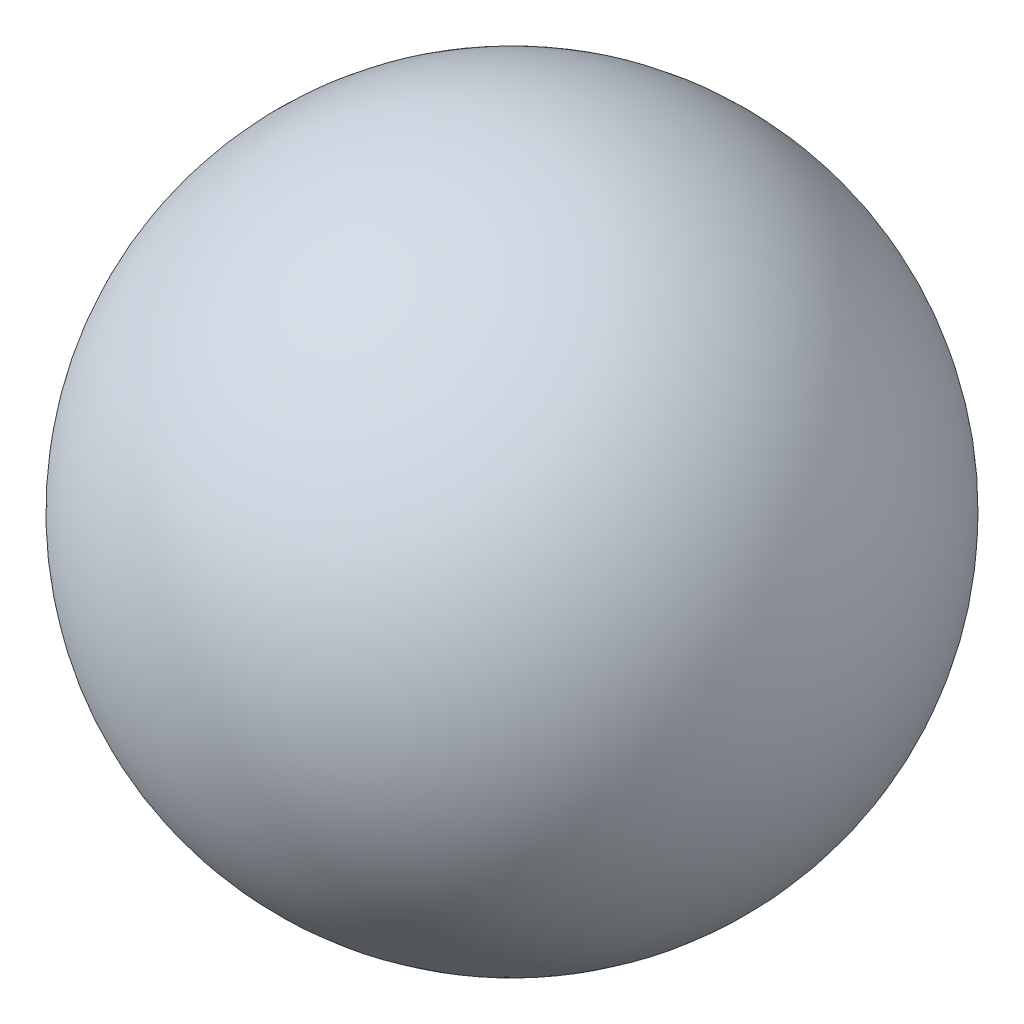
ISO-10303-21;
HEADER;
FILE_DESCRIPTION(('STEP AP214'),'2;1');
FILE_NAME('part.step','',(''),(''),'','','');
FILE_SCHEMA(('AUTOMOTIVE_DESIGN { 1 0 10303 214 1 1 1 1 }'));
ENDSEC;
DATA;
#1=APPLICATION_CONTEXT('core data for automotive mechanical design processes');
#2=APPLICATION_PROTOCOL_DEFINITION('international standard','automotive_design',2000,#1);
#3=PRODUCT_CONTEXT('',#1,'mechanical');
#4=PRODUCT('Part','Part','',(#3));
#5=PRODUCT_RELATED_PRODUCT_CATEGORY('part','',(#4));
#6=PRODUCT_DEFINITION_FORMATION('','',#4);
#7=PRODUCT_DEFINITION_CONTEXT('part definition',#1,'design');
#8=PRODUCT_DEFINITION('design','',#6,#7);
#9=PRODUCT_DEFINITION_SHAPE('','',#8);
#10=(LENGTH_UNIT() NAMED_UNIT(*) SI_UNIT(.MILLI.,.METRE.));
#11=(NAMED_UNIT(*) PLANE_ANGLE_UNIT() SI_UNIT($,.RADIAN.));
#12=(NAMED_UNIT(*) SI_UNIT($,.STERADIAN.) SOLID_ANGLE_UNIT());
#13=UNCERTAINTY_MEASURE_WITH_UNIT(LENGTH_MEASURE(1.E-05),#10,'distance_accuracy_value','');
#14=(GEOMETRIC_REPRESENTATION_CONTEXT(3) GLOBAL_UNCERTAINTY_ASSIGNED_CONTEXT((#13)) GLOBAL_UNIT_ASSIGNED_CONTEXT((#10,
#11,#12)) REPRESENTATION_CONTEXT('',''));
#15=CARTESIAN_POINT('',(0.,0.,0.));
#16=DIRECTION('',(0.,0.,1.));
#17=DIRECTION('',(1.,0.,0.));
#18=AXIS2_PLACEMENT_3D('',#15,#16,#17);
#19=CARTESIAN_POINT('',(0.304790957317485,0.0254,-0.0296450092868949));
#20=CARTESIAN_POINT('',(0.304790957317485,0.,-0.0296450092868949));
#21=CARTESIAN_POINT('',(0.305886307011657,0.0254,-0.0298879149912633));
#22=CARTESIAN_POINT('',(0.305886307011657,0.,-0.0298879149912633));
#23=CARTESIAN_POINT('',(0.306981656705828,0.0254,-0.0301308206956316));
#24=CARTESIAN_POINT('',(0.306981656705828,0.,-0.0301308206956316));
#25=CARTESIAN_POINT('',(0.3080770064,0.0254,-0.0303737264));
#26=CARTESIAN_POINT('',(0.3080770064,0.,-0.0303737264));
#27=CARTESIAN_POINT('',(0.324538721,0.0254,-0.0340242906));
#28=CARTESIAN_POINT('',(0.324538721,0.,-0.0340242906));
#29=CARTESIAN_POINT('',(0.3565306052,0.0254,-0.0411188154));
#30=CARTESIAN_POINT('',(0.3565306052,0.,-0.0411188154));
#31=CARTESIAN_POINT('',(0.4024776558,0.0254,-0.054290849));
#32=CARTESIAN_POINT('',(0.4024776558,0.,-0.054290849));
#33=CARTESIAN_POINT('',(0.4450542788,0.0254,-0.0692850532));
#34=CARTESIAN_POINT('',(0.4450542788,0.,-0.0692850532));
#35=CARTESIAN_POINT('',(0.4847328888,0.0254,-0.0852943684));
#36=CARTESIAN_POINT('',(0.4847328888,0.,-0.0852943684));
#37=CARTESIAN_POINT('',(0.5212805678,0.0254,-0.1030362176));
#38=CARTESIAN_POINT('',(0.5212805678,0.,-0.1030362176));
#39=CARTESIAN_POINT('',(0.5545556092,0.0254,-0.122564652));
#40=CARTESIAN_POINT('',(0.5545556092,0.,-0.122564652));
#41=CARTESIAN_POINT('',(0.5844827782,0.0254,-0.1438307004));
#42=CARTESIAN_POINT('',(0.5844827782,0.,-0.1438307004));
#43=CARTESIAN_POINT('',(0.6024801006,0.0254,-0.1594665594));
#44=CARTESIAN_POINT('',(0.6024801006,0.,-0.1594665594));
#45=CARTESIAN_POINT('',(0.6112812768,0.0254,-0.1671129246));
#46=CARTESIAN_POINT('',(0.6112812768,0.,-0.1671129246));
#47=B_SPLINE_SURFACE_WITH_KNOTS('',3,1,((#19,#20),(#21,#22),(#23,#24),(#25,#26),(#27,#28),(#29,
#30),(#31,#32),(#33,#34),(#35,#36),(#37,#38),(#39,#40),(#41,#42),(#43,#44),(#45,#46)),
.UNSPECIFIED.,.F.,.F.,.F.,(4,3,1,1,1,1,1,1,1,4),(2,2),(-0.01,0.,0.150287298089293,
0.292070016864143,0.425760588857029,0.55253095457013,0.673299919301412,0.787565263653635,
0.896113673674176,1.),(0.,1.),.UNSPECIFIED.);
#48=CARTESIAN_POINT('',(0.611281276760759,0.0254,-0.167112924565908));
#49=CARTESIAN_POINT('',(0.60807856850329,0.0254,-0.164331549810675));
#50=CARTESIAN_POINT('',(0.604876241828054,0.0254,-0.161548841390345));
#51=CARTESIAN_POINT('',(0.598434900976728,0.0254,-0.156022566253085));
#52=CARTESIAN_POINT('',(0.59519586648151,0.0254,-0.153279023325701));
#53=CARTESIAN_POINT('',(0.588657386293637,0.0254,-0.147884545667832));
#54=CARTESIAN_POINT('',(0.585358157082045,0.0254,-0.14523335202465));
#55=CARTESIAN_POINT('',(0.578669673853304,0.0254,-0.140050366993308));
#56=CARTESIAN_POINT('',(0.575280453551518,0.0254,-0.137518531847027));
#57=CARTESIAN_POINT('',(0.549899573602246,0.0254,-0.119182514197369));
#58=CARTESIAN_POINT('',(0.526298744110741,0.0254,-0.105547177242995));
#59=CARTESIAN_POINT('',(0.489625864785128,0.0254,-0.0878406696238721));
#60=CARTESIAN_POINT('',(0.477154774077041,0.0254,-0.0823854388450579));
#61=CARTESIAN_POINT('',(0.451945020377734,0.0254,-0.0721288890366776));
#62=CARTESIAN_POINT('',(0.439206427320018,0.0254,-0.0673274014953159));
#63=CARTESIAN_POINT('',(0.416650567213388,0.0254,-0.0593850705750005));
#64=CARTESIAN_POINT('',(0.406874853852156,0.0254,-0.0561240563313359));
#65=CARTESIAN_POINT('',(0.387223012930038,0.0254,-0.0500019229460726));
#66=CARTESIAN_POINT('',(0.377347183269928,0.0254,-0.0471398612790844));
#67=CARTESIAN_POINT('',(0.357610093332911,0.0254,-0.0418505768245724));
#68=CARTESIAN_POINT('',(0.347750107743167,0.0254,-0.0394185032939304));
#69=CARTESIAN_POINT('',(0.327953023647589,0.0254,-0.0347726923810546));
#70=CARTESIAN_POINT('',(0.31801579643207,0.0254,-0.0325594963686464));
#71=CARTESIAN_POINT('',(0.308077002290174,0.0254,-0.0303737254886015));
#72=B_SPLINE_CURVE_WITH_KNOTS('',3,(#48,#49,#50,#51,#52,#53,#54,#55,#56,#57,#58,#59,#60,#61,#62,
#63,#64,#65,#66,#67,#68,#69,#70,#71),.UNSPECIFIED.,.F.,.F.,(4,2,2,2,2,2,2,2,2,2,2,4),(0.,
0.012726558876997,0.0254605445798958,0.0381553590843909,0.0508454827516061,0.132072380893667,
0.172903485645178,0.213724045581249,0.244634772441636,0.27547118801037,0.305933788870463,
0.336469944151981),.UNSPECIFIED.);
#73=CARTESIAN_POINT('',(0.6112812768,0.0254,-0.1671129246));
#74=VERTEX_POINT('',#73);
#75=CARTESIAN_POINT('',(0.308077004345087,0.0254,-0.0303737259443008));
#76=VERTEX_POINT('',#75);
#77=EDGE_CURVE('E213',#74,#76,#72,.T.);
#78=DIRECTION('',(0.,1.,0.));
#79=VECTOR('',#78,1.);
#80=CARTESIAN_POINT('',(0.6112812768,0.0127,-0.1671129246));
#81=LINE('',#80,#79);
#82=CARTESIAN_POINT('',(0.611281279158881,0.,-0.167112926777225));
#83=VERTEX_POINT('',#82);
#84=EDGE_CURVE('E253',#83,#74,#81,.T.);
#85=CARTESIAN_POINT('',(0.611281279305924,0.,-0.167112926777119));
#86=CARTESIAN_POINT('',(0.608078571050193,0.,-0.164331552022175));
#87=CARTESIAN_POINT('',(0.604876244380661,0.,-0.161548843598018));
#88=CARTESIAN_POINT('',(0.598434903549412,0.,-0.156022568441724));
#89=CARTESIAN_POINT('',(0.595195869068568,0.,-0.15327902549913));
#90=CARTESIAN_POINT('',(0.588657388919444,0.,-0.147884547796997));
#91=CARTESIAN_POINT('',(0.58535815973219,0.,-0.145233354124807));
#92=CARTESIAN_POINT('',(0.578669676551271,0.,-0.14005036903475));
#93=CARTESIAN_POINT('',(0.575280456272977,0.,-0.137518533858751));
#94=CARTESIAN_POINT('',(0.54989957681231,0.,-0.119182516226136));
#95=CARTESIAN_POINT('',(0.526298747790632,0.,-0.105547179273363));
#96=CARTESIAN_POINT('',(0.489625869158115,0.,-0.0878406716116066));
#97=CARTESIAN_POINT('',(0.4771547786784,0.,-0.082385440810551));
#98=CARTESIAN_POINT('',(0.451945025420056,0.,-0.0721288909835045));
#99=CARTESIAN_POINT('',(0.439206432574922,0.,-0.0673274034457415));
#100=CARTESIAN_POINT('',(0.416650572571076,0.,-0.0593850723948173));
#101=CARTESIAN_POINT('',(0.406874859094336,0.,-0.0561240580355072));
#102=CARTESIAN_POINT('',(0.387223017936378,0.,-0.0500019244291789));
#103=CARTESIAN_POINT('',(0.377347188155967,0.,-0.0471398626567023));
#104=CARTESIAN_POINT('',(0.357610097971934,0.,-0.0418505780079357));
#105=CARTESIAN_POINT('',(0.347750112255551,0.,-0.039418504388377));
#106=CARTESIAN_POINT('',(0.327953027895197,0.,-0.0347726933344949));
#107=CARTESIAN_POINT('',(0.318015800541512,0.,-0.0325594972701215));
#108=CARTESIAN_POINT('',(0.308077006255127,0.,-0.0303737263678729));
#109=B_SPLINE_CURVE_WITH_KNOTS('',3,(#85,#86,#87,#88,#89,#90,#91,#92,#93,#94,#95,#96,#97,#98,
#99,#100,#101,#102,#103,#104,#105,#106,#107,#108),.UNSPECIFIED.,.F.,.F.,(4,2,2,2,2,2,2,2,2,2,2,
4),(0.,0.0127265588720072,0.025460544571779,0.0381553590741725,0.0508454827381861,
0.132072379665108,0.172903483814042,0.213724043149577,0.244634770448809,0.275471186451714,
0.3059337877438,0.336469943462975),.UNSPECIFIED.);
#110=CARTESIAN_POINT('',(0.308077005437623,0.,-0.0303737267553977));
#111=VERTEX_POINT('',#110);
#112=EDGE_CURVE('E215',#83,#111,#109,.T.);
#113=DIRECTION('',(0.,-1.,0.));
#114=VECTOR('',#113,1.);
#115=CARTESIAN_POINT('',(0.3080770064,0.0127,-0.0303737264));
#116=LINE('',#115,#114);
#117=EDGE_CURVE('E210',#76,#111,#116,.T.);
#118=ORIENTED_EDGE('',*,*,#77,.F.);
#119=ORIENTED_EDGE('',*,*,#84,.F.);
#120=ORIENTED_EDGE('',*,*,#112,.T.);
#121=ORIENTED_EDGE('',*,*,#117,.F.);
#122=EDGE_LOOP('',(#118,#119,#120,#121));
#123=FACE_BOUND('',#122,.T.);
#124=ADVANCED_FACE('F16',(#123),#47,.T.);
#125=CARTESIAN_POINT('',(0.6418565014,0.0254,0.4112683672));
#126=CARTESIAN_POINT('',(0.6418565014,0.,0.4112683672));
#127=CARTESIAN_POINT('',(0.640988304,0.0254,0.3869664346));
#128=CARTESIAN_POINT('',(0.640988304,0.,0.3869664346));
#129=CARTESIAN_POINT('',(0.63927736,0.0254,0.3390747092));
#130=CARTESIAN_POINT('',(0.63927736,0.,0.3390747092));
#131=CARTESIAN_POINT('',(0.6223582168,0.0254,0.2695822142));
#132=CARTESIAN_POINT('',(0.6223582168,0.,0.2695822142));
#133=CARTESIAN_POINT('',(0.5956666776,0.0254,0.204017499));
#134=CARTESIAN_POINT('',(0.5956666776,0.,0.204017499));
#135=CARTESIAN_POINT('',(0.5651128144,0.0254,0.1529929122));
#136=CARTESIAN_POINT('',(0.5651128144,0.,0.1529929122));
#137=CARTESIAN_POINT('',(0.5351101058,0.0254,0.1154496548));
#138=CARTESIAN_POINT('',(0.5351101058,0.,0.1154496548));
#139=CARTESIAN_POINT('',(0.5105564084,0.0254,0.0883085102));
#140=CARTESIAN_POINT('',(0.5105564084,0.,0.0883085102));
#141=CARTESIAN_POINT('',(0.482805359,0.0254,0.063927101));
#142=CARTESIAN_POINT('',(0.482805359,0.,0.063927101));
#143=CARTESIAN_POINT('',(0.4528105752,0.0254,0.0410627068));
#144=CARTESIAN_POINT('',(0.4528105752,0.,0.0410627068));
#145=CARTESIAN_POINT('',(0.4200866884,0.0254,0.0205417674));
#146=CARTESIAN_POINT('',(0.4200866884,0.,0.0205417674));
#147=CARTESIAN_POINT('',(0.3852203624,0.0254,0.0012094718));
#148=CARTESIAN_POINT('',(0.3852203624,0.,0.0012094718));
#149=CARTESIAN_POINT('',(0.347651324,0.0254,-0.0157592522));
#150=CARTESIAN_POINT('',(0.347651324,0.,-0.0157592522));
#151=CARTESIAN_POINT('',(0.3214452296,0.0254,-0.025436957));
#152=CARTESIAN_POINT('',(0.3214452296,0.,-0.025436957));
#153=CARTESIAN_POINT('',(0.3080770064,0.0254,-0.0303737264));
#154=CARTESIAN_POINT('',(0.3080770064,0.,-0.0303737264));
#155=B_SPLINE_SURFACE_WITH_KNOTS('',3,1,((#125,#126),(#127,#128),(#129,#130),(#131,#132),(#133,
#134),(#135,#136),(#137,#138),(#139,#140),(#141,#142),(#143,#144),(#145,#146),(#147,#148),(#149,
#150),(#151,#152),(#153,#154)),.UNSPECIFIED.,.F.,.F.,.F.,(4,1,1,1,1,1,1,1,1,1,1,1,4),(2,2),(0.,
0.1225902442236,0.241588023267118,0.358984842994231,0.47930119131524,0.540394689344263,
0.601634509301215,0.663934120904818,0.726724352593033,0.791994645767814,0.858886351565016,
0.928015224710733,1.),(0.,1.),.UNSPECIFIED.);
#156=CARTESIAN_POINT('',(0.308077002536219,0.0254,-0.0303737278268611));
#157=CARTESIAN_POINT('',(0.316002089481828,0.0254,-0.0274602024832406));
#158=CARTESIAN_POINT('',(0.323925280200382,0.0254,-0.0245274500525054));
#159=CARTESIAN_POINT('',(0.339735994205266,0.0254,-0.0184477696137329));
#160=CARTESIAN_POINT('',(0.347623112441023,0.0254,-0.0152997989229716));
#161=CARTESIAN_POINT('',(0.362727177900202,0.0254,-0.008861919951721));
#162=CARTESIAN_POINT('',(0.369953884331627,0.0254,-0.00559526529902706));
#163=CARTESIAN_POINT('',(0.384245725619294,0.0254,0.00127432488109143));
#164=CARTESIAN_POINT('',(0.391310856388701,0.0254,0.00487726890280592));
#165=CARTESIAN_POINT('',(0.405279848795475,0.0254,0.0123916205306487));
#166=CARTESIAN_POINT('',(0.412183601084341,0.0254,0.0163032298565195));
#167=CARTESIAN_POINT('',(0.425867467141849,0.0254,0.0243479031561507));
#168=CARTESIAN_POINT('',(0.432647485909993,0.0254,0.0284811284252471));
#169=CARTESIAN_POINT('',(0.445983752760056,0.0254,0.0370548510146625));
#170=CARTESIAN_POINT('',(0.452540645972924,0.0254,0.041494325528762));
#171=CARTESIAN_POINT('',(0.465390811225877,0.0254,0.0507397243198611));
#172=CARTESIAN_POINT('',(0.471683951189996,0.0254,0.0555458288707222));
#173=CARTESIAN_POINT('',(0.490226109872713,0.0254,0.0703584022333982));
#174=CARTESIAN_POINT('',(0.502165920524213,0.0254,0.0807777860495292));
#175=CARTESIAN_POINT('',(0.517694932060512,0.0254,0.0964866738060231));
#176=CARTESIAN_POINT('',(0.521983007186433,0.0254,0.101086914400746));
#177=CARTESIAN_POINT('',(0.530375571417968,0.0254,0.110452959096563));
#178=CARTESIAN_POINT('',(0.534479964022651,0.0254,0.115218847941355));
#179=CARTESIAN_POINT('',(0.546550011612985,0.0254,0.129725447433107));
#180=CARTESIAN_POINT('',(0.554272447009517,0.0254,0.139674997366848));
#181=CARTESIAN_POINT('',(0.568738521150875,0.0254,0.160290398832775));
#182=CARTESIAN_POINT('',(0.57548042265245,0.0254,0.170957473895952));
#183=CARTESIAN_POINT('',(0.588031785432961,0.0254,0.192820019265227));
#184=CARTESIAN_POINT('',(0.5938413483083,0.0254,0.204015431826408));
#185=CARTESIAN_POINT('',(0.604524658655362,0.0254,0.226838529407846));
#186=CARTESIAN_POINT('',(0.609398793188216,0.0254,0.238466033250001));
#187=CARTESIAN_POINT('',(0.618210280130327,0.0254,0.262070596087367));
#188=CARTESIAN_POINT('',(0.62214755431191,0.0254,0.274047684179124));
#189=CARTESIAN_POINT('',(0.629000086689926,0.0254,0.298286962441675));
#190=CARTESIAN_POINT('',(0.631916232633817,0.0254,0.310548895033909));
#191=CARTESIAN_POINT('',(0.635346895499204,0.0254,0.329111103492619));
#192=CARTESIAN_POINT('',(0.636333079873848,0.0254,0.335325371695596));
#193=CARTESIAN_POINT('',(0.637977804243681,0.0254,0.347797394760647));
#194=CARTESIAN_POINT('',(0.638636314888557,0.0254,0.354055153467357));
#195=CARTESIAN_POINT('',(0.63991043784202,0.0254,0.368801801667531));
#196=CARTESIAN_POINT('',(0.640428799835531,0.0254,0.377298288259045));
#197=CARTESIAN_POINT('',(0.641250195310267,0.0254,0.394287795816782));
#198=CARTESIAN_POINT('',(0.64155360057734,0.0254,0.402780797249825));
#199=CARTESIAN_POINT('',(0.641856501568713,0.0254,0.411268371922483));
#200=B_SPLINE_CURVE_WITH_KNOTS('',3,(#156,#157,#158,#159,#160,#161,#162,#163,#164,#165,#166,
#167,#168,#169,#170,#171,#172,#173,#174,#175,#176,#177,#178,#179,#180,#181,#182,#183,#184,#185,
#186,#187,#188,#189,#190,#191,#192,#193,#194,#195,#196,#197,#198,#199),.UNSPECIFIED.,.F.,.F.,(4,
2,2,2,2,2,2,2,2,2,2,2,2,2,2,2,2,2,2,2,2,4),(0.,0.0253392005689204,0.0508113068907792,
0.0745943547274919,0.0983780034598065,0.122177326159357,0.145994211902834,0.169735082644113,
0.193487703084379,0.240892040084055,0.25974986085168,0.278617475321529,0.316353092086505,
0.354154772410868,0.391952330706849,0.429734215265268,0.467519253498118,0.505271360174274,
0.524139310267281,0.543008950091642,0.568541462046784,0.594029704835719),.UNSPECIFIED.);
#201=CARTESIAN_POINT('',(0.641856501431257,0.0254,0.411268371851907));
#202=VERTEX_POINT('',#201);
#203=EDGE_CURVE('E21',#76,#202,#200,.T.);
#204=CARTESIAN_POINT('',(0.308077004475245,0.,-0.0303737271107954));
#205=CARTESIAN_POINT('',(0.316002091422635,0.,-0.0274602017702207));
#206=CARTESIAN_POINT('',(0.323925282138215,0.,-0.0245274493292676));
#207=CARTESIAN_POINT('',(0.33973599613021,0.,-0.0184477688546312));
#208=CARTESIAN_POINT('',(0.347623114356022,0.,-0.0152997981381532));
#209=CARTESIAN_POINT('',(0.36272717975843,0.,-0.00886191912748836));
#210=CARTESIAN_POINT('',(0.369953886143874,0.,-0.00559526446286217));
#211=CARTESIAN_POINT('',(0.384245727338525,0.,0.00127432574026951));
#212=CARTESIAN_POINT('',(0.391310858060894,0.,0.00487726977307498));
#213=CARTESIAN_POINT('',(0.405279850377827,0.,0.0123916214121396));
#214=CARTESIAN_POINT('',(0.412183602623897,0.,0.0163032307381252));
#215=CARTESIAN_POINT('',(0.425867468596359,0.,0.024347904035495));
#216=CARTESIAN_POINT('',(0.432647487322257,0.,0.028481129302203));
#217=CARTESIAN_POINT('',(0.445983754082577,0.,0.037054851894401));
#218=CARTESIAN_POINT('',(0.452540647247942,0.,0.0414943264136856));
#219=CARTESIAN_POINT('',(0.465390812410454,0.,0.0507397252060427));
#220=CARTESIAN_POINT('',(0.471683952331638,0.,0.0555458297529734));
#221=CARTESIAN_POINT('',(0.490226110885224,0.,0.0703584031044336));
#222=CARTESIAN_POINT('',(0.502165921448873,0.,0.0807777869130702));
#223=CARTESIAN_POINT('',(0.517694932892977,0.,0.0964866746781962));
#224=CARTESIAN_POINT('',(0.52198300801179,0.,0.101086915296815));
#225=CARTESIAN_POINT('',(0.530375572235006,0.,0.110452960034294));
#226=CARTESIAN_POINT('',(0.534479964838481,0.,0.115218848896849));
#227=CARTESIAN_POINT('',(0.546550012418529,0.,0.129725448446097));
#228=CARTESIAN_POINT('',(0.554272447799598,0.,0.139674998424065));
#229=CARTESIAN_POINT('',(0.568738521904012,0.,0.160290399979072));
#230=CARTESIAN_POINT('',(0.575480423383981,0.,0.17095747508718));
#231=CARTESIAN_POINT('',(0.588031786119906,0.,0.192820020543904));
#232=CARTESIAN_POINT('',(0.593841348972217,0.,0.204015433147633));
#233=CARTESIAN_POINT('',(0.60452465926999,0.,0.226838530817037));
#234=CARTESIAN_POINT('',(0.609398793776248,0.,0.238466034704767));
#235=CARTESIAN_POINT('',(0.618210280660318,0.,0.262070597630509));
#236=CARTESIAN_POINT('',(0.622147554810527,0.,0.274047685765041));
#237=CARTESIAN_POINT('',(0.629000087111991,0.,0.298286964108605));
#238=CARTESIAN_POINT('',(0.631916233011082,0.,0.310548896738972));
#239=CARTESIAN_POINT('',(0.635346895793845,0.,0.329111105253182));
#240=CARTESIAN_POINT('',(0.6363330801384,0.,0.335325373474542));
#241=CARTESIAN_POINT('',(0.637977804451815,0.,0.347797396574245));
#242=CARTESIAN_POINT('',(0.638636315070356,0.,0.354055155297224));
#243=CARTESIAN_POINT('',(0.639910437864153,0.,0.368801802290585));
#244=CARTESIAN_POINT('',(0.640428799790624,0.,0.377298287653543));
#245=CARTESIAN_POINT('',(0.64125019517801,0.,0.394287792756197));
#246=CARTESIAN_POINT('',(0.641553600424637,0.,0.402780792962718));
#247=CARTESIAN_POINT('',(0.641856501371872,0.,0.411268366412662));
#248=B_SPLINE_CURVE_WITH_KNOTS('',3,(#204,#205,#206,#207,#208,#209,#210,#211,#212,#213,#214,
#215,#216,#217,#218,#219,#220,#221,#222,#223,#224,#225,#226,#227,#228,#229,#230,#231,#232,#233,
#234,#235,#236,#237,#238,#239,#240,#241,#242,#243,#244,#245,#246,#247),.UNSPECIFIED.,.F.,.F.,(4,
2,2,2,2,2,2,2,2,2,2,2,2,2,2,2,2,2,2,2,2,4),(0.,0.0253392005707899,0.0508113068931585,
0.0745943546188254,0.098378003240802,0.122177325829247,0.145994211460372,0.169735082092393,
0.193487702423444,0.240892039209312,0.259749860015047,0.278617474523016,0.316353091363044,
0.35415477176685,0.391952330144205,0.42973421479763,0.467519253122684,0.505271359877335,
0.524139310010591,0.543008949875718,0.568541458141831,0.594029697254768),.UNSPECIFIED.);
#249=CARTESIAN_POINT('',(0.641856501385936,0.,0.411268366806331));
#250=VERTEX_POINT('',#249);
#251=EDGE_CURVE('E232',#111,#250,#248,.T.);
#252=DIRECTION('',(0.,-1.,0.));
#253=VECTOR('',#252,1.);
#254=CARTESIAN_POINT('',(0.6418565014,0.0127,0.4112683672));
#255=LINE('',#254,#253);
#256=EDGE_CURVE('E231',#202,#250,#255,.T.);
#257=ORIENTED_EDGE('',*,*,#203,.F.);
#258=ORIENTED_EDGE('',*,*,#117,.T.);
#259=ORIENTED_EDGE('',*,*,#251,.T.);
#260=ORIENTED_EDGE('',*,*,#256,.F.);
#261=EDGE_LOOP('',(#257,#258,#259,#260));
#262=FACE_BOUND('',#261,.T.);
#263=ADVANCED_FACE('F230',(#262),#155,.T.);
#264=CARTESIAN_POINT('',(-0.9888220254,0.0254,0.9408142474));
#265=DIRECTION('',(0.,-1.,0.));
#266=DIRECTION('',(0.,0.,-1.));
#267=AXIS2_PLACEMENT_3D('',#264,#265,#266);
#268=PLANE('',#267);
#269=CARTESIAN_POINT('',(-0.44526250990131,0.0254,0.0379958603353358));
#270=CARTESIAN_POINT('',(-0.436922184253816,0.0254,0.0365335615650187));
#271=CARTESIAN_POINT('',(-0.428581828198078,0.0254,0.0350582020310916));
#272=CARTESIAN_POINT('',(-0.411885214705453,0.0254,0.0322233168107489));
#273=CARTESIAN_POINT('',(-0.403528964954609,0.0254,0.0308637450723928));
#274=CARTESIAN_POINT('',(-0.376893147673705,0.0254,0.0269476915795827));
#275=CARTESIAN_POINT('',(-0.358541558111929,0.0254,0.0248723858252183));
#276=CARTESIAN_POINT('',(-0.321759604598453,0.0254,0.0215524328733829));
#277=CARTESIAN_POINT('',(-0.303329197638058,0.0254,0.0203083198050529));
#278=CARTESIAN_POINT('',(-0.26632095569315,0.0254,0.0184487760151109));
#279=CARTESIAN_POINT('',(-0.247742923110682,0.0254,0.0178373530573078));
#280=CARTESIAN_POINT('',(-0.219882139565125,0.0254,0.017268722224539));
#281=CARTESIAN_POINT('',(-0.210601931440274,0.0254,0.017137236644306));
#282=CARTESIAN_POINT('',(-0.192042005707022,0.0254,0.016926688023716));
#283=CARTESIAN_POINT('',(-0.182762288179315,0.0254,0.016847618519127));
#284=CARTESIAN_POINT('',(-0.173482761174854,0.0254,0.0167630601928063));
#285=B_SPLINE_CURVE_WITH_KNOTS('',3,(#269,#270,#271,#272,#273,#274,#275,#276,#277,#278,#279,
#280,#281,#282,#283,#284),.UNSPECIFIED.,.F.,.F.,(4,2,2,2,2,2,2,4),(0.,0.0254067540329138,
0.0508033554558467,0.106173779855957,0.161579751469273,0.217334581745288,0.245177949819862,
0.273017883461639),.UNSPECIFIED.);
#286=CARTESIAN_POINT('',(-0.445262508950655,0.0254,0.0379958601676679));
#287=VERTEX_POINT('',#286);
#288=CARTESIAN_POINT('',(-0.173482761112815,0.0254,0.0167630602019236));
#289=VERTEX_POINT('',#288);
#290=EDGE_CURVE('E440',#287,#289,#285,.T.);
#291=ORIENTED_EDGE('',*,*,#290,.F.);
#292=DIRECTION('',(0.,0.,-1.));
#293=VECTOR('',#292,1.);
#294=CARTESIAN_POINT('',(-0.445262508,0.0254,0.4320765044));
#295=LINE('',#294,#293);
#296=CARTESIAN_POINT('',(-0.445262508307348,0.0254,0.826157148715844));
#297=VERTEX_POINT('',#296);
#298=EDGE_CURVE('E246',#297,#287,#295,.T.);
#299=ORIENTED_EDGE('',*,*,#298,.F.);
#300=CARTESIAN_POINT('',(-0.200660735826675,0.0254,0.859280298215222));
#301=CARTESIAN_POINT('',(-0.209121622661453,0.0254,0.859108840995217));
#302=CARTESIAN_POINT('',(-0.217583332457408,0.0254,0.85894474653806));
#303=CARTESIAN_POINT('',(-0.23451234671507,0.0254,0.858524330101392));
#304=CARTESIAN_POINT('',(-0.242979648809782,0.0254,0.858267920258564));
#305=CARTESIAN_POINT('',(-0.267715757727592,0.0254,0.857227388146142));
#306=CARTESIAN_POINT('',(-0.283975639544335,0.0254,0.856174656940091));
#307=CARTESIAN_POINT('',(-0.316392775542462,0.0254,0.853067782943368));
#308=CARTESIAN_POINT('',(-0.332550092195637,0.0254,0.851014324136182));
#309=CARTESIAN_POINT('',(-0.356773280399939,0.0254,0.847100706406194));
#310=CARTESIAN_POINT('',(-0.364905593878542,0.0254,0.845643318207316));
#311=CARTESIAN_POINT('',(-0.38111016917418,0.0254,0.84241641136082));
#312=CARTESIAN_POINT('',(-0.389182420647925,0.0254,0.840646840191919));
#313=CARTESIAN_POINT('',(-0.405275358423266,0.0254,0.836823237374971));
#314=CARTESIAN_POINT('',(-0.413295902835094,0.0254,0.834768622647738));
#315=CARTESIAN_POINT('',(-0.429298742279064,0.0254,0.830526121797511));
#316=CARTESIAN_POINT('',(-0.437281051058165,0.0254,0.828338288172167));
#317=CARTESIAN_POINT('',(-0.445262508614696,0.0254,0.826157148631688));
#318=B_SPLINE_CURVE_WITH_KNOTS('',3,(#300,#301,#302,#303,#304,#305,#306,#307,#308,#309,#310,
#311,#312,#313,#314,#315,#316,#317),.UNSPECIFIED.,.F.,.F.,(4,2,2,2,2,2,2,2,4),(0.,
0.025388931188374,0.0508020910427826,0.0996591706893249,0.14848290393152,0.173263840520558,
0.198048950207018,0.222885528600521,0.247712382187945),.UNSPECIFIED.);
#319=CARTESIAN_POINT('',(-0.200660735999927,0.0254,0.859280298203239));
#320=VERTEX_POINT('',#319);
#321=EDGE_CURVE('E385',#320,#297,#318,.T.);
#322=ORIENTED_EDGE('',*,*,#321,.F.);
#323=CARTESIAN_POINT('',(0.315720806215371,0.0254,0.424857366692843));
#324=CARTESIAN_POINT('',(0.315479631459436,0.0254,0.433307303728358));
#325=CARTESIAN_POINT('',(0.3152157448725,0.0254,0.441764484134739));
#326=CARTESIAN_POINT('',(0.314391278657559,0.0254,0.458688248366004));
#327=CARTESIAN_POINT('',(0.31382981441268,0.0254,0.46715478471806));
#328=CARTESIAN_POINT('',(0.311888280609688,0.0254,0.48675821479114));
#329=CARTESIAN_POINT('',(0.310302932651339,0.0254,0.497877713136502));
#330=CARTESIAN_POINT('',(0.306025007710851,0.0254,0.519910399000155));
#331=CARTESIAN_POINT('',(0.303331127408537,0.0254,0.530823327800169));
#332=CARTESIAN_POINT('',(0.297147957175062,0.0254,0.552402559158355));
#333=CARTESIAN_POINT('',(0.293659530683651,0.0254,0.563069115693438));
#334=CARTESIAN_POINT('',(0.285887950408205,0.0254,0.584104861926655));
#335=CARTESIAN_POINT('',(0.281605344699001,0.0254,0.594474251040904));
#336=CARTESIAN_POINT('',(0.272129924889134,0.0254,0.614792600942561));
#337=CARTESIAN_POINT('',(0.266937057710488,0.0254,0.624741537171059));
#338=CARTESIAN_POINT('',(0.255670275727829,0.0254,0.644127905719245));
#339=CARTESIAN_POINT('',(0.249596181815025,0.0254,0.653565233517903));
#340=CARTESIAN_POINT('',(0.236701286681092,0.0254,0.671931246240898));
#341=CARTESIAN_POINT('',(0.229879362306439,0.0254,0.680859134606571));
#342=CARTESIAN_POINT('',(0.215646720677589,0.0254,0.698235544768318));
#343=CARTESIAN_POINT('',(0.208235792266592,0.0254,0.706683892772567));
#344=CARTESIAN_POINT('',(0.192375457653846,0.0254,0.723526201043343));
#345=CARTESIAN_POINT('',(0.183890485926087,0.0254,0.731886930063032));
#346=CARTESIAN_POINT('',(0.166229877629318,0.0254,0.74783918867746));
#347=CARTESIAN_POINT('',(0.157054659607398,0.0254,0.755431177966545));
#348=CARTESIAN_POINT('',(0.138067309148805,0.0254,0.769705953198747));
#349=CARTESIAN_POINT('',(0.128257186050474,0.0254,0.776391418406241));
#350=CARTESIAN_POINT('',(0.108114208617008,0.0254,0.788926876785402));
#351=CARTESIAN_POINT('',(0.0977811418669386,0.0254,0.794776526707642));
#352=CARTESIAN_POINT('',(0.0768617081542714,0.0254,0.805507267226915));
#353=CARTESIAN_POINT('',(0.0662834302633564,0.0254,0.810404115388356));
#354=CARTESIAN_POINT('',(0.0447820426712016,0.0254,0.819358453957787));
#355=CARTESIAN_POINT('',(0.0338589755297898,0.0254,0.823416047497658));
#356=CARTESIAN_POINT('',(0.0117191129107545,0.0254,0.830825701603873));
#357=CARTESIAN_POINT('',(0.000501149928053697,0.0254,0.834174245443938));
#358=CARTESIAN_POINT('',(-0.022129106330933,0.0254,0.840132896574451));
#359=CARTESIAN_POINT('',(-0.0335414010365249,0.0254,0.842742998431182));
#360=CARTESIAN_POINT('',(-0.0578910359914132,0.0254,0.847569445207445));
#361=CARTESIAN_POINT('',(-0.0708451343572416,0.0254,0.849699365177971));
#362=CARTESIAN_POINT('',(-0.0968466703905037,0.0254,0.853311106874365));
#363=CARTESIAN_POINT('',(-0.10989413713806,0.0254,0.854792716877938));
#364=CARTESIAN_POINT('',(-0.129432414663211,0.0254,0.856476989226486));
#365=CARTESIAN_POINT('',(-0.135900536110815,0.0254,0.856947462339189));
#366=CARTESIAN_POINT('',(-0.148847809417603,0.0254,0.857717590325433));
#367=CARTESIAN_POINT('',(-0.155326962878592,0.0254,0.858017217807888));
#368=CARTESIAN_POINT('',(-0.168282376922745,0.0254,0.85850527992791));
#369=CARTESIAN_POINT('',(-0.174758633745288,0.0254,0.85869382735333));
#370=CARTESIAN_POINT('',(-0.187710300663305,0.0254,0.859015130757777));
#371=CARTESIAN_POINT('',(-0.194185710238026,0.0254,0.85914790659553));
#372=CARTESIAN_POINT('',(-0.200660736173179,0.0254,0.859280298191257));
#373=B_SPLINE_CURVE_WITH_KNOTS('',3,(#323,#324,#325,#326,#327,#328,#329,#330,#331,#332,#333,
#334,#335,#336,#337,#338,#339,#340,#341,#342,#343,#344,#345,#346,#347,#348,#349,#350,#351,#352,
#353,#354,#355,#356,#357,#358,#359,#360,#361,#362,#363,#364,#365,#366,#367,#368,#369,#370,#371,
#372),.UNSPECIFIED.,.F.,.F.,(4,2,2,2,2,2,2,2,2,2,2,2,2,2,2,2,2,2,2,2,2,2,2,2,4),(0.,
0.0253729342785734,0.0508217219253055,0.0844595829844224,0.118137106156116,0.151778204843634,
0.185396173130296,0.219016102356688,0.25264287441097,0.286320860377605,0.320010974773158,
0.355708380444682,0.391384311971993,0.426952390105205,0.46253503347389,0.497466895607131,
0.532394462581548,0.567491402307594,0.602588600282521,0.641951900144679,0.681328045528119,
0.700781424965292,0.72023792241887,0.739674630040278,0.759104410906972),.UNSPECIFIED.);
#374=CARTESIAN_POINT('',(0.315720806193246,0.0254,0.424857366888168));
#375=VERTEX_POINT('',#374);
#376=EDGE_CURVE('E379',#375,#320,#373,.T.);
#377=ORIENTED_EDGE('',*,*,#376,.F.);
#378=CARTESIAN_POINT('',(-0.173482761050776,0.0254,0.0167630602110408));
#379=CARTESIAN_POINT('',(-0.165029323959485,0.0254,0.016861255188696));
#380=CARTESIAN_POINT('',(-0.156575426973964,0.0254,0.0169596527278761));
#381=CARTESIAN_POINT('',(-0.139643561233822,0.0254,0.0172200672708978));
#382=CARTESIAN_POINT('',(-0.131165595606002,0.0254,0.0173822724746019));
#383=CARTESIAN_POINT('',(-0.114160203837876,0.0254,0.0178350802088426));
#384=CARTESIAN_POINT('',(-0.105632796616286,0.0254,0.0181264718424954));
#385=CARTESIAN_POINT('',(-0.0885858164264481,0.0254,0.0188955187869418));
#386=CARTESIAN_POINT('',(-0.0800662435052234,0.0254,0.0193731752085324));
#387=CARTESIAN_POINT('',(-0.0630382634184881,0.0254,0.0205632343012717));
#388=CARTESIAN_POINT('',(-0.0545298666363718,0.0254,0.0212757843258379));
#389=CARTESIAN_POINT('',(-0.0375275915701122,0.0254,0.0228481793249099));
#390=CARTESIAN_POINT('',(-0.0290337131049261,0.0254,0.0237080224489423));
#391=CARTESIAN_POINT('',(-0.0120804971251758,0.0254,0.0255904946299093));
#392=CARTESIAN_POINT('',(-0.00362112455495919,0.0254,0.0266127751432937));
#393=CARTESIAN_POINT('',(0.0132443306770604,0.0254,0.0290411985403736));
#394=CARTESIAN_POINT('',(0.0216504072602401,0.0254,0.0304473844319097));
#395=CARTESIAN_POINT('',(0.0384000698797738,0.0254,0.033522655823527));
#396=CARTESIAN_POINT('',(0.0467437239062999,0.0254,0.0351913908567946));
#397=CARTESIAN_POINT('',(0.0633872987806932,0.0254,0.0387438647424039));
#398=CARTESIAN_POINT('',(0.0716872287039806,0.0254,0.040627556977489));
#399=CARTESIAN_POINT('',(0.0878507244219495,0.0254,0.0448992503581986));
#400=CARTESIAN_POINT('',(0.095719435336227,0.0254,0.0472674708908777));
#401=CARTESIAN_POINT('',(0.111325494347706,0.0254,0.0524025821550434));
#402=CARTESIAN_POINT('',(0.119062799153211,0.0254,0.0551696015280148));
#403=CARTESIAN_POINT('',(0.134369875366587,0.0254,0.0611490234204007));
#404=CARTESIAN_POINT('',(0.14193960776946,0.0254,0.0643615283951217));
#405=CARTESIAN_POINT('',(0.156802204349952,0.0254,0.0713663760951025));
#406=CARTESIAN_POINT('',(0.164095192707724,0.0254,0.0751584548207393));
#407=CARTESIAN_POINT('',(0.183386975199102,0.0254,0.0862576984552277));
#408=CARTESIAN_POINT('',(0.195059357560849,0.0254,0.0941519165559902));
#409=CARTESIAN_POINT('',(0.216883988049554,0.0254,0.111758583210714));
#410=CARTESIAN_POINT('',(0.227041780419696,0.0254,0.121464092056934));
#411=CARTESIAN_POINT('',(0.245471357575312,0.0254,0.142603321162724));
#412=CARTESIAN_POINT('',(0.253736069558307,0.0254,0.154043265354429));
#413=CARTESIAN_POINT('',(0.26804002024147,0.0254,0.17829191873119));
#414=CARTESIAN_POINT('',(0.274069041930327,0.0254,0.191106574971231));
#415=CARTESIAN_POINT('',(0.281626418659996,0.0254,0.210598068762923));
#416=CARTESIAN_POINT('',(0.283869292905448,0.0254,0.217019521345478));
#417=CARTESIAN_POINT('',(0.28801102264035,0.0254,0.229974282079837));
#418=CARTESIAN_POINT('',(0.289909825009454,0.0254,0.236507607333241));
#419=CARTESIAN_POINT('',(0.293481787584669,0.0254,0.249644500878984));
#420=CARTESIAN_POINT('',(0.295154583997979,0.0254,0.256248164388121));
#421=CARTESIAN_POINT('',(0.298368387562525,0.0254,0.269486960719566));
#422=CARTESIAN_POINT('',(0.299909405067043,0.0254,0.276122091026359));
#423=CARTESIAN_POINT('',(0.302812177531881,0.0254,0.289455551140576));
#424=CARTESIAN_POINT('',(0.304173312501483,0.0254,0.29615401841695));
#425=CARTESIAN_POINT('',(0.306659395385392,0.0254,0.309593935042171));
#426=CARTESIAN_POINT('',(0.307784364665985,0.0254,0.31633538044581));
#427=CARTESIAN_POINT('',(0.310779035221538,0.0254,0.336593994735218));
#428=CARTESIAN_POINT('',(0.312273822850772,0.0254,0.350169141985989));
#429=CARTESIAN_POINT('',(0.314061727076,0.0254,0.373968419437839));
#430=CARTESIAN_POINT('',(0.314562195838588,0.0254,0.384179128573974));
#431=CARTESIAN_POINT('',(0.31528472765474,0.0254,0.404547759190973));
#432=CARTESIAN_POINT('',(0.315508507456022,0.0254,0.414705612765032));
#433=CARTESIAN_POINT('',(0.315720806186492,0.0254,0.424857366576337));
#434=B_SPLINE_CURVE_WITH_KNOTS('',3,(#378,#379,#380,#381,#382,#383,#384,#385,#386,#387,#388,
#389,#390,#391,#392,#393,#394,#395,#396,#397,#398,#399,#400,#401,#402,#403,#404,#405,#406,#407,
#408,#409,#410,#411,#412,#413,#414,#415,#416,#417,#418,#419,#420,#421,#422,#423,#424,#425,#426,
#427,#428,#429,#430,#431,#432,#433),.UNSPECIFIED.,.F.,.F.,(4,2,2,2,2,2,2,2,2,2,2,2,2,2,2,2,2,2,
2,2,2,2,2,2,2,2,2,4),(0.,0.0253628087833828,0.0508009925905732,0.0763967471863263,
0.101992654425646,0.127604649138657,0.153216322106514,0.178773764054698,0.204334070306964,
0.229860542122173,0.255381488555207,0.280016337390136,0.304659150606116,0.32930764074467,
0.353944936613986,0.396035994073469,0.437968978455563,0.480056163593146,0.522333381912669,
0.542732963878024,0.563135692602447,0.58357088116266,0.604004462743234,0.62450673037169,
0.645007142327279,0.685935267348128,0.716598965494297,0.74707143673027),.UNSPECIFIED.);
#435=EDGE_CURVE('E228',#289,#375,#434,.T.);
#436=ORIENTED_EDGE('',*,*,#435,.F.);
#437=EDGE_LOOP('',(#291,#299,#322,#377,#436));
#438=FACE_BOUND('',#437,.T.);
#439=CARTESIAN_POINT('',(-0.445262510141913,0.0254,-0.894973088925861));
#440=CARTESIAN_POINT('',(-0.436996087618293,0.0254,-0.896799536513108));
#441=CARTESIAN_POINT('',(-0.42873075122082,0.0254,-0.898630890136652));
#442=CARTESIAN_POINT('',(-0.412186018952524,0.0254,-0.902238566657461));
#443=CARTESIAN_POINT('',(-0.403906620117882,0.0254,-0.904014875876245));
#444=CARTESIAN_POINT('',(-0.379015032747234,0.0254,-0.909165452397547));
#445=CARTESIAN_POINT('',(-0.362363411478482,0.0254,-0.912358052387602));
#446=CARTESIAN_POINT('',(-0.328933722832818,0.0254,-0.917980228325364));
#447=CARTESIAN_POINT('',(-0.312155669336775,0.0254,-0.920409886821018));
#448=CARTESIAN_POINT('',(-0.280275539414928,0.0254,-0.924502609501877));
#449=CARTESIAN_POINT('',(-0.265180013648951,0.0254,-0.926219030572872));
#450=CARTESIAN_POINT('',(-0.234939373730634,0.0254,-0.929188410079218));
#451=CARTESIAN_POINT('',(-0.219794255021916,0.0254,-0.930441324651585));
#452=CARTESIAN_POINT('',(-0.189407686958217,0.0254,-0.93233101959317));
#453=CARTESIAN_POINT('',(-0.174166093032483,0.0254,-0.932965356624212));
#454=CARTESIAN_POINT('',(-0.143674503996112,0.0254,-0.933896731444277));
#455=CARTESIAN_POINT('',(-0.12842451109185,0.0254,-0.93419383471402));
#456=CARTESIAN_POINT('',(-0.113181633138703,0.0254,-0.934466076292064));
#457=B_SPLINE_CURVE_WITH_KNOTS('',3,(#439,#440,#441,#442,#443,#444,#445,#446,#447,#448,#449,
#450,#451,#452,#453,#454,#455,#456),.UNSPECIFIED.,.F.,.F.,(4,2,2,2,2,2,2,2,4),(0.,
0.0253972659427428,0.050800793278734,0.101650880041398,0.152495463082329,0.198069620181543,
0.243648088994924,0.289405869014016,0.335154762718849),.UNSPECIFIED.);
#458=CARTESIAN_POINT('',(-0.445262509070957,0.0254,-0.894973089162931));
#459=VERTEX_POINT('',#458);
#460=CARTESIAN_POINT('',(-0.113181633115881,0.0254,-0.934466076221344));
#461=VERTEX_POINT('',#460);
#462=EDGE_CURVE('E392',#459,#461,#457,.T.);
#463=ORIENTED_EDGE('',*,*,#462,.F.);
#464=DIRECTION('',(0.,0.,-1.));
#465=VECTOR('',#464,1.);
#466=CARTESIAN_POINT('',(-0.445262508,0.0254,-0.4864541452));
#467=LINE('',#466,#465);
#468=CARTESIAN_POINT('',(-0.445262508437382,0.0254,-0.0779352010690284));
#469=VERTEX_POINT('',#468);
#470=EDGE_CURVE('E250',#469,#459,#467,.T.);
#471=ORIENTED_EDGE('',*,*,#470,.F.);
#472=CARTESIAN_POINT('',(-0.190893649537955,0.0254,-0.0647708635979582));
#473=CARTESIAN_POINT('',(-0.195126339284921,0.0254,-0.0647450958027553));
#474=CARTESIAN_POINT('',(-0.19935906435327,0.0254,-0.0647196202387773));
#475=CARTESIAN_POINT('',(-0.207824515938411,0.0254,-0.0646821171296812));
#476=CARTESIAN_POINT('',(-0.212057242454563,0.0254,-0.0646700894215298));
#477=CARTESIAN_POINT('',(-0.220524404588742,0.0254,-0.0646723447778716));
#478=CARTESIAN_POINT('',(-0.22475884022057,0.0254,-0.0646866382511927));
#479=CARTESIAN_POINT('',(-0.233227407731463,0.0254,-0.064757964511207));
#480=CARTESIAN_POINT('',(-0.237461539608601,0.0254,-0.0648149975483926));
#481=CARTESIAN_POINT('',(-0.250186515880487,0.0254,-0.0650420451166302));
#482=CARTESIAN_POINT('',(-0.258676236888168,0.0254,-0.0652680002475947));
#483=CARTESIAN_POINT('',(-0.275656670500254,0.0254,-0.0656640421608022));
#484=CARTESIAN_POINT('',(-0.284147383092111,0.0254,-0.0658341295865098));
#485=CARTESIAN_POINT('',(-0.301124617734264,0.0254,-0.0662202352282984));
#486=CARTESIAN_POINT('',(-0.309611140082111,0.0254,-0.0664362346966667));
#487=CARTESIAN_POINT('',(-0.326580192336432,0.0254,-0.0670137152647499));
#488=CARTESIAN_POINT('',(-0.335062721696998,0.0254,-0.0673752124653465));
#489=CARTESIAN_POINT('',(-0.35205768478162,0.0254,-0.0681306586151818));
#490=CARTESIAN_POINT('',(-0.360570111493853,0.0254,-0.068524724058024));
#491=CARTESIAN_POINT('',(-0.377582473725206,0.0254,-0.0695301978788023));
#492=CARTESIAN_POINT('',(-0.386082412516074,0.0254,-0.0701415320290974));
#493=CARTESIAN_POINT('',(-0.403043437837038,0.0254,-0.0718161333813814));
#494=CARTESIAN_POINT('',(-0.411504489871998,0.0254,-0.0728797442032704));
#495=CARTESIAN_POINT('',(-0.428402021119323,0.0254,-0.0752639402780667));
#496=CARTESIAN_POINT('',(-0.436838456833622,0.0254,-0.0765848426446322));
#497=CARTESIAN_POINT('',(-0.445262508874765,0.0254,-0.0779352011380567));
#498=B_SPLINE_CURVE_WITH_KNOTS('',3,(#472,#473,#474,#475,#476,#477,#478,#479,#480,#481,#482,
#483,#484,#485,#486,#487,#488,#489,#490,#491,#492,#493,#494,#495,#496,#497),.UNSPECIFIED.,.F.,
.F.,(4,2,2,2,2,2,2,2,2,2,2,2,4),(0.,0.0126983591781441,0.0253965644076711,0.0380997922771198,
0.0508030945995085,0.0762807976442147,0.101758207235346,0.127225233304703,0.152695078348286,
0.17826033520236,0.203816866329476,0.229392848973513,0.255000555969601),.UNSPECIFIED.);
#499=CARTESIAN_POINT('',(-0.190893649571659,0.0254,-0.0647708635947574));
#500=VERTEX_POINT('',#499);
#501=EDGE_CURVE('E358',#500,#469,#498,.T.);
#502=ORIENTED_EDGE('',*,*,#501,.F.);
#503=CARTESIAN_POINT('',(0.424432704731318,0.0254,-0.518727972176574));
#504=CARTESIAN_POINT('',(0.424024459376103,0.0254,-0.510273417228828));
#505=CARTESIAN_POINT('',(0.42362846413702,0.0254,-0.501809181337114));
#506=CARTESIAN_POINT('',(0.422572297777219,0.0254,-0.484898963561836));
#507=CARTESIAN_POINT('',(0.421912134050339,0.0254,-0.476452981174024));
#508=CARTESIAN_POINT('',(0.419805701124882,0.0254,-0.457519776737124));
#509=CARTESIAN_POINT('',(0.4182045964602,0.0254,-0.44704806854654));
#510=CARTESIAN_POINT('',(0.414075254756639,0.0254,-0.426291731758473));
#511=CARTESIAN_POINT('',(0.411547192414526,0.0254,-0.416007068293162));
#512=CARTESIAN_POINT('',(0.405589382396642,0.0254,-0.39568505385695));
#513=CARTESIAN_POINT('',(0.402158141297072,0.0254,-0.385648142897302));
#514=CARTESIAN_POINT('',(0.394575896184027,0.0254,-0.365835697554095));
#515=CARTESIAN_POINT('',(0.390423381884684,0.0254,-0.356060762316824));
#516=CARTESIAN_POINT('',(0.376708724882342,0.0254,-0.326255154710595));
#517=CARTESIAN_POINT('',(0.3661777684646,0.0254,-0.306641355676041));
#518=CARTESIAN_POINT('',(0.348115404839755,0.0254,-0.278722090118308));
#519=CARTESIAN_POINT('',(0.341723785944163,0.0254,-0.269673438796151));
#520=CARTESIAN_POINT('',(0.328144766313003,0.0254,-0.252196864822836));
#521=CARTESIAN_POINT('',(0.320957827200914,0.0254,-0.243768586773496));
#522=CARTESIAN_POINT('',(0.305488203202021,0.0254,-0.227252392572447));
#523=CARTESIAN_POINT('',(0.297170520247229,0.0254,-0.219197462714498));
#524=CARTESIAN_POINT('',(0.279923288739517,0.0254,-0.203767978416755));
#525=CARTESIAN_POINT('',(0.27099333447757,0.0254,-0.196393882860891));
#526=CARTESIAN_POINT('',(0.252597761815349,0.0254,-0.182291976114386));
#527=CARTESIAN_POINT('',(0.243130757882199,0.0254,-0.175565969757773));
#528=CARTESIAN_POINT('',(0.223720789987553,0.0254,-0.162848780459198));
#529=CARTESIAN_POINT('',(0.213778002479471,0.0254,-0.156857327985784));
#530=CARTESIAN_POINT('',(0.1881665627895,0.0254,-0.142614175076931));
#531=CARTESIAN_POINT('',(0.17223809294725,0.0254,-0.134832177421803));
#532=CARTESIAN_POINT('',(0.139810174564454,0.0254,-0.120547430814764));
#533=CARTESIAN_POINT('',(0.123310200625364,0.0254,-0.1140458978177));
#534=CARTESIAN_POINT('',(0.0897863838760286,0.0254,-0.102374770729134));
#535=CARTESIAN_POINT('',(0.0727610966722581,0.0254,-0.0972092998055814));
#536=CARTESIAN_POINT('',(0.0383802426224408,0.0254,-0.0881992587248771));
#537=CARTESIAN_POINT('',(0.0210248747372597,0.0254,-0.0843539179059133));
#538=CARTESIAN_POINT('',(-0.012520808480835,0.0254,-0.0780462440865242));
#539=CARTESIAN_POINT('',(-0.0286954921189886,0.0254,-0.0754989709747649));
#540=CARTESIAN_POINT('',(-0.0611717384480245,0.0254,-0.071318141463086));
#541=CARTESIAN_POINT('',(-0.0774733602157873,0.0254,-0.0696850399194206));
#542=CARTESIAN_POINT('',(-0.109966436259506,0.0254,-0.0673009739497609));
#543=CARTESIAN_POINT('',(-0.126157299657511,0.0254,-0.0665411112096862));
#544=CARTESIAN_POINT('',(-0.158534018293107,0.0254,-0.0654455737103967));
#545=CARTESIAN_POINT('',(-0.174719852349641,0.0254,-0.065109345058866));
#546=CARTESIAN_POINT('',(-0.190893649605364,0.0254,-0.0647708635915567));
#547=B_SPLINE_CURVE_WITH_KNOTS('',3,(#503,#504,#505,#506,#507,#508,#509,#510,#511,#512,#513,
#514,#515,#516,#517,#518,#519,#520,#521,#522,#523,#524,#525,#526,#527,#528,#529,#530,#531,#532,
#533,#534,#535,#536,#537,#538,#539,#540,#541,#542,#543,#544,#545,#546),.UNSPECIFIED.,.F.,.F.,(4,
2,2,2,2,2,2,2,2,2,2,2,2,2,2,2,2,2,2,2,2,4),(0.,0.0254089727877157,0.0508172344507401,
0.0825535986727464,0.114283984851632,0.146067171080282,0.177917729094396,0.244433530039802,
0.277631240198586,0.31080978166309,0.345499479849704,0.380212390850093,0.415019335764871,
0.449813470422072,0.502917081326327,0.556070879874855,0.609386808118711,0.662671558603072,
0.711768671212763,0.760890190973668,0.809506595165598,0.8580593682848),.UNSPECIFIED.);
#548=CARTESIAN_POINT('',(0.424432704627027,0.0254,-0.518727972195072));
#549=VERTEX_POINT('',#548);
#550=EDGE_CURVE('E433',#549,#500,#547,.T.);
#551=ORIENTED_EDGE('',*,*,#550,.F.);
#552=CARTESIAN_POINT('',(-0.113181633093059,0.0254,-0.934466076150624));
#553=CARTESIAN_POINT('',(-0.104729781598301,0.0254,-0.934376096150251));
#554=CARTESIAN_POINT('',(-0.0962755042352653,0.0254,-0.934293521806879));
#555=CARTESIAN_POINT('',(-0.0793422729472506,0.0254,-0.93399462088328));
#556=CARTESIAN_POINT('',(-0.0708633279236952,0.0254,-0.93377786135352));
#557=CARTESIAN_POINT('',(-0.0538230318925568,0.0254,-0.933056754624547));
#558=CARTESIAN_POINT('',(-0.0452617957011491,0.0254,-0.93254928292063));
#559=CARTESIAN_POINT('',(-0.0281644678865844,0.0254,-0.931205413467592));
#560=CARTESIAN_POINT('',(-0.0196283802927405,0.0254,-0.930368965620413));
#561=CARTESIAN_POINT('',(-0.00257852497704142,0.0254,-0.928460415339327));
#562=CARTESIAN_POINT('',(0.00593522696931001,0.0254,-0.927388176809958));
#563=CARTESIAN_POINT('',(0.0229375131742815,0.0254,-0.925047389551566));
#564=CARTESIAN_POINT('',(0.0314260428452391,0.0254,-0.923778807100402));
#565=CARTESIAN_POINT('',(0.0483390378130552,0.0254,-0.920954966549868));
#566=CARTESIAN_POINT('',(0.056763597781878,0.0254,-0.919400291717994));
#567=CARTESIAN_POINT('',(0.0735376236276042,0.0254,-0.915922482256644));
#568=CARTESIAN_POINT('',(0.0818870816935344,0.0254,-0.913999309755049));
#569=CARTESIAN_POINT('',(0.0984974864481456,0.0254,-0.909817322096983));
#570=CARTESIAN_POINT('',(0.106758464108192,0.0254,-0.90755862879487));
#571=CARTESIAN_POINT('',(0.123196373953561,0.0254,-0.9027551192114));
#572=CARTESIAN_POINT('',(0.131373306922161,0.0254,-0.900210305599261));
#573=CARTESIAN_POINT('',(0.151203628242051,0.0254,-0.893513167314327));
#574=CARTESIAN_POINT('',(0.162788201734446,0.0254,-0.889148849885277));
#575=CARTESIAN_POINT('',(0.185524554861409,0.0254,-0.879403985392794));
#576=CARTESIAN_POINT('',(0.196676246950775,0.0254,-0.874023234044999));
#577=CARTESIAN_POINT('',(0.218526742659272,0.0254,-0.862414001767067));
#578=CARTESIAN_POINT('',(0.229225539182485,0.0254,-0.856185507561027));
#579=CARTESIAN_POINT('',(0.250058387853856,0.0254,-0.842848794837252));
#580=CARTESIAN_POINT('',(0.260192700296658,0.0254,-0.83574098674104));
#581=CARTESIAN_POINT('',(0.279765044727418,0.0254,-0.820578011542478));
#582=CARTESIAN_POINT('',(0.289201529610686,0.0254,-0.812520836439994));
#583=CARTESIAN_POINT('',(0.302779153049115,0.0254,-0.799821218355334));
#584=CARTESIAN_POINT('',(0.307210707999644,0.0254,-0.795483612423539));
#585=CARTESIAN_POINT('',(0.315924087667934,0.0254,-0.78666020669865));
#586=CARTESIAN_POINT('',(0.320205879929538,0.0254,-0.78217437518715));
#587=CARTESIAN_POINT('',(0.332811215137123,0.0254,-0.768486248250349));
#588=CARTESIAN_POINT('',(0.340894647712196,0.0254,-0.759053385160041));
#589=CARTESIAN_POINT('',(0.355981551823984,0.0254,-0.739378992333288));
#590=CARTESIAN_POINT('',(0.362986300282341,0.0254,-0.729138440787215));
#591=CARTESIAN_POINT('',(0.375777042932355,0.0254,-0.708566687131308));
#592=CARTESIAN_POINT('',(0.381604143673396,0.0254,-0.698261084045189));
#593=CARTESIAN_POINT('',(0.392048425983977,0.0254,-0.677033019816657));
#594=CARTESIAN_POINT('',(0.396664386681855,0.0254,-0.666109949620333));
#595=CARTESIAN_POINT('',(0.402795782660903,0.0254,-0.649455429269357));
#596=CARTESIAN_POINT('',(0.404706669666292,0.0254,-0.643862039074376));
#597=CARTESIAN_POINT('',(0.408301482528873,0.0254,-0.632602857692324));
#598=CARTESIAN_POINT('',(0.409985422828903,0.0254,-0.62693707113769));
#599=CARTESIAN_POINT('',(0.414626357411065,0.0254,-0.609839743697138));
#600=CARTESIAN_POINT('',(0.417178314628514,0.0254,-0.59829270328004));
#601=CARTESIAN_POINT('',(0.420061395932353,0.0254,-0.581036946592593));
#602=CARTESIAN_POINT('',(0.420858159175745,0.0254,-0.575402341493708));
#603=CARTESIAN_POINT('',(0.422158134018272,0.0254,-0.564097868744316));
#604=CARTESIAN_POINT('',(0.422661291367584,0.0254,-0.558427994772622));
#605=CARTESIAN_POINT('',(0.423431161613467,0.0254,-0.547086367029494));
#606=CARTESIAN_POINT('',(0.423698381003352,0.0254,-0.541414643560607));
#607=CARTESIAN_POINT('',(0.424119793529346,0.0254,-0.530070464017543));
#608=CARTESIAN_POINT('',(0.424274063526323,0.0254,-0.52439801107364));
#609=CARTESIAN_POINT('',(0.424432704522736,0.0254,-0.51872797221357));
#610=B_SPLINE_CURVE_WITH_KNOTS('',3,(#552,#553,#554,#555,#556,#557,#558,#559,#560,#561,#562,
#563,#564,#565,#566,#567,#568,#569,#570,#571,#572,#573,#574,#575,#576,#577,#578,#579,#580,#581,
#582,#583,#584,#585,#586,#587,#588,#589,#590,#591,#592,#593,#594,#595,#596,#597,#598,#599,#600,
#601,#602,#603,#604,#605,#606,#607,#608,#609),.UNSPECIFIED.,.F.,.F.,(4,2,2,2,2,2,2,2,2,2,2,2,2,
2,2,2,2,2,2,2,2,2,2,2,2,2,2,2,4),(0.,0.0253610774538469,0.0508044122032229,0.076526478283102,
0.102252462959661,0.127993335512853,0.153738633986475,0.179432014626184,0.205128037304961,
0.230814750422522,0.256501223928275,0.293595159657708,0.330696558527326,0.367798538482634,
0.404883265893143,0.442047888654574,0.460646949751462,0.479250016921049,0.516456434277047,
0.553618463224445,0.58907969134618,0.624576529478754,0.642305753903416,0.66003384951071,
0.695440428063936,0.712506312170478,0.729575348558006,0.74660765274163,0.763628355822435),.UNSPECIFIED.);
#611=EDGE_CURVE('E399',#461,#549,#610,.T.);
#612=ORIENTED_EDGE('',*,*,#611,.F.);
#613=EDGE_LOOP('',(#463,#471,#502,#551,#612));
#614=FACE_BOUND('',#613,.T.);
#615=CARTESIAN_POINT('',(0.611281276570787,0.0254,-0.167112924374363));
#616=CARTESIAN_POINT('',(0.617311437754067,0.0254,-0.173032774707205));
#617=CARTESIAN_POINT('',(0.623337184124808,0.0254,-0.178972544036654));
#618=CARTESIAN_POINT('',(0.635187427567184,0.0254,-0.191086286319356));
#619=CARTESIAN_POINT('',(0.641011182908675,0.0254,-0.197260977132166));
#620=CARTESIAN_POINT('',(0.654417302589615,0.0254,-0.212496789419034));
#621=CARTESIAN_POINT('',(0.661795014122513,0.0254,-0.221741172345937));
#622=CARTESIAN_POINT('',(0.675766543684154,0.0254,-0.240806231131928));
#623=CARTESIAN_POINT('',(0.682359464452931,0.0254,-0.250627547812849));
#624=CARTESIAN_POINT('',(0.700926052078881,0.0254,-0.28088055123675));
#625=CARTESIAN_POINT('',(0.711684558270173,0.0254,-0.302097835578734));
#626=CARTESIAN_POINT('',(0.724769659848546,0.0254,-0.33492064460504));
#627=CARTESIAN_POINT('',(0.728606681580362,0.0254,-0.345949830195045));
#628=CARTESIAN_POINT('',(0.735405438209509,0.0254,-0.368258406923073));
#629=CARTESIAN_POINT('',(0.738368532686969,0.0254,-0.379537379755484));
#630=CARTESIAN_POINT('',(0.743308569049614,0.0254,-0.402326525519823));
#631=CARTESIAN_POINT('',(0.745284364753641,0.0254,-0.413836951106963));
#632=CARTESIAN_POINT('',(0.747479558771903,0.0254,-0.431196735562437));
#633=CARTESIAN_POINT('',(0.748083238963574,0.0254,-0.436999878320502));
#634=CARTESIAN_POINT('',(0.74903640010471,0.0254,-0.448627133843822));
#635=CARTESIAN_POINT('',(0.749385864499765,0.0254,-0.454451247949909));
#636=CARTESIAN_POINT('',(0.749873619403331,0.0254,-0.464855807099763));
#637=CARTESIAN_POINT('',(0.75004112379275,0.0254,-0.469435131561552));
#638=CARTESIAN_POINT('',(0.750328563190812,0.0254,-0.478585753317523));
#639=CARTESIAN_POINT('',(0.750448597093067,0.0254,-0.483157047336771));
#640=CARTESIAN_POINT('',(0.750568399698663,0.0254,-0.487728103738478));
#641=B_SPLINE_CURVE_WITH_KNOTS('',3,(#615,#616,#617,#618,#619,#620,#621,#622,#623,#624,#625,
#626,#627,#628,#629,#630,#631,#632,#633,#634,#635,#636,#637,#638,#639,#640),.UNSPECIFIED.,.F.,
.F.,(4,2,2,2,2,2,2,2,2,2,2,2,4),(0.,0.0253692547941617,0.0508234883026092,0.0862478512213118,
0.121712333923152,0.192654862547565,0.227655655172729,0.262601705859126,0.297588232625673,
0.315086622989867,0.3325861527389,0.346333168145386,0.360051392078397),.UNSPECIFIED.);
#642=CARTESIAN_POINT('',(0.750568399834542,0.0254,-0.487728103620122));
#643=VERTEX_POINT('',#642);
#644=EDGE_CURVE('E227',#74,#643,#641,.T.);
#645=ORIENTED_EDGE('',*,*,#644,.F.);
#646=ORIENTED_EDGE('',*,*,#77,.T.);
#647=ORIENTED_EDGE('',*,*,#203,.T.);
#648=CARTESIAN_POINT('',(0.207858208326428,0.0254,0.905567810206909));
#649=CARTESIAN_POINT('',(0.216024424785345,0.0254,0.90339296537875));
#650=CARTESIAN_POINT('',(0.224195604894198,0.0254,0.901223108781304));
#651=CARTESIAN_POINT('',(0.240523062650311,0.0254,0.896719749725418));
#652=CARTESIAN_POINT('',(0.248679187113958,0.0254,0.894385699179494));
#653=CARTESIAN_POINT('',(0.273243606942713,0.0254,0.886822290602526));
#654=CARTESIAN_POINT('',(0.289499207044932,0.0254,0.881086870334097));
#655=CARTESIAN_POINT('',(0.321585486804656,0.0254,0.868525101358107));
#656=CARTESIAN_POINT('',(0.337415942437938,0.0254,0.861698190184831));
#657=CARTESIAN_POINT('',(0.368486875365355,0.0254,0.846842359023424));
#658=CARTESIAN_POINT('',(0.38372829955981,0.0254,0.838815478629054));
#659=CARTESIAN_POINT('',(0.40591633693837,0.0254,0.825648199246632));
#660=CARTESIAN_POINT('',(0.413199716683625,0.0254,0.821071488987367));
#661=CARTESIAN_POINT('',(0.427577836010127,0.0254,0.811630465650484));
#662=CARTESIAN_POINT('',(0.434672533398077,0.0254,0.806766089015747));
#663=CARTESIAN_POINT('',(0.452801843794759,0.0254,0.793761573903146));
#664=CARTESIAN_POINT('',(0.463675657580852,0.0254,0.785390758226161));
#665=CARTESIAN_POINT('',(0.48457062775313,0.0254,0.767655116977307));
#666=CARTESIAN_POINT('',(0.494592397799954,0.0254,0.758291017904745));
#667=CARTESIAN_POINT('',(0.513764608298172,0.0254,0.738710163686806));
#668=CARTESIAN_POINT('',(0.522914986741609,0.0254,0.728493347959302));
#669=CARTESIAN_POINT('',(0.540319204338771,0.0254,0.707319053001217));
#670=CARTESIAN_POINT('',(0.548572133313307,0.0254,0.696360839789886));
#671=CARTESIAN_POINT('',(0.564451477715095,0.0254,0.67395056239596));
#672=CARTESIAN_POINT('',(0.572076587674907,0.0254,0.662497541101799));
#673=CARTESIAN_POINT('',(0.585942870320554,0.0254,0.638798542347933));
#674=CARTESIAN_POINT('',(0.592185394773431,0.0254,0.62655335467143));
#675=CARTESIAN_POINT('',(0.603837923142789,0.0254,0.601678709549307));
#676=CARTESIAN_POINT('',(0.609248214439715,0.0254,0.589049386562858));
#677=CARTESIAN_POINT('',(0.618569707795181,0.0254,0.563236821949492));
#678=CARTESIAN_POINT('',(0.622479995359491,0.0254,0.550053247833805));
#679=CARTESIAN_POINT('',(0.62866503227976,0.0254,0.526534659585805));
#680=CARTESIAN_POINT('',(0.631109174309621,0.0254,0.516240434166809));
#681=CARTESIAN_POINT('',(0.635234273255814,0.0254,0.495497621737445));
#682=CARTESIAN_POINT('',(0.636915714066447,0.0254,0.485049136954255));
#683=CARTESIAN_POINT('',(0.638825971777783,0.0254,0.469309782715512));
#684=CARTESIAN_POINT('',(0.639360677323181,0.0254,0.464053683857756));
#685=CARTESIAN_POINT('',(0.640233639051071,0.0254,0.453523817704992));
#686=CARTESIAN_POINT('',(0.640571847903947,0.0254,0.448250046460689));
#687=CARTESIAN_POINT('',(0.641103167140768,0.0254,0.437690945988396));
#688=CARTESIAN_POINT('',(0.641296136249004,0.0254,0.432405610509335));
#689=CARTESIAN_POINT('',(0.641610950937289,0.0254,0.421835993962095));
#690=CARTESIAN_POINT('',(0.641732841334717,0.0254,0.416551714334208));
#691=CARTESIAN_POINT('',(0.641856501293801,0.0254,0.411268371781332));
#692=B_SPLINE_CURVE_WITH_KNOTS('',3,(#648,#649,#650,#651,#652,#653,#654,#655,#656,#657,#658,
#659,#660,#661,#662,#663,#664,#665,#666,#667,#668,#669,#670,#671,#672,#673,#674,#675,#676,#677,
#678,#679,#680,#681,#682,#683,#684,#685,#686,#687,#688,#689,#690,#691),.UNSPECIFIED.,.F.,.F.,(4,
2,2,2,2,2,2,2,2,2,2,2,2,2,2,2,2,2,2,2,2,4),(0.,0.025358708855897,0.0508064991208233,
0.102464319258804,0.15414884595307,0.205746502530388,0.231543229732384,0.257345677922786,
0.298462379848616,0.339549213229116,0.380638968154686,0.421770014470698,0.462984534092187,
0.504158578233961,0.54531837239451,0.586503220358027,0.618234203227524,0.649945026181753,
0.665791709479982,0.681642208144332,0.697508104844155,0.713363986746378),.UNSPECIFIED.);
#693=CARTESIAN_POINT('',(0.207858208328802,0.0254,0.905567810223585));
#694=VERTEX_POINT('',#693);
#695=EDGE_CURVE('E236',#694,#202,#692,.T.);
#696=ORIENTED_EDGE('',*,*,#695,.F.);
#697=CARTESIAN_POINT('',(-0.162866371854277,0.0254,0.940814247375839));
#698=CARTESIAN_POINT('',(-0.15440009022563,0.0254,0.940745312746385));
#699=CARTESIAN_POINT('',(-0.14593388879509,0.0254,0.940675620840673));
#700=CARTESIAN_POINT('',(-0.129001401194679,0.0254,0.940506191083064));
#701=CARTESIAN_POINT('',(-0.120535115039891,0.0254,0.940406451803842));
#702=CARTESIAN_POINT('',(-0.0951321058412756,0.0254,0.940019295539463));
#703=CARTESIAN_POINT('',(-0.0781960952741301,0.0254,0.939643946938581));
#704=CARTESIAN_POINT('',(-0.0443400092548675,0.0254,0.938393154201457));
#705=CARTESIAN_POINT('',(-0.0274199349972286,0.0254,0.937517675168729));
#706=CARTESIAN_POINT('',(0.00778443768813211,0.0254,0.935194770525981));
#707=CARTESIAN_POINT('',(0.0260658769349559,0.0254,0.93370604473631));
#708=CARTESIAN_POINT('',(0.0625826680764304,0.0254,0.93025557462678));
#709=CARTESIAN_POINT('',(0.0808180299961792,0.0254,0.928293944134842));
#710=CARTESIAN_POINT('',(0.108140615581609,0.0254,0.924655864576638));
#711=CARTESIAN_POINT('',(0.117272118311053,0.0254,0.923321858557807));
#712=CARTESIAN_POINT('',(0.135487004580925,0.0254,0.920349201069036));
#713=CARTESIAN_POINT('',(0.144570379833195,0.0254,0.918710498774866));
#714=CARTESIAN_POINT('',(0.162700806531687,0.0254,0.915208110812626));
#715=CARTESIAN_POINT('',(0.171747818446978,0.0254,0.913344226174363));
#716=CARTESIAN_POINT('',(0.189816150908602,0.0254,0.909508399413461));
#717=CARTESIAN_POINT('',(0.198837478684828,0.0254,0.907536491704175));
#718=CARTESIAN_POINT('',(0.207858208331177,0.0254,0.905567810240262));
#719=B_SPLINE_CURVE_WITH_KNOTS('',3,(#697,#698,#699,#700,#701,#702,#703,#704,#705,#706,#707,
#708,#709,#710,#711,#712,#713,#714,#715,#716,#717,#718),.UNSPECIFIED.,.F.,.F.,(4,2,2,2,2,2,2,2,
2,2,4),(0.,0.0253995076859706,0.0508002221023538,0.101616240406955,0.152435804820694,
0.20745670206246,0.262464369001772,0.2901451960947,0.317830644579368,0.345540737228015,
0.373242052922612),.UNSPECIFIED.);
#720=CARTESIAN_POINT('',(-0.162866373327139,0.0254,0.94081424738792));
#721=VERTEX_POINT('',#720);
#722=EDGE_CURVE('E238',#721,#694,#719,.T.);
#723=ORIENTED_EDGE('',*,*,#722,.F.);
#724=DIRECTION('',(1.,0.,0.));
#725=VECTOR('',#724,1.);
#726=CARTESIAN_POINT('',(-0.5758442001,0.0254,0.9408142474));
#727=LINE('',#726,#725);
#728=CARTESIAN_POINT('',(-0.9888220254,0.0254,0.9408142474));
#729=VERTEX_POINT('',#728);
#730=EDGE_CURVE('E683',#729,#721,#727,.T.);
#731=ORIENTED_EDGE('',*,*,#730,.F.);
#732=DIRECTION('',(0.,0.,1.));
#733=VECTOR('',#732,1.);
#734=CARTESIAN_POINT('',(-0.9888220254,0.0254,0.9136362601));
#735=LINE('',#734,#733);
#736=CARTESIAN_POINT('',(-0.9888220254,0.0254,0.8864582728));
#737=VERTEX_POINT('',#736);
#738=EDGE_CURVE('E678',#737,#729,#735,.T.);
#739=ORIENTED_EDGE('',*,*,#738,.F.);
#740=DIRECTION('',(-1.,0.,0.));
#741=VECTOR('',#740,1.);
#742=CARTESIAN_POINT('',(-0.9533632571,0.0254,0.8864582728));
#743=LINE('',#742,#741);
#744=CARTESIAN_POINT('',(-0.917904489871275,0.0254,0.886458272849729));
#745=VERTEX_POINT('',#744);
#746=EDGE_CURVE('E665',#745,#737,#743,.T.);
#747=ORIENTED_EDGE('',*,*,#746,.F.);
#748=CARTESIAN_POINT('',(-0.757384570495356,0.0254,0.821485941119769));
#749=CARTESIAN_POINT('',(-0.760328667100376,0.0254,0.824577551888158));
#750=CARTESIAN_POINT('',(-0.763275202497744,0.0254,0.827671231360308));
#751=CARTESIAN_POINT('',(-0.7692738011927,0.0254,0.833781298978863));
#752=CARTESIAN_POINT('',(-0.77232628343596,0.0254,0.83679727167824));
#753=CARTESIAN_POINT('',(-0.778574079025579,0.0254,0.842605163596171));
#754=CARTESIAN_POINT('',(-0.781767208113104,0.0254,0.84539935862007));
#755=CARTESIAN_POINT('',(-0.788399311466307,0.0254,0.850666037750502));
#756=CARTESIAN_POINT('',(-0.791837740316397,0.0254,0.853139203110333));
#757=CARTESIAN_POINT('',(-0.802561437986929,0.0254,0.860130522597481));
#758=CARTESIAN_POINT('',(-0.810175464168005,0.0254,0.864144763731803));
#759=CARTESIAN_POINT('',(-0.825915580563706,0.0254,0.871101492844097));
#760=CARTESIAN_POINT('',(-0.834044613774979,0.0254,0.874037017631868));
#761=CARTESIAN_POINT('',(-0.848472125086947,0.0254,0.878255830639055));
#762=CARTESIAN_POINT('',(-0.854703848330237,0.0254,0.879769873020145));
#763=CARTESIAN_POINT('',(-0.867291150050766,0.0254,0.882221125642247));
#764=CARTESIAN_POINT('',(-0.873646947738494,0.0254,0.883157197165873));
#765=CARTESIAN_POINT('',(-0.88632751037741,0.0254,0.884585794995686));
#766=CARTESIAN_POINT('',(-0.892651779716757,0.0254,0.885083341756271));
#767=CARTESIAN_POINT('',(-0.905287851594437,0.0254,0.885870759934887));
#768=CARTESIAN_POINT('',(-0.911599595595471,0.0254,0.886161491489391));
#769=CARTESIAN_POINT('',(-0.91790449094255,0.0254,0.886458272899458));
#770=B_SPLINE_CURVE_WITH_KNOTS('',3,(#748,#749,#750,#751,#752,#753,#754,#755,#756,#757,#758,
#759,#760,#761,#762,#763,#764,#765,#766,#767,#768,#769),.UNSPECIFIED.,.F.,.F.,(4,2,2,2,2,2,2,2,
2,2,4),(0.,0.0128127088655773,0.0256836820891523,0.0383983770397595,0.0510856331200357,
0.0767842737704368,0.102646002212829,0.121858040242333,0.141107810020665,0.160134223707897,
0.179081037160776),.UNSPECIFIED.);
#771=CARTESIAN_POINT('',(-0.757384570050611,0.0254,0.821485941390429));
#772=VERTEX_POINT('',#771);
#773=EDGE_CURVE('E338',#772,#745,#770,.T.);
#774=ORIENTED_EDGE('',*,*,#773,.F.);
#775=CARTESIAN_POINT('',(-0.71704227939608,0.0254,0.587500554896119));
#776=CARTESIAN_POINT('',(-0.717013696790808,0.0254,0.595968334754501));
#777=CARTESIAN_POINT('',(-0.717009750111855,0.0254,0.604440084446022));
#778=CARTESIAN_POINT('',(-0.71718696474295,0.0254,0.62137721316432));
#779=CARTESIAN_POINT('',(-0.717368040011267,0.0254,0.629842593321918));
#780=CARTESIAN_POINT('',(-0.71801916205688,0.0254,0.645975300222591));
#781=CARTESIAN_POINT('',(-0.718460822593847,0.0254,0.653643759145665));
#782=CARTESIAN_POINT('',(-0.719398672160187,0.0254,0.66897758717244));
#783=CARTESIAN_POINT('',(-0.71989487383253,0.0254,0.676642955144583));
#784=CARTESIAN_POINT('',(-0.721043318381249,0.0254,0.692018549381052));
#785=CARTESIAN_POINT('',(-0.721696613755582,0.0254,0.699728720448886));
#786=CARTESIAN_POINT('',(-0.723465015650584,0.0254,0.715091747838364));
#787=CARTESIAN_POINT('',(-0.724579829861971,0.0254,0.722744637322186));
#788=CARTESIAN_POINT('',(-0.726827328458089,0.0254,0.736553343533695));
#789=CARTESIAN_POINT('',(-0.727916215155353,0.0254,0.742716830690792));
#790=CARTESIAN_POINT('',(-0.730303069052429,0.0254,0.75501769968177));
#791=CARTESIAN_POINT('',(-0.731601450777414,0.0254,0.761155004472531));
#792=CARTESIAN_POINT('',(-0.734564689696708,0.0254,0.773274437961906));
#793=CARTESIAN_POINT('',(-0.736225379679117,0.0254,0.779257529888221));
#794=CARTESIAN_POINT('',(-0.740245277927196,0.0254,0.790973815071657));
#795=CARTESIAN_POINT('',(-0.742601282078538,0.0254,0.796708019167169));
#796=CARTESIAN_POINT('',(-0.747139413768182,0.0254,0.805555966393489));
#797=CARTESIAN_POINT('',(-0.749030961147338,0.0254,0.808819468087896));
#798=CARTESIAN_POINT('',(-0.752063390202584,0.0254,0.81360970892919));
#799=CARTESIAN_POINT('',(-0.75311249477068,0.0254,0.815196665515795));
#800=CARTESIAN_POINT('',(-0.755237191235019,0.0254,0.818350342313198));
#801=CARTESIAN_POINT('',(-0.756312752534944,0.0254,0.819917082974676));
#802=CARTESIAN_POINT('',(-0.757384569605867,0.0254,0.821485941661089));
#803=B_SPLINE_CURVE_WITH_KNOTS('',3,(#775,#776,#777,#778,#779,#780,#781,#782,#783,#784,#785,
#786,#787,#788,#789,#790,#791,#792,#793,#794,#795,#796,#797,#798,#799,#800,#801,#802),
.UNSPECIFIED.,.F.,.F.,(4,2,2,2,2,2,2,2,2,2,2,2,2,4),(0.,0.0254101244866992,0.0508084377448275,
0.0738489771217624,0.0968948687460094,0.120099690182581,0.14328983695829,0.162065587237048,
0.180878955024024,0.199486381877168,0.218009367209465,0.229307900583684,0.235014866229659,
0.240715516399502),.UNSPECIFIED.);
#804=CARTESIAN_POINT('',(-0.71704227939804,0.0254,0.587500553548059));
#805=VERTEX_POINT('',#804);
#806=EDGE_CURVE('E323',#805,#772,#803,.T.);
#807=ORIENTED_EDGE('',*,*,#806,.F.);
#808=DIRECTION('',(0.,0.,1.));
#809=VECTOR('',#808,1.);
#810=CARTESIAN_POINT('',(-0.7170422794,0.0254,-0.037592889));
#811=LINE('',#810,#809);
#812=CARTESIAN_POINT('',(-0.71704227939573,0.0254,-0.662686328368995));
#813=VERTEX_POINT('',#812);
#814=EDGE_CURVE('E658',#813,#805,#811,.T.);
#815=ORIENTED_EDGE('',*,*,#814,.F.);
#816=CARTESIAN_POINT('',(-0.748891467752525,0.0254,-0.882233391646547));
#817=CARTESIAN_POINT('',(-0.747865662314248,0.0254,-0.880373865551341));
#818=CARTESIAN_POINT('',(-0.74683653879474,0.0254,-0.878514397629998));
#819=CARTESIAN_POINT('',(-0.744826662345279,0.0254,-0.874768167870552));
#820=CARTESIAN_POINT('',(-0.743845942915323,0.0254,-0.872881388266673));
#821=CARTESIAN_POINT('',(-0.741993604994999,0.0254,-0.86906418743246));
#822=CARTESIAN_POINT('',(-0.741121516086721,0.0254,-0.867134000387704));
#823=CARTESIAN_POINT('',(-0.739507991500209,0.0254,-0.863221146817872));
#824=CARTESIAN_POINT('',(-0.738766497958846,0.0254,-0.861238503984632));
#825=CARTESIAN_POINT('',(-0.736688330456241,0.0254,-0.85528476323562));
#826=CARTESIAN_POINT('',(-0.735480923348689,0.0254,-0.851270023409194));
#827=CARTESIAN_POINT('',(-0.733199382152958,0.0254,-0.843198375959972));
#828=CARTESIAN_POINT('',(-0.732125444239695,0.0254,-0.839141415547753));
#829=CARTESIAN_POINT('',(-0.72949778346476,0.0254,-0.828116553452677));
#830=CARTESIAN_POINT('',(-0.728135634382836,0.0254,-0.821102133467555));
#831=CARTESIAN_POINT('',(-0.725810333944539,0.0254,-0.807015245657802));
#832=CARTESIAN_POINT('',(-0.724847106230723,0.0254,-0.799942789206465));
#833=CARTESIAN_POINT('',(-0.723096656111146,0.0254,-0.785717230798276));
#834=CARTESIAN_POINT('',(-0.722310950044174,0.0254,-0.778563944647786));
#835=CARTESIAN_POINT('',(-0.720955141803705,0.0254,-0.764236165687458));
#836=CARTESIAN_POINT('',(-0.720385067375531,0.0254,-0.757061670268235));
#837=CARTESIAN_POINT('',(-0.719360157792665,0.0254,-0.742578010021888));
#838=CARTESIAN_POINT('',(-0.718907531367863,0.0254,-0.735268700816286));
#839=CARTESIAN_POINT('',(-0.718124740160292,0.0254,-0.720643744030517));
#840=CARTESIAN_POINT('',(-0.717794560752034,0.0254,-0.713328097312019));
#841=CARTESIAN_POINT('',(-0.717342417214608,0.0254,-0.698792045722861));
#842=CARTESIAN_POINT('',(-0.717217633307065,0.0254,-0.69157172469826));
#843=CARTESIAN_POINT('',(-0.717073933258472,0.0254,-0.677129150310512));
#844=CARTESIAN_POINT('',(-0.717055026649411,0.0254,-0.66990689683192));
#845=CARTESIAN_POINT('',(-0.717042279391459,0.0254,-0.66268632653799));
#846=B_SPLINE_CURVE_WITH_KNOTS('',3,(#816,#817,#818,#819,#820,#821,#822,#823,#824,#825,#826,
#827,#828,#829,#830,#831,#832,#833,#834,#835,#836,#837,#838,#839,#840,#841,#842,#843,#844,#845),
.UNSPECIFIED.,.F.,.F.,(4,2,2,2,2,2,2,2,2,2,2,2,2,2,4),(0.,0.00637379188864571,
0.0127519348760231,0.0191014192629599,0.0254480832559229,0.0380175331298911,0.0506052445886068,
0.0720190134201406,0.09342868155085,0.115014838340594,0.136603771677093,0.158573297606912,
0.18054019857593,0.202202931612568,0.223867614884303),.UNSPECIFIED.);
#847=CARTESIAN_POINT('',(-0.74889146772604,0.0254,-0.882233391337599));
#848=VERTEX_POINT('',#847);
#849=EDGE_CURVE('E427',#848,#813,#846,.T.);
#850=ORIENTED_EDGE('',*,*,#849,.F.);
#851=CARTESIAN_POINT('',(-0.917904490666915,0.0254,-0.961644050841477));
#852=CARTESIAN_POINT('',(-0.913676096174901,0.0254,-0.961546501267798));
#853=CARTESIAN_POINT('',(-0.909444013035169,0.0254,-0.961454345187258));
#854=CARTESIAN_POINT('',(-0.900985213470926,0.0254,-0.961156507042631));
#855=CARTESIAN_POINT('',(-0.896758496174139,0.0254,-0.960950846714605));
#856=CARTESIAN_POINT('',(-0.888289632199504,0.0254,-0.960299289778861));
#857=CARTESIAN_POINT('',(-0.884047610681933,0.0254,-0.9598515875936));
#858=CARTESIAN_POINT('',(-0.875595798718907,0.0254,-0.958726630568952));
#859=CARTESIAN_POINT('',(-0.871386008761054,0.0254,-0.958049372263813));
#860=CARTESIAN_POINT('',(-0.861769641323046,0.0254,-0.956338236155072));
#861=CARTESIAN_POINT('',(-0.856371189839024,0.0254,-0.955257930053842));
#862=CARTESIAN_POINT('',(-0.845683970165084,0.0254,-0.95267063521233));
#863=CARTESIAN_POINT('',(-0.840394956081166,0.0254,-0.951164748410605));
#864=CARTESIAN_POINT('',(-0.830048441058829,0.0254,-0.947561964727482));
#865=CARTESIAN_POINT('',(-0.824990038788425,0.0254,-0.94546764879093));
#866=CARTESIAN_POINT('',(-0.815046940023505,0.0254,-0.940896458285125));
#867=CARTESIAN_POINT('',(-0.810162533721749,0.0254,-0.938418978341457));
#868=CARTESIAN_POINT('',(-0.797602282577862,0.0254,-0.931361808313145));
#869=CARTESIAN_POINT('',(-0.790106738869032,0.0254,-0.926441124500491));
#870=CARTESIAN_POINT('',(-0.776177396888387,0.0254,-0.915241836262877));
#871=CARTESIAN_POINT('',(-0.769744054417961,0.0254,-0.908962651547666));
#872=CARTESIAN_POINT('',(-0.761249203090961,0.0254,-0.898986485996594));
#873=CARTESIAN_POINT('',(-0.758684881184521,0.0254,-0.895696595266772));
#874=CARTESIAN_POINT('',(-0.753709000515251,0.0254,-0.889014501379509));
#875=CARTESIAN_POINT('',(-0.751297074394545,0.0254,-0.885622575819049));
#876=CARTESIAN_POINT('',(-0.748891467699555,0.0254,-0.882233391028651));
#877=B_SPLINE_CURVE_WITH_KNOTS('',3,(#851,#852,#853,#854,#855,#856,#857,#858,#859,#860,#861,
#862,#863,#864,#865,#866,#867,#868,#869,#870,#871,#872,#873,#874,#875,#876),.UNSPECIFIED.,.F.,
.F.,(4,2,2,2,2,2,2,2,2,2,2,2,4),(0.,0.0126947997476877,0.0253871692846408,0.0381755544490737,
0.0509641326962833,0.0674731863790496,0.0839398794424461,0.100335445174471,0.116757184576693,
0.14352601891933,0.170306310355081,0.18281558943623,0.195293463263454),.UNSPECIFIED.);
#878=CARTESIAN_POINT('',(-0.917904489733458,0.0254,-0.961644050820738));
#879=VERTEX_POINT('',#878);
#880=EDGE_CURVE('E420',#879,#848,#877,.T.);
#881=ORIENTED_EDGE('',*,*,#880,.F.);
#882=DIRECTION('',(1.,0.,0.));
#883=VECTOR('',#882,1.);
#884=CARTESIAN_POINT('',(-0.9533632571,0.0254,-0.9616440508));
#885=LINE('',#884,#883);
#886=CARTESIAN_POINT('',(-0.9888220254,0.0254,-0.9616440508));
#887=VERTEX_POINT('',#886);
#888=EDGE_CURVE('E269',#887,#879,#885,.T.);
#889=ORIENTED_EDGE('',*,*,#888,.F.);
#890=DIRECTION('',(0.,0.,1.));
#891=VECTOR('',#890,1.);
#892=CARTESIAN_POINT('',(-0.9888220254,0.0254,-0.9888220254));
#893=LINE('',#892,#891);
#894=CARTESIAN_POINT('',(-0.9888220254,0.0254,-1.016));
#895=VERTEX_POINT('',#894);
#896=EDGE_CURVE('E263',#895,#887,#893,.T.);
#897=ORIENTED_EDGE('',*,*,#896,.F.);
#898=DIRECTION('',(-1.,0.,0.));
#899=VECTOR('',#898,1.);
#900=CARTESIAN_POINT('',(-0.5325293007,0.0254,-1.016));
#901=LINE('',#900,#899);
#902=CARTESIAN_POINT('',(-0.0762365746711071,0.0254,-1.01599999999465));
#903=VERTEX_POINT('',#902);
#904=EDGE_CURVE('E256',#903,#895,#901,.T.);
#905=ORIENTED_EDGE('',*,*,#904,.F.);
#906=CARTESIAN_POINT('',(0.750568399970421,0.0254,-0.487728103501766));
#907=CARTESIAN_POINT('',(0.750392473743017,0.0254,-0.491958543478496));
#908=CARTESIAN_POINT('',(0.750216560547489,0.0254,-0.496189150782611));
#909=CARTESIAN_POINT('',(0.749835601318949,0.0254,-0.504650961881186));
#910=CARTESIAN_POINT('',(0.749630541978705,0.0254,-0.508882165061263));
#911=CARTESIAN_POINT('',(0.749162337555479,0.0254,-0.51733977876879));
#912=CARTESIAN_POINT('',(0.748899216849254,0.0254,-0.521566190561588));
#913=CARTESIAN_POINT('',(0.748285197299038,0.0254,-0.530011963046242));
#914=CARTESIAN_POINT('',(0.747934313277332,0.0254,-0.53423132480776));
#915=CARTESIAN_POINT('',(0.746962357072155,0.0254,-0.544248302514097));
#916=CARTESIAN_POINT('',(0.746289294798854,0.0254,-0.550041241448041));
#917=CARTESIAN_POINT('',(0.744639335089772,0.0254,-0.561583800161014));
#918=CARTESIAN_POINT('',(0.743662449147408,0.0254,-0.567333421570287));
#919=CARTESIAN_POINT('',(0.740305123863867,0.0254,-0.584507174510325));
#920=CARTESIAN_POINT('',(0.737498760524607,0.0254,-0.595848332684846));
#921=CARTESIAN_POINT('',(0.731043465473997,0.0254,-0.618306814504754));
#922=CARTESIAN_POINT('',(0.727392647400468,0.0254,-0.629423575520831));
#923=CARTESIAN_POINT('',(0.719403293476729,0.0254,-0.651403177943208));
#924=CARTESIAN_POINT('',(0.715064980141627,0.0254,-0.662266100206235));
#925=CARTESIAN_POINT('',(0.704154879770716,0.0254,-0.687041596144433));
#926=CARTESIAN_POINT('',(0.697310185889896,0.0254,-0.700835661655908));
#927=CARTESIAN_POINT('',(0.682407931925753,0.0254,-0.727759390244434));
#928=CARTESIAN_POINT('',(0.674349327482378,0.0254,-0.740888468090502));
#929=CARTESIAN_POINT('',(0.65729020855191,0.0254,-0.766511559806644));
#930=CARTESIAN_POINT('',(0.648290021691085,0.0254,-0.77900579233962));
#931=CARTESIAN_POINT('',(0.629252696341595,0.0254,-0.803163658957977));
#932=CARTESIAN_POINT('',(0.619216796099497,0.0254,-0.814828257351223));
#933=CARTESIAN_POINT('',(0.587988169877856,0.0254,-0.84749896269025));
#934=CARTESIAN_POINT('',(0.565174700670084,0.0254,-0.866980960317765));
#935=CARTESIAN_POINT('',(0.5289909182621,0.0254,-0.893321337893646));
#936=CARTESIAN_POINT('',(0.516601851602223,0.0254,-0.901621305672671));
#937=CARTESIAN_POINT('',(0.491199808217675,0.0254,-0.917196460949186));
#938=CARTESIAN_POINT('',(0.47818737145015,0.0254,-0.924472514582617));
#939=CARTESIAN_POINT('',(0.448153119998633,0.0254,-0.939714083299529));
#940=CARTESIAN_POINT('',(0.430970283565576,0.0254,-0.947365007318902));
#941=CARTESIAN_POINT('',(0.395874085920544,0.0254,-0.960797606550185));
#942=CARTESIAN_POINT('',(0.377959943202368,0.0254,-0.966577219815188));
#943=CARTESIAN_POINT('',(0.350790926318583,0.0254,-0.974214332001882));
#944=CARTESIAN_POINT('',(0.341672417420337,0.0254,-0.976590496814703));
#945=CARTESIAN_POINT('',(0.323371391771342,0.0254,-0.981084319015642));
#946=CARTESIAN_POINT('',(0.314188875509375,0.0254,-0.983201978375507));
#947=CARTESIAN_POINT('',(0.295772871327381,0.0254,-0.987185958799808));
#948=CARTESIAN_POINT('',(0.286539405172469,0.0254,-0.989052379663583));
#949=CARTESIAN_POINT('',(0.268009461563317,0.0254,-0.992435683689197));
#950=CARTESIAN_POINT('',(0.258712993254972,0.0254,-0.993952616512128));
#951=CARTESIAN_POINT('',(0.239884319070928,0.0254,-0.996727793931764));
#952=CARTESIAN_POINT('',(0.23035125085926,0.0254,-0.997979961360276));
#953=CARTESIAN_POINT('',(0.211271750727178,0.0254,-1.00037440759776));
#954=CARTESIAN_POINT('',(0.20172531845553,0.0254,-1.00151668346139));
#955=CARTESIAN_POINT('',(0.182644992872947,0.0254,-1.00371421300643));
#956=CARTESIAN_POINT('',(0.173111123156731,0.0254,-1.00476966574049));
#957=CARTESIAN_POINT('',(0.154025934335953,0.0254,-1.00670450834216));
#958=CARTESIAN_POINT('',(0.144474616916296,0.0254,-1.00758391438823));
#959=CARTESIAN_POINT('',(0.117385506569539,0.0254,-1.00979844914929));
#960=CARTESIAN_POINT('',(0.0998293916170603,0.0254,-1.01090211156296));
#961=CARTESIAN_POINT('',(0.0646999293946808,0.0254,-1.01284443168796));
#962=CARTESIAN_POINT('',(0.0471265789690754,0.0254,-1.01368302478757));
#963=CARTESIAN_POINT('',(0.0207327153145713,0.0254,-1.01465203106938));
#964=CARTESIAN_POINT('',(0.011917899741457,0.0254,-1.01492705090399));
#965=CARTESIAN_POINT('',(-0.00571492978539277,0.0254,-1.01535721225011));
#966=CARTESIAN_POINT('',(-0.0145329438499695,0.0254,-1.01551234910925));
#967=CARTESIAN_POINT('',(-0.0321654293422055,0.0254,-1.01574280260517));
#968=CARTESIAN_POINT('',(-0.0409799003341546,0.0254,-1.01581815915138));
#969=CARTESIAN_POINT('',(-0.0586084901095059,0.0254,-1.0159290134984));
#970=CARTESIAN_POINT('',(-0.0674226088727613,0.0254,-1.01596451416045));
#971=CARTESIAN_POINT('',(-0.0762365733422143,0.0254,-1.0159999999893));
#972=B_SPLINE_CURVE_WITH_KNOTS('',3,(#906,#907,#908,#909,#910,#911,#912,#913,#914,#915,#916,
#917,#918,#919,#920,#921,#922,#923,#924,#925,#926,#927,#928,#929,#930,#931,#932,#933,#934,#935,
#936,#937,#938,#939,#940,#941,#942,#943,#944,#945,#946,#947,#948,#949,#950,#951,#952,#953,#954,
#955,#956,#957,#958,#959,#960,#961,#962,#963,#964,#965,#966,#967,#968,#969,#970,#971),
.UNSPECIFIED.,.F.,.F.,(4,2,2,2,2,2,2,2,2,2,2,2,2,2,2,2,2,2,2,2,2,2,2,2,2,2,2,2,2,2,2,2,4),(0.,
0.0127025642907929,0.0254109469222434,0.0381140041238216,0.0508149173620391,0.0683039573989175,
0.0857923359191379,0.120792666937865,0.155871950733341,0.190939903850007,0.237066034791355,
0.28323207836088,0.329382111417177,0.375477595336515,0.464896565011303,0.509609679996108,
0.554284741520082,0.610604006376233,0.666985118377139,0.695252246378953,0.723519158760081,
0.751774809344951,0.780026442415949,0.808869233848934,0.837712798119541,0.866488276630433,
0.895261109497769,0.948026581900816,1.00080490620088,1.02726138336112,1.05371888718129,
1.08016314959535,1.10660551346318),.UNSPECIFIED.);
#973=EDGE_CURVE('E413',#643,#903,#972,.T.);
#974=ORIENTED_EDGE('',*,*,#973,.F.);
#975=EDGE_LOOP('',(#645,#646,#647,#696,#723,#731,#739,#747,#774,#807,#815,#850,#881,#889,#897,
#905,#974));
#976=FACE_BOUND('',#975,.T.);
#977=ADVANCED_FACE('F223',(#438,#614,#976),#268,.T.);
#978=CARTESIAN_POINT('',(-0.173482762,0.0254,0.0167630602));
#979=CARTESIAN_POINT('',(-0.173482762,0.,0.0167630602));
#980=CARTESIAN_POINT('',(-0.1564953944,0.0254,0.0169606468));
#981=CARTESIAN_POINT('',(-0.1564953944,0.,0.0169606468));
#982=CARTESIAN_POINT('',(-0.1236395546,0.0254,0.0173428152));
#983=CARTESIAN_POINT('',(-0.1236395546,0.,0.0173428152));
#984=CARTESIAN_POINT('',(-0.0760268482,0.0254,0.0192881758));
#985=CARTESIAN_POINT('',(-0.0760268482,0.,0.0192881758));
#986=CARTESIAN_POINT('',(-0.0317199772,0.0254,0.0232852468));
#987=CARTESIAN_POINT('',(-0.0317199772,0.,0.0232852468));
#988=CARTESIAN_POINT('',(0.0093044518,0.0254,0.028009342));
#989=CARTESIAN_POINT('',(0.0093044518,0.,0.028009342));
#990=CARTESIAN_POINT('',(0.047066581,0.0254,0.0351157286));
#991=CARTESIAN_POINT('',(0.047066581,0.,0.0351157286));
#992=CARTESIAN_POINT('',(0.0816770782,0.0254,0.0427209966));
#993=CARTESIAN_POINT('',(0.0816770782,0.,0.0427209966));
#994=CARTESIAN_POINT('',(0.1129458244,0.0254,0.0527233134));
#995=CARTESIAN_POINT('',(0.1129458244,0.,0.0527233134));
#996=CARTESIAN_POINT('',(0.1496144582,0.0254,0.066940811));
#997=CARTESIAN_POINT('',(0.1496144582,0.,0.066940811));
#998=CARTESIAN_POINT('',(0.1900755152,0.0254,0.0889161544));
#999=CARTESIAN_POINT('',(0.1900755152,0.,0.0889161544));
#1000=CARTESIAN_POINT('',(0.2303591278,0.0254,0.122823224));
#1001=CARTESIAN_POINT('',(0.2303591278,0.,0.122823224));
#1002=CARTESIAN_POINT('',(0.2614579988,0.0254,0.1634567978));
#1003=CARTESIAN_POINT('',(0.2614579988,0.,0.1634567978));
#1004=CARTESIAN_POINT('',(0.28288996,0.0254,0.2101558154));
#1005=CARTESIAN_POINT('',(0.28288996,0.,0.2101558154));
#1006=CARTESIAN_POINT('',(0.2967315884,0.0254,0.2607775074));
#1007=CARTESIAN_POINT('',(0.2967315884,0.,0.2607775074));
#1008=CARTESIAN_POINT('',(0.3081992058,0.0254,0.3134539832));
#1009=CARTESIAN_POINT('',(0.3081992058,0.,0.3134539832));
#1010=CARTESIAN_POINT('',(0.3145003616,0.0254,0.3685082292));
#1011=CARTESIAN_POINT('',(0.3145003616,0.,0.3685082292));
#1012=CARTESIAN_POINT('',(0.3153096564,0.0254,0.405874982));
#1013=CARTESIAN_POINT('',(0.3153096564,0.,0.405874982));
#1014=CARTESIAN_POINT('',(0.3157208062,0.0254,0.4248573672));
#1015=CARTESIAN_POINT('',(0.3157208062,0.,0.4248573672));
#1016=B_SPLINE_SURFACE_WITH_KNOTS('',3,1,((#978,#979),(#980,#981),(#982,#983),(#984,#985),(#986,
#987),(#988,#989),(#990,#991),(#992,#993),(#994,#995),(#996,#997),(#998,#999),(#1000,#1001),
(#1002,#1003),(#1004,#1005),(#1006,#1007),(#1008,#1009),(#1010,#1011),(#1012,#1013),(#1014,
#1015)),.UNSPECIFIED.,.F.,.F.,.F.,(4,1,1,1,1,1,1,1,1,1,1,1,1,1,1,1,4),(2,2),(0.,
0.0682393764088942,0.131984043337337,0.191337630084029,0.246910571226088,0.297766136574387,
0.345625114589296,0.389143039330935,0.42947634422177,0.503534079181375,0.572915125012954,
0.639441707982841,0.707351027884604,0.777878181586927,0.849915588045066,0.923756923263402,1.),
(0.,1.),.UNSPECIFIED.);
#1017=DIRECTION('',(0.,1.,0.));
#1018=VECTOR('',#1017,1.);
#1019=CARTESIAN_POINT('',(0.3157208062,0.0127,0.4248573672));
#1020=LINE('',#1019,#1018);
#1021=CARTESIAN_POINT('',(0.315720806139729,0.,0.424857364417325));
#1022=VERTEX_POINT('',#1021);
#1023=EDGE_CURVE('E689',#1022,#375,#1020,.T.);
#1024=CARTESIAN_POINT('',(0.315720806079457,0.,0.42485736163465));
#1025=CARTESIAN_POINT('',(0.315534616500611,0.,0.416407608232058));
#1026=CARTESIAN_POINT('',(0.315353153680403,0.,0.407955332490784));
#1027=CARTESIAN_POINT('',(0.31483211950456,0.,0.391027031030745));
#1028=CARTESIAN_POINT('',(0.31449200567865,0.,0.382551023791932));
#1029=CARTESIAN_POINT('',(0.313188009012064,0.,0.36061815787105));
#1030=CARTESIAN_POINT('',(0.311974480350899,0.,0.347173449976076));
#1031=CARTESIAN_POINT('',(0.308534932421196,0.,0.320399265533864));
#1032=CARTESIAN_POINT('',(0.306307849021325,0.,0.307069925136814));
#1033=CARTESIAN_POINT('',(0.301035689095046,0.,0.280600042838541));
#1034=CARTESIAN_POINT('',(0.297991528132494,0.,0.267459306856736));
#1035=CARTESIAN_POINT('',(0.291327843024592,0.,0.241321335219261));
#1036=CARTESIAN_POINT('',(0.287708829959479,0.,0.228323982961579));
#1037=CARTESIAN_POINT('',(0.281012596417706,0.,0.208917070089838));
#1038=CARTESIAN_POINT('',(0.278498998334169,0.,0.202319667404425));
#1039=CARTESIAN_POINT('',(0.272994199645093,0.,0.189333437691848));
#1040=CARTESIAN_POINT('',(0.270003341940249,0.,0.182944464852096));
#1041=CARTESIAN_POINT('',(0.26022388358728,0.,0.164271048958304));
#1042=CARTESIAN_POINT('',(0.252604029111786,0.,0.152402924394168));
#1043=CARTESIAN_POINT('',(0.235252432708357,0.,0.130227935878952));
#1044=CARTESIAN_POINT('',(0.225508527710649,0.,0.119930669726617));
#1045=CARTESIAN_POINT('',(0.204382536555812,0.,0.10116915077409));
#1046=CARTESIAN_POINT('',(0.192998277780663,0.,0.0927073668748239));
#1047=CARTESIAN_POINT('',(0.172809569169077,0.,0.0799787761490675));
#1048=CARTESIAN_POINT('',(0.164303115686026,0.,0.0752255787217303));
#1049=CARTESIAN_POINT('',(0.146876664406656,0.,0.066539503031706));
#1050=CARTESIAN_POINT('',(0.13795644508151,0.,0.0626070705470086));
#1051=CARTESIAN_POINT('',(0.124344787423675,0.,0.0572110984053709));
#1052=CARTESIAN_POINT('',(0.119751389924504,0.,0.0554907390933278));
#1053=CARTESIAN_POINT('',(0.110519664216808,0.,0.0521820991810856));
#1054=CARTESIAN_POINT('',(0.105881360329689,0.,0.0505937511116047));
#1055=CARTESIAN_POINT('',(0.096554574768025,0.,0.0475676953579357));
#1056=CARTESIAN_POINT('',(0.0918660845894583,0.,0.0461300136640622));
#1057=CARTESIAN_POINT('',(0.0824336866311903,0.,0.0434450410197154));
#1058=CARTESIAN_POINT('',(0.0776897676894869,0.,0.0421977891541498));
#1059=CARTESIAN_POINT('',(0.0626957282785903,0.,0.0385070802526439));
#1060=CARTESIAN_POINT('',(0.0523809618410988,0.,0.0363355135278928));
#1061=CARTESIAN_POINT('',(0.0316982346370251,0.,0.0322509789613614));
#1062=CARTESIAN_POINT('',(0.0213302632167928,0.,0.0303380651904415));
#1063=CARTESIAN_POINT('',(0.000475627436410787,0.,0.0271253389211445));
#1064=CARTESIAN_POINT('',(-0.0100112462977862,0.,0.0258268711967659));
#1065=CARTESIAN_POINT('',(-0.0310081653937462,0.,0.0234821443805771));
#1066=CARTESIAN_POINT('',(-0.0415182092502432,0.,0.0224358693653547));
#1067=CARTESIAN_POINT('',(-0.0621600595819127,0.,0.0206345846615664));
#1068=CARTESIAN_POINT('',(-0.0722909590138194,0.,0.0198699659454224));
#1069=CARTESIAN_POINT('',(-0.0925720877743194,0.,0.0186684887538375));
#1070=CARTESIAN_POINT('',(-0.102722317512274,0.,0.0182316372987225));
#1071=CARTESIAN_POINT('',(-0.122974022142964,0.,0.0175691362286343));
#1072=CARTESIAN_POINT('',(-0.133075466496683,0.,0.017342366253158));
#1073=CARTESIAN_POINT('',(-0.153279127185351,0.,0.0169966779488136));
#1074=CARTESIAN_POINT('',(-0.163381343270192,0.,0.0168777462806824));
#1075=CARTESIAN_POINT('',(-0.173482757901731,0.,0.0167630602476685));
#1076=B_SPLINE_CURVE_WITH_KNOTS('',3,(#1024,#1025,#1026,#1027,#1028,#1029,#1030,#1031,#1032,
#1033,#1034,#1035,#1036,#1037,#1038,#1039,#1040,#1041,#1042,#1043,#1044,#1045,#1046,#1047,#1048,
#1049,#1050,#1051,#1052,#1053,#1054,#1055,#1056,#1057,#1058,#1059,#1060,#1061,#1062,#1063,#1064,
#1065,#1066,#1067,#1068,#1069,#1070,#1071,#1072,#1073,#1074,#1075),.UNSPECIFIED.,.F.,.F.,(4,2,2,
2,2,2,2,2,2,2,2,2,2,2,2,2,2,2,2,2,2,2,2,2,2,4),(0.,0.0253593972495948,0.050806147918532,
0.0912682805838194,0.131772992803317,0.172232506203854,0.212656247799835,0.233816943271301,
0.25496250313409,0.297013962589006,0.339312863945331,0.381668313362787,0.41085856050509,
0.440064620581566,0.454778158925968,0.469484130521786,0.484192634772,0.498904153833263,
0.530516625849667,0.56213569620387,0.593823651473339,0.625509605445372,0.655983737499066,
0.686458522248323,0.71676983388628,0.747077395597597),.UNSPECIFIED.);
#1077=CARTESIAN_POINT('',(-0.173482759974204,0.,0.016763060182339));
#1078=VERTEX_POINT('',#1077);
#1079=EDGE_CURVE('E473',#1022,#1078,#1076,.T.);
#1080=DIRECTION('',(0.,-1.,0.));
#1081=VECTOR('',#1080,1.);
#1082=CARTESIAN_POINT('',(-0.173482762,0.0127,0.0167630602));
#1083=LINE('',#1082,#1081);
#1084=EDGE_CURVE('E723',#289,#1078,#1083,.T.);
#1085=ORIENTED_EDGE('',*,*,#435,.T.);
#1086=ORIENTED_EDGE('',*,*,#1023,.F.);
#1087=ORIENTED_EDGE('',*,*,#1079,.T.);
#1088=ORIENTED_EDGE('',*,*,#1084,.F.);
#1089=EDGE_LOOP('',(#1085,#1086,#1087,#1088));
#1090=FACE_BOUND('',#1089,.T.);
#1091=ADVANCED_FACE('F347',(#1090),#1016,.T.);
#1092=CARTESIAN_POINT('',(-0.445262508,0.0254,0.03799586));
#1093=CARTESIAN_POINT('',(-0.445262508,0.,0.03799586));
#1094=CARTESIAN_POINT('',(-0.426327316,0.0254,0.0346562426));
#1095=CARTESIAN_POINT('',(-0.426327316,0.,0.0346562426));
#1096=CARTESIAN_POINT('',(-0.3860800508,0.0254,0.0275578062));
#1097=CARTESIAN_POINT('',(-0.3860800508,0.,0.0275578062));
#1098=CARTESIAN_POINT('',(-0.3215293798,0.0254,0.0211449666));
#1099=CARTESIAN_POINT('',(-0.3215293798,0.,0.0211449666));
#1100=CARTESIAN_POINT('',(-0.2498252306,0.0254,0.0174286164));
#1101=CARTESIAN_POINT('',(-0.2498252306,0.,0.0174286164));
#1102=CARTESIAN_POINT('',(-0.1996750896,0.0254,0.0169914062));
#1103=CARTESIAN_POINT('',(-0.1996750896,0.,0.0169914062));
#1104=CARTESIAN_POINT('',(-0.173482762,0.0254,0.0167630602));
#1105=CARTESIAN_POINT('',(-0.173482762,0.,0.0167630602));
#1106=CARTESIAN_POINT('',(-0.17257266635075,0.0254,0.0167551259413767));
#1107=CARTESIAN_POINT('',(-0.17257266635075,0.,0.0167551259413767));
#1108=CARTESIAN_POINT('',(-0.1716625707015,0.0254,0.0167471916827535));
#1109=CARTESIAN_POINT('',(-0.1716625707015,0.,0.0167471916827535));
#1110=CARTESIAN_POINT('',(-0.17075247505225,0.0254,0.0167392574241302));
#1111=CARTESIAN_POINT('',(-0.17075247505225,0.,0.0167392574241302));
#1112=B_SPLINE_SURFACE_WITH_KNOTS('',3,1,((#1092,#1093),(#1094,#1095),(#1096,#1097),(#1098,
#1099),(#1100,#1101),(#1102,#1103),(#1104,#1105),(#1106,#1107),(#1108,#1109),(#1110,#1111)),
.UNSPECIFIED.,.F.,.F.,.F.,(4,1,1,1,3,4),(2,2),(0.,0.211221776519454,0.448957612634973,
0.712202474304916,1.,1.01),(0.,1.),.UNSPECIFIED.);
#1113=CARTESIAN_POINT('',(-0.173482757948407,0.,0.016763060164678));
#1114=CARTESIAN_POINT('',(-0.181947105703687,0.,0.0168389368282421));
#1115=CARTESIAN_POINT('',(-0.190411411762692,0.,0.0169116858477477));
#1116=CARTESIAN_POINT('',(-0.207343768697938,0.,0.0170969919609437));
#1117=CARTESIAN_POINT('',(-0.215811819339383,0.,0.0172095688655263));
#1118=CARTESIAN_POINT('',(-0.242735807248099,0.,0.0177040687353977));
#1119=CARTESIAN_POINT('',(-0.261190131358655,0.,0.018247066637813));
#1120=CARTESIAN_POINT('',(-0.288843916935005,0.,0.0195597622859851));
#1121=CARTESIAN_POINT('',(-0.298055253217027,0.,0.020080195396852));
#1122=CARTESIAN_POINT('',(-0.316467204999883,0.,0.021285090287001));
#1123=CARTESIAN_POINT('',(-0.325667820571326,0.,0.0219695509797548));
#1124=CARTESIAN_POINT('',(-0.34411173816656,0.,0.0235385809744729));
#1125=CARTESIAN_POINT('',(-0.35335493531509,0.,0.0244244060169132));
#1126=CARTESIAN_POINT('',(-0.371813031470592,0.,0.0264603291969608));
#1127=CARTESIAN_POINT('',(-0.381027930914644,0.,0.0276104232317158));
#1128=CARTESIAN_POINT('',(-0.399425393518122,0.,0.0302235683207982));
#1129=CARTESIAN_POINT('',(-0.408607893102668,0.,0.0316870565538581));
#1130=CARTESIAN_POINT('',(-0.42694859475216,0.,0.0347667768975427));
#1131=CARTESIAN_POINT('',(-0.436106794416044,0.,0.0363830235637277));
#1132=CARTESIAN_POINT('',(-0.44526250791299,0.,0.037995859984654));
#1133=B_SPLINE_CURVE_WITH_KNOTS('',3,(#1113,#1114,#1115,#1116,#1117,#1118,#1119,#1120,#1121,
#1122,#1123,#1124,#1125,#1126,#1127,#1128,#1129,#1130,#1131,#1132),.UNSPECIFIED.,.F.,.F.,(4,2,2,
2,2,2,2,2,2,4),(0.,0.025393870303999,0.0508003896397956,0.106177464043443,0.133854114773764,
0.161530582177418,0.189384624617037,0.217238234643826,0.245130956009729,0.2730263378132),.UNSPECIFIED.);
#1134=CARTESIAN_POINT('',(-0.445262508,0.,0.0379958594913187));
#1135=VERTEX_POINT('',#1134);
#1136=EDGE_CURVE('E479',#1078,#1135,#1133,.T.);
#1137=DIRECTION('',(0.,-1.,0.));
#1138=VECTOR('',#1137,1.);
#1139=CARTESIAN_POINT('',(-0.445262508,0.0127,0.03799586));
#1140=LINE('',#1139,#1138);
#1141=EDGE_CURVE('E248',#287,#1135,#1140,.T.);
#1142=ORIENTED_EDGE('',*,*,#290,.T.);
#1143=ORIENTED_EDGE('',*,*,#1084,.T.);
#1144=ORIENTED_EDGE('',*,*,#1136,.T.);
#1145=ORIENTED_EDGE('',*,*,#1141,.F.);
#1146=EDGE_LOOP('',(#1142,#1143,#1144,#1145));
#1147=FACE_BOUND('',#1146,.T.);
#1148=ADVANCED_FACE('F458',(#1147),#1112,.T.);
#1149=CARTESIAN_POINT('',(0.305162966,0.,-0.3337885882));
#1150=DIRECTION('',(0.,1.,0.));
#1151=DIRECTION('',(0.,0.,1.));
#1152=AXIS2_PLACEMENT_3D('',#1149,#1150,#1151);
#1153=PLANE('',#1152);
#1154=CARTESIAN_POINT('',(0.,0.,0.));
#1155=DIRECTION('',(0.,-1.,0.));
#1156=DIRECTION('',(0.,0.,-1.));
#1157=AXIS2_PLACEMENT_3D('',#1154,#1155,#1156);
#1158=CIRCLE('',#1157,0.79375);
#1159=CARTESIAN_POINT('',(0.638549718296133,0.,0.471479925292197));
#1160=VERTEX_POINT('',#1159);
#1161=CARTESIAN_POINT('',(0.722362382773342,0.,-0.328985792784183));
#1162=VERTEX_POINT('',#1161);
#1163=EDGE_CURVE('E277',#1160,#1162,#1158,.F.);
#1164=ORIENTED_EDGE('',*,*,#1163,.F.);
#1165=CARTESIAN_POINT('',(0.6418565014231,0.,0.411268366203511));
#1166=CARTESIAN_POINT('',(0.641679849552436,0.,0.41973634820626));
#1167=CARTESIAN_POINT('',(0.641473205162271,0.,0.428213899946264));
#1168=CARTESIAN_POINT('',(0.640769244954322,0.,0.445144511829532));
#1169=CARTESIAN_POINT('',(0.640272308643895,0.,0.453597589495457));
#1170=CARTESIAN_POINT('',(0.639231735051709,0.,0.465181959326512));
#1171=CARTESIAN_POINT('',(0.638911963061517,0.,0.468332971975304));
#1172=CARTESIAN_POINT('',(0.638549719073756,0.,0.471479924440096));
#1173=B_SPLINE_CURVE_WITH_KNOTS('',3,(#1165,#1166,#1167,#1168,#1169,#1170,#1171,#1172),
.UNSPECIFIED.,.F.,.F.,(4,2,2,4),(0.,0.0254270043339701,0.0508208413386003,0.060322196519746),.UNSPECIFIED.);
#1174=EDGE_CURVE('E235',#250,#1160,#1173,.T.);
#1175=ORIENTED_EDGE('',*,*,#1174,.F.);
#1176=ORIENTED_EDGE('',*,*,#251,.F.);
#1177=ORIENTED_EDGE('',*,*,#112,.F.);
#1178=CARTESIAN_POINT('',(0.722362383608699,0.,-0.328985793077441));
#1179=CARTESIAN_POINT('',(0.719327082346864,0.,-0.321023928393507));
#1180=CARTESIAN_POINT('',(0.716021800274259,0.,-0.313168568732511));
#1181=CARTESIAN_POINT('',(0.708940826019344,0.,-0.297737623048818));
#1182=CARTESIAN_POINT('',(0.70516851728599,0.,-0.290160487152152));
#1183=CARTESIAN_POINT('',(0.695443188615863,0.,-0.271999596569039));
#1184=CARTESIAN_POINT('',(0.689255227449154,0.,-0.261541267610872));
#1185=CARTESIAN_POINT('',(0.676032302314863,0.,-0.241176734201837));
#1186=CARTESIAN_POINT('',(0.668997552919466,0.,-0.231270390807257));
#1187=CARTESIAN_POINT('',(0.657741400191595,0.,-0.216805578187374));
#1188=CARTESIAN_POINT('',(0.653829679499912,0.,-0.212004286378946));
#1189=CARTESIAN_POINT('',(0.6457715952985,0.,-0.202602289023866));
#1190=CARTESIAN_POINT('',(0.641625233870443,0.,-0.198001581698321));
#1191=CARTESIAN_POINT('',(0.633153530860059,0.,-0.188976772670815));
#1192=CARTESIAN_POINT('',(0.628828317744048,0.,-0.184552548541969));
#1193=CARTESIAN_POINT('',(0.620094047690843,0.,-0.175790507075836));
#1194=CARTESIAN_POINT('',(0.61568502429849,0.,-0.171452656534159));
#1195=CARTESIAN_POINT('',(0.611281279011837,0.,-0.167112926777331));
#1196=B_SPLINE_CURVE_WITH_KNOTS('',3,(#1178,#1179,#1180,#1181,#1182,#1183,#1184,#1185,#1186,
#1187,#1188,#1189,#1190,#1191,#1192,#1193,#1194,#1195),.UNSPECIFIED.,.F.,.F.,(4,2,2,2,2,2,2,2,
4),(0.,0.0255522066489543,0.0509290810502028,0.0873415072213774,0.123744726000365,
0.142317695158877,0.160890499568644,0.179450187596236,0.198002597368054),.UNSPECIFIED.);
#1197=EDGE_CURVE('E255',#1162,#83,#1196,.T.);
#1198=ORIENTED_EDGE('',*,*,#1197,.F.);
#1199=EDGE_LOOP('',(#1164,#1175,#1176,#1177,#1198));
#1200=FACE_BOUND('',#1199,.T.);
#1201=ADVANCED_FACE('F352',(#1200),#1153,.F.);
#1202=CARTESIAN_POINT('',(0.,0.,0.));
#1203=DIRECTION('',(0.,1.,0.));
#1204=DIRECTION('',(-1.,0.,0.));
#1205=AXIS2_PLACEMENT_3D('',#1202,#1203,#1204);
#1206=SPHERICAL_SURFACE('',#1205,3.175);
#1207=CARTESIAN_POINT('',(0.,-3.074180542,0.));
#1208=DIRECTION('',(0.,-1.,0.));
#1209=DIRECTION('',(0.,0.,-1.));
#1210=AXIS2_PLACEMENT_3D('',#1207,#1208,#1209);
#1211=CIRCLE('',#1210,0.79375);
#1212=CARTESIAN_POINT('',(0.,-3.074180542,-0.79375));
#1213=VERTEX_POINT('',#1212);
#1214=EDGE_CURVE('E274',#1213,#1213,#1211,.T.);
#1215=ORIENTED_EDGE('',*,*,#1214,.F.);
#1216=EDGE_LOOP('',(#1215));
#1217=FACE_BOUND('',#1216,.T.);
#1218=CARTESIAN_POINT('',(0.,3.175,0.));
#1219=VERTEX_POINT('',#1218);
#1220=VERTEX_LOOP('',#1219);
#1221=FACE_BOUND('',#1220,.T.);
#1222=ADVANCED_FACE('F629',(#1217,#1221),#1206,.T.);
#1223=CARTESIAN_POINT('',(-0.1908936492,0.0254,-0.0647708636));
#1224=CARTESIAN_POINT('',(-0.1908936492,0.,-0.0647708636));
#1225=CARTESIAN_POINT('',(-0.2051914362,0.0254,-0.0646844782));
#1226=CARTESIAN_POINT('',(-0.2051914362,0.,-0.0646844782));
#1227=CARTESIAN_POINT('',(-0.2327990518,0.0254,-0.0645177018));
#1228=CARTESIAN_POINT('',(-0.2327990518,0.,-0.0645177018));
#1229=CARTESIAN_POINT('',(-0.2725677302,0.0254,-0.0656696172));
#1230=CARTESIAN_POINT('',(-0.2725677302,0.,-0.0656696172));
#1231=CARTESIAN_POINT('',(-0.3091008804,0.0254,-0.0662952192));
#1232=CARTESIAN_POINT('',(-0.3091008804,0.,-0.0662952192));
#1233=CARTESIAN_POINT('',(-0.351293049,0.0254,-0.068043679));
#1234=CARTESIAN_POINT('',(-0.351293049,0.,-0.068043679));
#1235=CARTESIAN_POINT('',(-0.3965165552,0.0254,-0.0702420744));
#1236=CARTESIAN_POINT('',(-0.3965165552,0.,-0.0702420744));
#1237=CARTESIAN_POINT('',(-0.430284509,0.0254,-0.07557135));
#1238=CARTESIAN_POINT('',(-0.430284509,0.,-0.07557135));
#1239=CARTESIAN_POINT('',(-0.445262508,0.0254,-0.077935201));
#1240=CARTESIAN_POINT('',(-0.445262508,0.,-0.077935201));
#1241=B_SPLINE_SURFACE_WITH_KNOTS('',3,1,((#1223,#1224),(#1225,#1226),(#1227,#1228),(#1229,
#1230),(#1231,#1232),(#1233,#1234),(#1235,#1236),(#1237,#1238),(#1239,#1240)),.UNSPECIFIED.,.F.,
.F.,.F.,(4,1,1,1,1,1,4),(2,2),(0.,0.168204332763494,0.324786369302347,0.468048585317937,
0.598045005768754,0.821709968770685,1.),(0.,1.),.UNSPECIFIED.);
#1242=DIRECTION('',(0.,1.,0.));
#1243=VECTOR('',#1242,1.);
#1244=CARTESIAN_POINT('',(-0.445262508,0.0127,-0.077935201));
#1245=LINE('',#1244,#1243);
#1246=CARTESIAN_POINT('',(-0.445262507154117,0.,-0.0779352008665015));
#1247=VERTEX_POINT('',#1246);
#1248=EDGE_CURVE('E252',#1247,#469,#1245,.T.);
#1249=CARTESIAN_POINT('',(-0.445262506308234,0.,-0.0779352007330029));
#1250=CARTESIAN_POINT('',(-0.436897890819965,0.,-0.0765959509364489));
#1251=CARTESIAN_POINT('',(-0.428521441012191,0.,-0.0752836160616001));
#1252=CARTESIAN_POINT('',(-0.411746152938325,0.,-0.072911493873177));
#1253=CARTESIAN_POINT('',(-0.40334736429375,0.,-0.0718513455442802));
#1254=CARTESIAN_POINT('',(-0.386477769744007,0.,-0.070174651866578));
#1255=CARTESIAN_POINT('',(-0.378006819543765,0.,-0.0695595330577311));
#1256=CARTESIAN_POINT('',(-0.361051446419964,0.,-0.0685494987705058));
#1257=CARTESIAN_POINT('',(-0.352567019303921,0.,-0.06815467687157));
#1258=CARTESIAN_POINT('',(-0.335585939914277,0.,-0.0673967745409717));
#1259=CARTESIAN_POINT('',(-0.327089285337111,0.,-0.0670337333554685));
#1260=CARTESIAN_POINT('',(-0.310092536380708,0.,-0.0664508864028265));
#1261=CARTESIAN_POINT('',(-0.301592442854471,0.,-0.0662310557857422));
#1262=CARTESIAN_POINT('',(-0.284566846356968,0.,-0.065842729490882));
#1263=CARTESIAN_POINT('',(-0.276041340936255,0.,-0.0656743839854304));
#1264=CARTESIAN_POINT('',(-0.258991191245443,0.,-0.0652745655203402));
#1265=CARTESIAN_POINT('',(-0.250466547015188,0.,-0.065043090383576));
#1266=CARTESIAN_POINT('',(-0.233434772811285,0.,-0.0647471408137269));
#1267=CARTESIAN_POINT('',(-0.224927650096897,0.,-0.0646822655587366));
#1268=CARTESIAN_POINT('',(-0.207911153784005,0.,-0.0646602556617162));
#1269=CARTESIAN_POINT('',(-0.199401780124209,0.,-0.0647031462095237));
#1270=CARTESIAN_POINT('',(-0.19089364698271,0.,-0.0647708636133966));
#1271=B_SPLINE_CURVE_WITH_KNOTS('',3,(#1249,#1250,#1251,#1252,#1253,#1254,#1255,#1256,#1257,
#1258,#1259,#1260,#1261,#1262,#1263,#1264,#1265,#1266,#1267,#1268,#1269,#1270),.UNSPECIFIED.,
.F.,.F.,(4,2,2,2,2,2,2,2,2,2,4),(0.,0.0254261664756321,0.0508157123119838,0.0762862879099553,
0.101767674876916,0.12728009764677,0.152788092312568,0.178369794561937,0.203952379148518,
0.229473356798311,0.255000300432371),.UNSPECIFIED.);
#1272=CARTESIAN_POINT('',(-0.190893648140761,0.,-0.0647708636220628));
#1273=VERTEX_POINT('',#1272);
#1274=EDGE_CURVE('E276',#1247,#1273,#1271,.T.);
#1275=DIRECTION('',(0.,-1.,0.));
#1276=VECTOR('',#1275,1.);
#1277=CARTESIAN_POINT('',(-0.1908936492,0.0127,-0.0647708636));
#1278=LINE('',#1277,#1276);
#1279=EDGE_CURVE('E719',#500,#1273,#1278,.T.);
#1280=ORIENTED_EDGE('',*,*,#501,.T.);
#1281=ORIENTED_EDGE('',*,*,#1248,.F.);
#1282=ORIENTED_EDGE('',*,*,#1274,.T.);
#1283=ORIENTED_EDGE('',*,*,#1279,.F.);
#1284=EDGE_LOOP('',(#1280,#1281,#1282,#1283));
#1285=FACE_BOUND('',#1284,.T.);
#1286=ADVANCED_FACE('F617',(#1285),#1241,.T.);
#1287=CARTESIAN_POINT('',(0.4244327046,0.0254,-0.5187279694));
#1288=CARTESIAN_POINT('',(0.4244327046,0.,-0.5187279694));
#1289=CARTESIAN_POINT('',(0.4235265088,0.0254,-0.4995675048));
#1290=CARTESIAN_POINT('',(0.4235265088,0.,-0.4995675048));
#1291=CARTESIAN_POINT('',(0.4217104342,0.0254,-0.4611693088));
#1292=CARTESIAN_POINT('',(0.4217104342,0.,-0.4611693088));
#1293=CARTESIAN_POINT('',(0.4096853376,0.0254,-0.404035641));
#1294=CARTESIAN_POINT('',(0.4096853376,0.,-0.404035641));
#1295=CARTESIAN_POINT('',(0.3882187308,0.0254,-0.3486518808));
#1296=CARTESIAN_POINT('',(0.3882187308,0.,-0.3486518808));
#1297=CARTESIAN_POINT('',(0.3599649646,0.0254,-0.2943777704));
#1298=CARTESIAN_POINT('',(0.3599649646,0.,-0.2943777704));
#1299=CARTESIAN_POINT('',(0.3227802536,0.0254,-0.2430927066));
#1300=CARTESIAN_POINT('',(0.3227802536,0.,-0.2430927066));
#1301=CARTESIAN_POINT('',(0.275077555,0.0254,-0.1978792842));
#1302=CARTESIAN_POINT('',(0.275077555,0.,-0.1978792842));
#1303=CARTESIAN_POINT('',(0.2187386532,0.0254,-0.1578710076));
#1304=CARTESIAN_POINT('',(0.2187386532,0.,-0.1578710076));
#1305=CARTESIAN_POINT('',(0.1528895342,0.0254,-0.1247480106));
#1306=CARTESIAN_POINT('',(0.1528895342,0.,-0.1247480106));
#1307=CARTESIAN_POINT('',(0.0787544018,0.0254,-0.097458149));
#1308=CARTESIAN_POINT('',(0.0787544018,0.,-0.097458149));
#1309=CARTESIAN_POINT('',(-0.0039257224,0.0254,-0.078132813));
#1310=CARTESIAN_POINT('',(-0.0039257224,0.,-0.078132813));
#1311=CARTESIAN_POINT('',(-0.0947444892,0.0254,-0.0667735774));
#1312=CARTESIAN_POINT('',(-0.0947444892,0.,-0.0667735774));
#1313=CARTESIAN_POINT('',(-0.1580193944,0.0254,-0.0654555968));
#1314=CARTESIAN_POINT('',(-0.1580193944,0.,-0.0654555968));
#1315=CARTESIAN_POINT('',(-0.1908936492,0.0254,-0.0647708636));
#1316=CARTESIAN_POINT('',(-0.1908936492,0.,-0.0647708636));
#1317=B_SPLINE_SURFACE_WITH_KNOTS('',3,1,((#1287,#1288),(#1289,#1290),(#1291,#1292),(#1293,
#1294),(#1295,#1296),(#1297,#1298),(#1299,#1300),(#1301,#1302),(#1303,#1304),(#1305,#1306),
(#1307,#1308),(#1309,#1310),(#1311,#1312),(#1313,#1314),(#1315,#1316)),.UNSPECIFIED.,.F.,.F.,
.F.,(4,1,1,1,1,1,1,1,1,1,1,1,4),(2,2),(0.,0.0670217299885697,0.134313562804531,
0.203096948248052,0.274188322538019,0.34786358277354,0.423495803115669,0.503036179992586,
0.58872867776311,0.680518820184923,0.778749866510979,0.885050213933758,1.),(0.,1.),.UNSPECIFIED.);
#1318=CARTESIAN_POINT('',(-0.190893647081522,0.,-0.0647708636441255));
#1319=CARTESIAN_POINT('',(-0.182433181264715,0.,-0.0649475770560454));
#1320=CARTESIAN_POINT('',(-0.173972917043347,0.,-0.0651235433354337));
#1321=CARTESIAN_POINT('',(-0.157044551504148,0.,-0.0655360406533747));
#1322=CARTESIAN_POINT('',(-0.148576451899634,0.,-0.0657726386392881));
#1323=CARTESIAN_POINT('',(-0.123064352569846,0.,-0.0666701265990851));
#1324=CARTESIAN_POINT('',(-0.106024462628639,0.,-0.0675180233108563));
#1325=CARTESIAN_POINT('',(-0.0720165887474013,0.,-0.0701817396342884));
#1326=CARTESIAN_POINT('',(-0.0550486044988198,0.,-0.0719975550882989));
#1327=CARTESIAN_POINT('',(-0.0212315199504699,0.,-0.0766235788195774));
#1328=CARTESIAN_POINT('',(-0.00438254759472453,0.,-0.0794347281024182));
#1329=CARTESIAN_POINT('',(0.0291033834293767,0.,-0.0861149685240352));
#1330=CARTESIAN_POINT('',(0.0457403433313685,0.,-0.0899840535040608));
#1331=CARTESIAN_POINT('',(0.0955225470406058,0.,-0.10356509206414));
#1332=CARTESIAN_POINT('',(0.128175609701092,0.,-0.115208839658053));
#1333=CARTESIAN_POINT('',(0.175428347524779,0.,-0.1363632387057));
#1334=CARTESIAN_POINT('',(0.190881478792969,0.,-0.144023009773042));
#1335=CARTESIAN_POINT('',(0.220901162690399,0.,-0.160933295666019));
#1336=CARTESIAN_POINT('',(0.235468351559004,0.,-0.170182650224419));
#1337=CARTESIAN_POINT('',(0.258920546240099,0.,-0.186971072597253));
#1338=CARTESIAN_POINT('',(0.26811248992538,0.,-0.194087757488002));
#1339=CARTESIAN_POINT('',(0.285947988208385,0.,-0.208981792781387));
#1340=CARTESIAN_POINT('',(0.294591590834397,0.,-0.216759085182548));
#1341=CARTESIAN_POINT('',(0.311145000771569,0.,-0.233065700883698));
#1342=CARTESIAN_POINT('',(0.319054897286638,0.,-0.241594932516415));
#1343=CARTESIAN_POINT('',(0.333979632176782,0.,-0.259393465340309));
#1344=CARTESIAN_POINT('',(0.3409948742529,0.,-0.268662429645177));
#1345=CARTESIAN_POINT('',(0.36071846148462,0.,-0.297284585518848));
#1346=CARTESIAN_POINT('',(0.372164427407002,0.,-0.317513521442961));
#1347=CARTESIAN_POINT('',(0.38724090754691,0.,-0.348825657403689));
#1348=CARTESIAN_POINT('',(0.391922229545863,0.,-0.359438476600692));
#1349=CARTESIAN_POINT('',(0.400486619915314,0.,-0.380976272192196));
#1350=CARTESIAN_POINT('',(0.404370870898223,0.,-0.391900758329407));
#1351=CARTESIAN_POINT('',(0.410546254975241,0.,-0.412354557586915));
#1352=CARTESIAN_POINT('',(0.412991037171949,0.,-0.421837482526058));
#1353=CARTESIAN_POINT('',(0.4171086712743,0.,-0.440982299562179));
#1354=CARTESIAN_POINT('',(0.418780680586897,0.,-0.450644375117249));
#1355=CARTESIAN_POINT('',(0.421317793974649,0.,-0.470041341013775));
#1356=CARTESIAN_POINT('',(0.422184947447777,0.,-0.479775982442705));
#1357=CARTESIAN_POINT('',(0.423513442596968,0.,-0.499255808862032));
#1358=CARTESIAN_POINT('',(0.423975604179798,0.,-0.509000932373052));
#1359=CARTESIAN_POINT('',(0.424432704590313,0.,-0.518727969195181));
#1360=B_SPLINE_CURVE_WITH_KNOTS('',3,(#1318,#1319,#1320,#1321,#1322,#1323,#1324,#1325,#1326,
#1327,#1328,#1329,#1330,#1331,#1332,#1333,#1334,#1335,#1336,#1337,#1338,#1339,#1340,#1341,#1342,
#1343,#1344,#1345,#1346,#1347,#1348,#1349,#1350,#1351,#1352,#1353,#1354,#1355,#1356,#1357,#1358,
#1359),.UNSPECIFIED.,.F.,.F.,(4,2,2,2,2,2,2,2,2,2,2,2,2,2,2,2,2,2,2,2,4),(0.,0.0253863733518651,
0.0508008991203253,0.101965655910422,0.153130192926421,0.204343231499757,0.255555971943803,
0.359068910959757,0.410754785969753,0.462403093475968,0.497250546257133,0.532094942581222,
0.566935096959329,0.60175947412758,0.671157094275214,0.70594367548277,0.740678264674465,
0.770025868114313,0.79940539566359,0.828709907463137,0.857954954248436),.UNSPECIFIED.);
#1361=CARTESIAN_POINT('',(0.4244327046,0.,-0.5187279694));
#1362=VERTEX_POINT('',#1361);
#1363=EDGE_CURVE('E503',#1273,#1362,#1360,.T.);
#1364=DIRECTION('',(0.,-1.,0.));
#1365=VECTOR('',#1364,1.);
#1366=CARTESIAN_POINT('',(0.4244327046,0.0127,-0.5187279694));
#1367=LINE('',#1366,#1365);
#1368=EDGE_CURVE('E717',#549,#1362,#1367,.T.);
#1369=ORIENTED_EDGE('',*,*,#550,.T.);
#1370=ORIENTED_EDGE('',*,*,#1279,.T.);
#1371=ORIENTED_EDGE('',*,*,#1363,.T.);
#1372=ORIENTED_EDGE('',*,*,#1368,.F.);
#1373=EDGE_LOOP('',(#1369,#1370,#1371,#1372));
#1374=FACE_BOUND('',#1373,.T.);
#1375=ADVANCED_FACE('F605',(#1374),#1317,.T.);
#1376=CARTESIAN_POINT('',(-0.7488914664,0.0254,-0.8822333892));
#1377=CARTESIAN_POINT('',(-0.7488914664,0.,-0.8822333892));
#1378=CARTESIAN_POINT('',(-0.7461903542,0.0254,-0.8773474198));
#1379=CARTESIAN_POINT('',(-0.7461903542,0.,-0.8773474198));
#1380=CARTESIAN_POINT('',(-0.7403637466,0.0254,-0.8668077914));
#1381=CARTESIAN_POINT('',(-0.7403637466,0.,-0.8668077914));
#1382=CARTESIAN_POINT('',(-0.7343466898,0.0254,-0.8480575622));
#1383=CARTESIAN_POINT('',(-0.7343466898,0.,-0.8480575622));
#1384=CARTESIAN_POINT('',(-0.728780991,0.0254,-0.8261071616));
#1385=CARTESIAN_POINT('',(-0.728780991,0.,-0.8261071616));
#1386=CARTESIAN_POINT('',(-0.7247622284,0.0254,-0.8003564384));
#1387=CARTESIAN_POINT('',(-0.7247622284,0.,-0.8003564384));
#1388=CARTESIAN_POINT('',(-0.721378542,0.0254,-0.77103351));
#1389=CARTESIAN_POINT('',(-0.721378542,0.,-0.77103351));
#1390=CARTESIAN_POINT('',(-0.7189635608,0.0254,-0.7380216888));
#1391=CARTESIAN_POINT('',(-0.7189635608,0.,-0.7380216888));
#1392=CARTESIAN_POINT('',(-0.7171327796,0.0254,-0.701491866));
#1393=CARTESIAN_POINT('',(-0.7171327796,0.,-0.701491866));
#1394=CARTESIAN_POINT('',(-0.7170733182,0.0254,-0.6759948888));
#1395=CARTESIAN_POINT('',(-0.7170733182,0.,-0.6759948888));
#1396=CARTESIAN_POINT('',(-0.7170422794,0.0254,-0.6626863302));
#1397=CARTESIAN_POINT('',(-0.7170422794,0.,-0.6626863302));
#1398=B_SPLINE_SURFACE_WITH_KNOTS('',3,1,((#1376,#1377),(#1378,#1379),(#1380,#1381),(#1382,
#1383),(#1384,#1385),(#1386,#1387),(#1388,#1389),(#1390,#1391),(#1392,#1393),(#1394,#1395),
(#1396,#1397)),.UNSPECIFIED.,.F.,.F.,.F.,(4,1,1,1,1,1,1,1,4),(2,2),(0.,0.0746652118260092,
0.161061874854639,0.262747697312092,0.378144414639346,0.509921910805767,0.658333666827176,
0.821661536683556,1.),(0.,1.),.UNSPECIFIED.);
#1399=DIRECTION('',(0.,1.,0.));
#1400=VECTOR('',#1399,1.);
#1401=CARTESIAN_POINT('',(-0.7170422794,0.012573,-0.6626863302));
#1402=LINE('',#1401,#1400);
#1403=CARTESIAN_POINT('',(-0.717042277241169,0.,-0.662686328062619));
#1404=VERTEX_POINT('',#1403);
#1405=EDGE_CURVE('E660',#1404,#813,#1402,.T.);
#1406=CARTESIAN_POINT('',(-0.71704227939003,0.,-0.662686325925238));
#1407=CARTESIAN_POINT('',(-0.71705395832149,0.,-0.666912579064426));
#1408=CARTESIAN_POINT('',(-0.717062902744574,0.,-0.671138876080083));
#1409=CARTESIAN_POINT('',(-0.717102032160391,0.,-0.679591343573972));
#1410=CARTESIAN_POINT('',(-0.717132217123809,0.,-0.683817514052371));
#1411=CARTESIAN_POINT('',(-0.7172950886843,0.,-0.696526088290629));
#1412=CARTESIAN_POINT('',(-0.717500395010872,0.,-0.705007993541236));
#1413=CARTESIAN_POINT('',(-0.71811329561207,0.,-0.720576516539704));
#1414=CARTESIAN_POINT('',(-0.718482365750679,0.,-0.727664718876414));
#1415=CARTESIAN_POINT('',(-0.719317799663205,0.,-0.741834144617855));
#1416=CARTESIAN_POINT('',(-0.719784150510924,0.,-0.748915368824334));
#1417=CARTESIAN_POINT('',(-0.720863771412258,0.,-0.763041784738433));
#1418=CARTESIAN_POINT('',(-0.721476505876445,0.,-0.770087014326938));
#1419=CARTESIAN_POINT('',(-0.722914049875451,0.,-0.784160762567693));
#1420=CARTESIAN_POINT('',(-0.723739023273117,0.,-0.791189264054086));
#1421=CARTESIAN_POINT('',(-0.725611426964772,0.,-0.805440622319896));
#1422=CARTESIAN_POINT('',(-0.726664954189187,0.,-0.812662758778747));
#1423=CARTESIAN_POINT('',(-0.72861489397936,0.,-0.823422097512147));
#1424=CARTESIAN_POINT('',(-0.729325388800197,0.,-0.826991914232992));
#1425=CARTESIAN_POINT('',(-0.730898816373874,0.,-0.834100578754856));
#1426=CARTESIAN_POINT('',(-0.731761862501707,0.,-0.837639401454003));
#1427=CARTESIAN_POINT('',(-0.733614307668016,0.,-0.84472219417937));
#1428=CARTESIAN_POINT('',(-0.734604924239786,0.,-0.848265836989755));
#1429=CARTESIAN_POINT('',(-0.73672852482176,0.,-0.855307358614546));
#1430=CARTESIAN_POINT('',(-0.737861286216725,0.,-0.858805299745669));
#1431=CARTESIAN_POINT('',(-0.73981178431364,0.,-0.863973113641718));
#1432=CARTESIAN_POINT('',(-0.740506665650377,0.,-0.86568828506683));
#1433=CARTESIAN_POINT('',(-0.741998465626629,0.,-0.86907485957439));
#1434=CARTESIAN_POINT('',(-0.742795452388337,0.,-0.87074623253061));
#1435=CARTESIAN_POINT('',(-0.7444596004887,0.,-0.874063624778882));
#1436=CARTESIAN_POINT('',(-0.745327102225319,0.,-0.875709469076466));
#1437=CARTESIAN_POINT('',(-0.747093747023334,0.,-0.878981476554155));
#1438=CARTESIAN_POINT('',(-0.747992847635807,0.,-0.88060766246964));
#1439=CARTESIAN_POINT('',(-0.74889146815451,0.,-0.882233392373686));
#1440=B_SPLINE_CURVE_WITH_KNOTS('',3,(#1406,#1407,#1408,#1409,#1410,#1411,#1412,#1413,#1414,
#1415,#1416,#1417,#1418,#1419,#1420,#1421,#1422,#1423,#1424,#1425,#1426,#1427,#1428,#1429,#1430,
#1431,#1432,#1433,#1434,#1435,#1436,#1437,#1438,#1439),.UNSPECIFIED.,.F.,.F.,(4,2,2,2,2,2,2,2,2,
2,2,2,2,2,2,2,4),(0.,0.0126788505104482,0.0253576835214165,0.0508070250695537,
0.0720990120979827,0.0933881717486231,0.11460060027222,0.135829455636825,0.157715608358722,
0.168632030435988,0.179556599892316,0.190594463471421,0.201615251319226,0.207163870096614,
0.212716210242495,0.218297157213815,0.223870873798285),.UNSPECIFIED.);
#1441=CARTESIAN_POINT('',(-0.748891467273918,0.,-0.882233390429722));
#1442=VERTEX_POINT('',#1441);
#1443=EDGE_CURVE('E516',#1404,#1442,#1440,.T.);
#1444=DIRECTION('',(0.,-1.,0.));
#1445=VECTOR('',#1444,1.);
#1446=CARTESIAN_POINT('',(-0.7488914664,0.0127,-0.8822333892));
#1447=LINE('',#1446,#1445);
#1448=EDGE_CURVE('E271',#848,#1442,#1447,.T.);
#1449=ORIENTED_EDGE('',*,*,#849,.T.);
#1450=ORIENTED_EDGE('',*,*,#1405,.F.);
#1451=ORIENTED_EDGE('',*,*,#1443,.T.);
#1452=ORIENTED_EDGE('',*,*,#1448,.F.);
#1453=EDGE_LOOP('',(#1449,#1450,#1451,#1452));
#1454=FACE_BOUND('',#1453,.T.);
#1455=ADVANCED_FACE('F593',(#1454),#1398,.T.);
#1456=CARTESIAN_POINT('',(-0.9179044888,0.0254,-0.9616440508));
#1457=CARTESIAN_POINT('',(-0.9179044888,0.,-0.9616440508));
#1458=CARTESIAN_POINT('',(-0.9084026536,0.0254,-0.961432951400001));
#1459=CARTESIAN_POINT('',(-0.9084026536,0.,-0.961432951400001));
#1460=CARTESIAN_POINT('',(-0.8900248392,0.0254,-0.961024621));
#1461=CARTESIAN_POINT('',(-0.8900248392,0.,-0.961024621));
#1462=CARTESIAN_POINT('',(-0.8636223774,0.0254,-0.956950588));
#1463=CARTESIAN_POINT('',(-0.8636223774,0.,-0.956950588));
#1464=CARTESIAN_POINT('',(-0.839065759,0.0254,-0.9513759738));
#1465=CARTESIAN_POINT('',(-0.839065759,0.,-0.9513759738));
#1466=CARTESIAN_POINT('',(-0.8169503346,0.0254,-0.9422042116));
#1467=CARTESIAN_POINT('',(-0.8169503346,0.,-0.9422042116));
#1468=CARTESIAN_POINT('',(-0.7966266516,0.0254,-0.9310847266));
#1469=CARTESIAN_POINT('',(-0.7966266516,0.,-0.9310847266));
#1470=CARTESIAN_POINT('',(-0.7782610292,0.0254,-0.9175900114));
#1471=CARTESIAN_POINT('',(-0.7782610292,0.,-0.9175900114));
#1472=CARTESIAN_POINT('',(-0.7622724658,0.0254,-0.9010622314));
#1473=CARTESIAN_POINT('',(-0.7622724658,0.,-0.9010622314));
#1474=CARTESIAN_POINT('',(-0.7534054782,0.0254,-0.888585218));
#1475=CARTESIAN_POINT('',(-0.7534054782,0.,-0.888585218));
#1476=CARTESIAN_POINT('',(-0.7488914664,0.0254,-0.8822333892));
#1477=CARTESIAN_POINT('',(-0.7488914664,0.,-0.8822333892));
#1478=B_SPLINE_SURFACE_WITH_KNOTS('',3,1,((#1456,#1457),(#1458,#1459),(#1460,#1461),(#1462,
#1463),(#1464,#1465),(#1466,#1467),(#1468,#1469),(#1470,#1471),(#1472,#1473),(#1474,#1475),
(#1476,#1477)),.UNSPECIFIED.,.F.,.F.,.F.,(4,1,1,1,1,1,1,1,4),(2,2),(0.,0.14584831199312,
0.282090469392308,0.409730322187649,0.531685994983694,0.648491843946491,0.765054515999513,
0.880393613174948,1.),(0.,1.),.UNSPECIFIED.);
#1479=CARTESIAN_POINT('',(-0.748891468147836,0.,-0.882233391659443));
#1480=CARTESIAN_POINT('',(-0.751357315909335,0.,-0.885715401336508));
#1481=CARTESIAN_POINT('',(-0.753836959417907,0.,-0.889198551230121));
#1482=CARTESIAN_POINT('',(-0.75896221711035,0.,-0.896056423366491));
#1483=CARTESIAN_POINT('',(-0.761608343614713,0.,-0.899430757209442));
#1484=CARTESIAN_POINT('',(-0.767179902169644,0.,-0.905923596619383));
#1485=CARTESIAN_POINT('',(-0.770104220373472,0.,-0.909043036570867));
#1486=CARTESIAN_POINT('',(-0.776220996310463,0.,-0.914994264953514));
#1487=CARTESIAN_POINT('',(-0.779413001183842,0.,-0.917826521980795));
#1488=CARTESIAN_POINT('',(-0.789408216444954,0.,-0.925912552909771));
#1489=CARTESIAN_POINT('',(-0.796588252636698,0.,-0.93070622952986));
#1490=CARTESIAN_POINT('',(-0.807781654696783,0.,-0.937113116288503));
#1491=CARTESIAN_POINT('',(-0.811586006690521,0.,-0.939119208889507));
#1492=CARTESIAN_POINT('',(-0.819303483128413,0.,-0.942901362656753));
#1493=CARTESIAN_POINT('',(-0.823216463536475,0.,-0.944677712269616));
#1494=CARTESIAN_POINT('',(-0.831793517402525,0.,-0.948192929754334));
#1495=CARTESIAN_POINT('',(-0.836478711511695,0.,-0.949881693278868));
#1496=CARTESIAN_POINT('',(-0.846001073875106,0.,-0.952769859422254));
#1497=CARTESIAN_POINT('',(-0.850838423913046,0.,-0.953968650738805));
#1498=CARTESIAN_POINT('',(-0.86057204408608,0.,-0.956101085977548));
#1499=CARTESIAN_POINT('',(-0.865468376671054,0.,-0.957034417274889));
#1500=CARTESIAN_POINT('',(-0.875296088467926,0.,-0.958682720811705));
#1501=CARTESIAN_POINT('',(-0.880227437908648,0.,-0.959397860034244));
#1502=CARTESIAN_POINT('',(-0.887900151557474,0.,-0.960240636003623));
#1503=CARTESIAN_POINT('',(-0.890628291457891,0.,-0.960487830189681));
#1504=CARTESIAN_POINT('',(-0.896091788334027,0.,-0.960886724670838));
#1505=CARTESIAN_POINT('',(-0.898827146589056,0.,-0.961038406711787));
#1506=CARTESIAN_POINT('',(-0.90428637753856,0.,-0.961280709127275));
#1507=CARTESIAN_POINT('',(-0.907010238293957,0.,-0.961371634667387));
#1508=CARTESIAN_POINT('',(-0.912457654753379,0.,-0.961523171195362));
#1509=CARTESIAN_POINT('',(-0.915181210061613,0.,-0.961583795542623));
#1510=CARTESIAN_POINT('',(-0.91790449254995,0.,-0.961644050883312));
#1511=B_SPLINE_CURVE_WITH_KNOTS('',3,(#1479,#1480,#1481,#1482,#1483,#1484,#1485,#1486,#1487,
#1488,#1489,#1490,#1491,#1492,#1493,#1494,#1495,#1496,#1497,#1498,#1499,#1500,#1501,#1502,#1503,
#1504,#1505,#1506,#1507,#1508,#1509,#1510),.UNSPECIFIED.,.F.,.F.,(4,2,2,2,2,2,2,2,2,2,2,2,2,2,2,
4),(0.,0.0128152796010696,0.0256721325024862,0.0384795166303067,0.0512656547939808,
0.0770300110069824,0.089929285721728,0.102812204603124,0.117727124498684,0.132660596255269,
0.147611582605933,0.162551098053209,0.170767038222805,0.178984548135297,0.187160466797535,
0.1953327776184),.UNSPECIFIED.);
#1512=CARTESIAN_POINT('',(-0.917904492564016,0.,-0.961644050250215));
#1513=VERTEX_POINT('',#1512);
#1514=EDGE_CURVE('E570',#1442,#1513,#1511,.T.);
#1515=DIRECTION('',(0.,-1.,0.));
#1516=VECTOR('',#1515,1.);
#1517=CARTESIAN_POINT('',(-0.9179044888,0.0127,-0.9616440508));
#1518=LINE('',#1517,#1516);
#1519=EDGE_CURVE('E266',#879,#1513,#1518,.T.);
#1520=ORIENTED_EDGE('',*,*,#880,.T.);
#1521=ORIENTED_EDGE('',*,*,#1448,.T.);
#1522=ORIENTED_EDGE('',*,*,#1514,.T.);
#1523=ORIENTED_EDGE('',*,*,#1519,.F.);
#1524=EDGE_LOOP('',(#1520,#1521,#1522,#1523));
#1525=FACE_BOUND('',#1524,.T.);
#1526=ADVANCED_FACE('F581',(#1525),#1478,.T.);
#1527=CARTESIAN_POINT('',(-0.9179044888,0.,-0.9616440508));
#1528=DIRECTION('',(0.,0.,-1.));
#1529=DIRECTION('',(-1.,0.,0.));
#1530=AXIS2_PLACEMENT_3D('',#1527,#1528,#1529);
#1531=PLANE('',#1530);
#1532=ORIENTED_EDGE('',*,*,#888,.T.);
#1533=ORIENTED_EDGE('',*,*,#1519,.T.);
#1534=DIRECTION('',(-1.,0.,0.));
#1535=VECTOR('',#1534,1.);
#1536=CARTESIAN_POINT('',(-0.1139086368,0.,-0.96164404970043));
#1537=LINE('',#1536,#1535);
#1538=CARTESIAN_POINT('',(-0.9888220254,0.,-0.961644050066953));
#1539=VERTEX_POINT('',#1538);
#1540=EDGE_CURVE('E704',#1513,#1539,#1537,.T.);
#1541=ORIENTED_EDGE('',*,*,#1540,.T.);
#1542=DIRECTION('',(0.,-1.,0.));
#1543=VECTOR('',#1542,1.);
#1544=CARTESIAN_POINT('',(-0.9888220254,0.0127,-0.9616440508));
#1545=LINE('',#1544,#1543);
#1546=EDGE_CURVE('E260',#887,#1539,#1545,.T.);
#1547=ORIENTED_EDGE('',*,*,#1546,.F.);
#1548=EDGE_LOOP('',(#1532,#1533,#1541,#1547));
#1549=FACE_BOUND('',#1548,.T.);
#1550=ADVANCED_FACE('F592',(#1549),#1531,.T.);
#1551=CARTESIAN_POINT('',(-0.9888220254,0.,-0.9616440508));
#1552=DIRECTION('',(1.,0.,0.));
#1553=DIRECTION('',(0.,0.,-1.));
#1554=AXIS2_PLACEMENT_3D('',#1551,#1552,#1553);
#1555=PLANE('',#1554);
#1556=ORIENTED_EDGE('',*,*,#896,.T.);
#1557=ORIENTED_EDGE('',*,*,#1546,.T.);
#1558=DIRECTION('',(0.,0.,-1.));
#1559=VECTOR('',#1558,1.);
#1560=CARTESIAN_POINT('',(-0.9888220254,0.,-0.670431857));
#1561=LINE('',#1560,#1559);
#1562=CARTESIAN_POINT('',(-0.9888220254,0.,-1.016));
#1563=VERTEX_POINT('',#1562);
#1564=EDGE_CURVE('E701',#1539,#1563,#1561,.T.);
#1565=ORIENTED_EDGE('',*,*,#1564,.T.);
#1566=DIRECTION('',(0.,-1.,0.));
#1567=VECTOR('',#1566,1.);
#1568=CARTESIAN_POINT('',(-0.9888220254,0.0127,-1.016));
#1569=LINE('',#1568,#1567);
#1570=EDGE_CURVE('E259',#895,#1563,#1569,.T.);
#1571=ORIENTED_EDGE('',*,*,#1570,.F.);
#1572=EDGE_LOOP('',(#1556,#1557,#1565,#1571));
#1573=FACE_BOUND('',#1572,.T.);
#1574=ADVANCED_FACE('F905',(#1573),#1555,.T.);
#1575=CARTESIAN_POINT('',(-0.9888220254,0.,-1.016));
#1576=DIRECTION('',(0.,0.,1.));
#1577=DIRECTION('',(1.,0.,0.));
#1578=AXIS2_PLACEMENT_3D('',#1575,#1576,#1577);
#1579=PLANE('',#1578);
#1580=ORIENTED_EDGE('',*,*,#904,.T.);
#1581=ORIENTED_EDGE('',*,*,#1570,.T.);
#1582=DIRECTION('',(1.,0.,0.));
#1583=VECTOR('',#1582,1.);
#1584=CARTESIAN_POINT('',(-0.1139086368,0.,-1.016));
#1585=LINE('',#1584,#1583);
#1586=CARTESIAN_POINT('',(-0.0762365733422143,0.,-1.0159999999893));
#1587=VERTEX_POINT('',#1586);
#1588=EDGE_CURVE('E569',#1563,#1587,#1585,.T.);
#1589=ORIENTED_EDGE('',*,*,#1588,.T.);
#1590=DIRECTION('',(0.,-1.,0.));
#1591=VECTOR('',#1590,1.);
#1592=CARTESIAN_POINT('',(-0.076236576,0.0127,-1.016));
#1593=LINE('',#1592,#1591);
#1594=EDGE_CURVE('E695',#903,#1587,#1593,.T.);
#1595=ORIENTED_EDGE('',*,*,#1594,.F.);
#1596=EDGE_LOOP('',(#1580,#1581,#1589,#1595));
#1597=FACE_BOUND('',#1596,.T.);
#1598=ADVANCED_FACE('F579',(#1597),#1579,.T.);
#1599=CARTESIAN_POINT('',(0.7505683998,0.0254,-0.4877281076));
#1600=CARTESIAN_POINT('',(0.7505683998,0.,-0.4877281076));
#1601=CARTESIAN_POINT('',(0.74958067,0.0254,-0.5114807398));
#1602=CARTESIAN_POINT('',(0.74958067,0.,-0.5114807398));
#1603=CARTESIAN_POINT('',(0.7475961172,0.0254,-0.5592047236));
#1604=CARTESIAN_POINT('',(0.7475961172,0.,-0.5592047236));
#1605=CARTESIAN_POINT('',(0.7289103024,0.0254,-0.6295705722));
#1606=CARTESIAN_POINT('',(0.7289103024,0.,-0.6295705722));
#1607=CARTESIAN_POINT('',(0.7003678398,0.0254,-0.6986124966));
#1608=CARTESIAN_POINT('',(0.7003678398,0.,-0.6986124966));
#1609=CARTESIAN_POINT('',(0.6603508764,0.0254,-0.764646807));
#1610=CARTESIAN_POINT('',(0.6603508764,0.,-0.764646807));
#1611=CARTESIAN_POINT('',(0.611443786,0.0254,-0.8263739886));
#1612=CARTESIAN_POINT('',(0.611443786,0.,-0.8263739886));
#1613=CARTESIAN_POINT('',(0.55176039,0.0254,-0.8788832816));
#1614=CARTESIAN_POINT('',(0.55176039,0.,-0.8788832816));
#1615=CARTESIAN_POINT('',(0.484387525,0.0254,-0.923101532));
#1616=CARTESIAN_POINT('',(0.484387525,0.,-0.923101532));
#1617=CARTESIAN_POINT('',(0.4214482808,0.0254,-0.9523467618));
#1618=CARTESIAN_POINT('',(0.4214482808,0.,-0.9523467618));
#1619=CARTESIAN_POINT('',(0.3654080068,0.0254,-0.9706200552));
#1620=CARTESIAN_POINT('',(0.3654080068,0.,-0.9706200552));
#1621=CARTESIAN_POINT('',(0.3177191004,0.0254,-0.9827563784));
#1622=CARTESIAN_POINT('',(0.3177191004,0.,-0.9827563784));
#1623=CARTESIAN_POINT('',(0.2649260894,0.0254,-0.993624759));
#1624=CARTESIAN_POINT('',(0.2649260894,0.,-0.993624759));
#1625=CARTESIAN_POINT('',(0.2066737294,0.0254,-1.0010541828));
#1626=CARTESIAN_POINT('',(0.2066737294,0.,-1.0010541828));
#1627=CARTESIAN_POINT('',(0.1434349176,0.0254,-1.0081947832));
#1628=CARTESIAN_POINT('',(0.1434349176,0.,-1.0081947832));
#1629=CARTESIAN_POINT('',(0.0748453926,0.0254,-1.012507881));
#1630=CARTESIAN_POINT('',(0.0748453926,0.,-1.012507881));
#1631=CARTESIAN_POINT('',(0.0010812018,0.0254,-1.015688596));
#1632=CARTESIAN_POINT('',(0.0010812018,0.,-1.015688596));
#1633=CARTESIAN_POINT('',(-0.0499038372,0.0254,-1.015893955));
#1634=CARTESIAN_POINT('',(-0.0499038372,0.,-1.015893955));
#1635=CARTESIAN_POINT('',(-0.076236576,0.0254,-1.016));
#1636=CARTESIAN_POINT('',(-0.076236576,0.,-1.016));
#1637=B_SPLINE_SURFACE_WITH_KNOTS('',3,1,((#1599,#1600),(#1601,#1602),(#1603,#1604),(#1605,
#1606),(#1607,#1608),(#1609,#1610),(#1611,#1612),(#1613,#1614),(#1615,#1616),(#1617,#1618),
(#1619,#1620),(#1621,#1622),(#1623,#1624),(#1625,#1626),(#1627,#1628),(#1629,#1630),(#1631,
#1632),(#1633,#1634),(#1635,#1636)),.UNSPECIFIED.,.F.,.F.,.F.,(4,1,1,1,1,1,1,1,1,1,1,1,1,1,1,1,
4),(2,2),(0.,0.0642981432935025,0.129188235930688,0.196127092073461,0.266368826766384,
0.337887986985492,0.408847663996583,0.480925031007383,0.555804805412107,0.596226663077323,
0.640636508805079,0.689192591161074,0.74228440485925,0.799807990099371,0.861753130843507,
0.928598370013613,1.),(0.,1.),.UNSPECIFIED.);
#1638=CARTESIAN_POINT('',(-0.0762365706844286,0.,-1.01599999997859));
#1639=CARTESIAN_POINT('',(-0.0677713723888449,0.,-1.01596274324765));
#1640=CARTESIAN_POINT('',(-0.0593061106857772,0.,-1.01593023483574));
#1641=CARTESIAN_POINT('',(-0.0423729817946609,0.,-1.01582989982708));
#1642=CARTESIAN_POINT('',(-0.033905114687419,0.,-1.01576206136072));
#1643=CARTESIAN_POINT('',(-0.00848103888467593,0.,-1.01543802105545));
#1644=CARTESIAN_POINT('',(0.00847425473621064,0.,-1.01506116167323));
#1645=CARTESIAN_POINT('',(0.0423705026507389,0.,-1.0138917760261));
#1646=CARTESIAN_POINT('',(0.0593114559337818,0.,-1.01309922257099));
#1647=CARTESIAN_POINT('',(0.0931768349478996,0.,-1.0112991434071));
#1648=CARTESIAN_POINT('',(0.110101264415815,0.,-1.01029169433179));
#1649=CARTESIAN_POINT('',(0.143905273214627,0.,-1.00768621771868));
#1650=CARTESIAN_POINT('',(0.160784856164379,0.,-1.00608823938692));
#1651=CARTESIAN_POINT('',(0.186053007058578,0.,-1.0033362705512));
#1652=CARTESIAN_POINT('',(0.194462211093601,0.,-1.002360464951));
#1653=CARTESIAN_POINT('',(0.211275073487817,0.,-1.00036180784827));
#1654=CARTESIAN_POINT('',(0.219678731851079,0.,-0.999338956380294));
#1655=CARTESIAN_POINT('',(0.236481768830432,0.,-0.99716893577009));
#1656=CARTESIAN_POINT('',(0.244881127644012,0.,-0.996021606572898));
#1657=CARTESIAN_POINT('',(0.261643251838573,0.,-0.993476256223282));
#1658=CARTESIAN_POINT('',(0.270006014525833,0.,-0.992078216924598));
#1659=CARTESIAN_POINT('',(0.295218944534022,0.,-0.987449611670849));
#1660=CARTESIAN_POINT('',(0.311992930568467,0.,-0.983808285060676));
#1661=CARTESIAN_POINT('',(0.345357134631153,0.,-0.975736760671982));
#1662=CARTESIAN_POINT('',(0.361947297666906,0.,-0.971306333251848));
#1663=CARTESIAN_POINT('',(0.394706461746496,0.,-0.961101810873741));
#1664=CARTESIAN_POINT('',(0.410875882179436,0.,-0.955329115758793));
#1665=CARTESIAN_POINT('',(0.442564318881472,0.,-0.942234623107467));
#1666=CARTESIAN_POINT('',(0.45808374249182,0.,-0.934913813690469));
#1667=CARTESIAN_POINT('',(0.486114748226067,0.,-0.920081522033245));
#1668=CARTESIAN_POINT('',(0.498728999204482,0.,-0.912762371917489));
#1669=CARTESIAN_POINT('',(0.523353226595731,0.,-0.897152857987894));
#1670=CARTESIAN_POINT('',(0.535362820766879,0.,-0.888861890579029));
#1671=CARTESIAN_POINT('',(0.55872111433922,0.,-0.871368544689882));
#1672=CARTESIAN_POINT('',(0.570069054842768,0.,-0.862165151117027));
#1673=CARTESIAN_POINT('',(0.591903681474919,0.,-0.842796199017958));
#1674=CARTESIAN_POINT('',(0.602391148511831,0.,-0.832631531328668));
#1675=CARTESIAN_POINT('',(0.622303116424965,0.,-0.811307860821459));
#1676=CARTESIAN_POINT('',(0.631727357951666,0.,-0.800148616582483));
#1677=CARTESIAN_POINT('',(0.649657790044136,0.,-0.77711075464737));
#1678=CARTESIAN_POINT('',(0.658163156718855,0.,-0.765231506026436));
#1679=CARTESIAN_POINT('',(0.67431592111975,0.,-0.74090733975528));
#1680=CARTESIAN_POINT('',(0.681963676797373,0.,-0.728462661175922));
#1681=CARTESIAN_POINT('',(0.696177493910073,0.,-0.702969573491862));
#1682=CARTESIAN_POINT('',(0.702743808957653,0.,-0.689921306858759));
#1683=CARTESIAN_POINT('',(0.715385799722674,0.,-0.661819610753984));
#1684=CARTESIAN_POINT('',(0.721325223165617,0.,-0.646704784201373));
#1685=CARTESIAN_POINT('',(0.729225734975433,0.,-0.623693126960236));
#1686=CARTESIAN_POINT('',(0.731691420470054,0.,-0.615964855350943));
#1687=CARTESIAN_POINT('',(0.736213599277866,0.,-0.600393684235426));
#1688=CARTESIAN_POINT('',(0.738270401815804,0.,-0.592550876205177));
#1689=CARTESIAN_POINT('',(0.741895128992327,0.,-0.576729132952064));
#1690=CARTESIAN_POINT('',(0.743461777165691,0.,-0.568749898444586));
#1691=CARTESIAN_POINT('',(0.745992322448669,0.,-0.552689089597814));
#1692=CARTESIAN_POINT('',(0.746955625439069,0.,-0.544607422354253));
#1693=CARTESIAN_POINT('',(0.748464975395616,0.,-0.528389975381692));
#1694=CARTESIAN_POINT('',(0.749009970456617,0.,-0.520254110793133));
#1695=CARTESIAN_POINT('',(0.749891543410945,0.,-0.503986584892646));
#1696=CARTESIAN_POINT('',(0.750228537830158,0.,-0.495854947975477));
#1697=CARTESIAN_POINT('',(0.750568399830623,0.,-0.487728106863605));
#1698=B_SPLINE_CURVE_WITH_KNOTS('',3,(#1638,#1639,#1640,#1641,#1642,#1643,#1644,#1645,#1646,
#1647,#1648,#1649,#1650,#1651,#1652,#1653,#1654,#1655,#1656,#1657,#1658,#1659,#1660,#1661,#1662,
#1663,#1664,#1665,#1666,#1667,#1668,#1669,#1670,#1671,#1672,#1673,#1674,#1675,#1676,#1677,#1678,
#1679,#1680,#1681,#1682,#1683,#1684,#1685,#1686,#1687,#1688,#1689,#1690,#1691,#1692,#1693,#1694,
#1695,#1696,#1697),.UNSPECIFIED.,.F.,.F.,(4,2,2,2,2,2,2,2,2,2,2,2,2,2,2,2,2,2,2,2,2,2,2,2,2,2,2,
2,2,4),(0.,0.0253958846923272,0.0508003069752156,0.101673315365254,0.152549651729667,
0.203407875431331,0.254261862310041,0.279658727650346,0.305055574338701,0.330485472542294,
0.355917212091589,0.407386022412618,0.458869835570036,0.510300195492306,0.561697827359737,
0.605407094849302,0.649143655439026,0.692929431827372,0.736675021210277,0.780431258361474,
0.824226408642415,0.868003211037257,0.91176973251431,0.960414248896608,0.984743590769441,
1.00905446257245,1.03342812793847,1.05782575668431,1.08228453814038,1.10669418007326),.UNSPECIFIED.);
#1699=CARTESIAN_POINT('',(0.7505683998,0.,-0.4877281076));
#1700=VERTEX_POINT('',#1699);
#1701=EDGE_CURVE('E564',#1587,#1700,#1698,.T.);
#1702=DIRECTION('',(0.,-1.,0.));
#1703=VECTOR('',#1702,1.);
#1704=CARTESIAN_POINT('',(0.7505683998,0.0127,-0.4877281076));
#1705=LINE('',#1704,#1703);
#1706=EDGE_CURVE('E693',#643,#1700,#1705,.T.);
#1707=ORIENTED_EDGE('',*,*,#973,.T.);
#1708=ORIENTED_EDGE('',*,*,#1594,.T.);
#1709=ORIENTED_EDGE('',*,*,#1701,.T.);
#1710=ORIENTED_EDGE('',*,*,#1706,.F.);
#1711=EDGE_LOOP('',(#1707,#1708,#1709,#1710));
#1712=FACE_BOUND('',#1711,.T.);
#1713=ADVANCED_FACE('F574',(#1712),#1637,.T.);
#1714=CARTESIAN_POINT('',(0.6112812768,0.0254,-0.1671129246));
#1715=CARTESIAN_POINT('',(0.6112812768,0.,-0.1671129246));
#1716=CARTESIAN_POINT('',(0.6224177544,0.0254,-0.1780756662));
#1717=CARTESIAN_POINT('',(0.6224177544,0.,-0.1780756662));
#1718=CARTESIAN_POINT('',(0.6444009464,0.0254,-0.1997159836));
#1719=CARTESIAN_POINT('',(0.6444009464,0.,-0.1997159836));
#1720=CARTESIAN_POINT('',(0.6728169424,0.0254,-0.2355227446));
#1721=CARTESIAN_POINT('',(0.6728169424,0.,-0.2355227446));
#1722=CARTESIAN_POINT('',(0.696753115,0.0254,-0.2731544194));
#1723=CARTESIAN_POINT('',(0.696753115,0.,-0.2731544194));
#1724=CARTESIAN_POINT('',(0.7165368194,0.0254,-0.312521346));
#1725=CARTESIAN_POINT('',(0.7165368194,0.,-0.312521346));
#1726=CARTESIAN_POINT('',(0.7317667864,0.0254,-0.3538570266));
#1727=CARTESIAN_POINT('',(0.7317667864,0.,-0.3538570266));
#1728=CARTESIAN_POINT('',(0.7429396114,0.0254,-0.3969267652));
#1729=CARTESIAN_POINT('',(0.7429396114,0.,-0.3969267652));
#1730=CARTESIAN_POINT('',(0.7493634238,0.0254,-0.4418119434));
#1731=CARTESIAN_POINT('',(0.7493634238,0.,-0.4418119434));
#1732=CARTESIAN_POINT('',(0.750162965,0.0254,-0.472278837));
#1733=CARTESIAN_POINT('',(0.750162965,0.,-0.472278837));
#1734=CARTESIAN_POINT('',(0.7505683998,0.0254,-0.4877281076));
#1735=CARTESIAN_POINT('',(0.7505683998,0.,-0.4877281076));
#1736=B_SPLINE_SURFACE_WITH_KNOTS('',3,1,((#1714,#1715),(#1716,#1717),(#1718,#1719),(#1720,
#1721),(#1722,#1723),(#1724,#1725),(#1726,#1727),(#1728,#1729),(#1730,#1731),(#1732,#1733),
(#1734,#1735)),.UNSPECIFIED.,.F.,.F.,.F.,(4,1,1,1,1,1,1,1,4),(2,2),(0.,0.130111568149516,
0.256838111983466,0.37986075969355,0.501175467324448,0.623204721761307,0.746210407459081,
0.871307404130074,1.),(0.,1.),.UNSPECIFIED.);
#1737=CARTESIAN_POINT('',(0.750568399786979,0.,-0.487728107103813));
#1738=CARTESIAN_POINT('',(0.750357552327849,0.,-0.479243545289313));
#1739=CARTESIAN_POINT('',(0.750128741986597,0.,-0.470749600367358));
#1740=CARTESIAN_POINT('',(0.749371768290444,0.,-0.453821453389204));
#1741=CARTESIAN_POINT('',(0.748845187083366,0.,-0.445387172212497));
#1742=CARTESIAN_POINT('',(0.746279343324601,0.,-0.418624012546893));
#1743=CARTESIAN_POINT('',(0.743187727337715,0.,-0.400385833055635));
#1744=CARTESIAN_POINT('',(0.734564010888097,0.,-0.364268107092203));
#1745=CARTESIAN_POINT('',(0.729004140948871,0.,-0.346395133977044));
#1746=CARTESIAN_POINT('',(0.722362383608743,0.,-0.328985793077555));
#1747=B_SPLINE_CURVE_WITH_KNOTS('',3,(#1737,#1738,#1739,#1740,#1741,#1742,#1743,#1744,#1745,
#1746),.UNSPECIFIED.,.F.,.F.,(4,2,2,2,4),(0.,0.0254780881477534,0.0508220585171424,
0.106128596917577,0.162073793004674),.UNSPECIFIED.);
#1748=EDGE_CURVE('E558',#1700,#1162,#1747,.T.);
#1749=ORIENTED_EDGE('',*,*,#1706,.T.);
#1750=ORIENTED_EDGE('',*,*,#1748,.T.);
#1751=ORIENTED_EDGE('',*,*,#1197,.T.);
#1752=ORIENTED_EDGE('',*,*,#84,.T.);
#1753=ORIENTED_EDGE('',*,*,#644,.T.);
#1754=EDGE_LOOP('',(#1749,#1750,#1751,#1752,#1753));
#1755=FACE_BOUND('',#1754,.T.);
#1756=ADVANCED_FACE('F527',(#1755),#1736,.T.);
#1757=CARTESIAN_POINT('',(-0.113181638,0.0254,-0.9344660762));
#1758=CARTESIAN_POINT('',(-0.113181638,0.,-0.9344660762));
#1759=CARTESIAN_POINT('',(-0.091929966,0.0254,-0.9342522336));
#1760=CARTESIAN_POINT('',(-0.091929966,0.,-0.9342522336));
#1761=CARTESIAN_POINT('',(-0.050751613,0.0254,-0.933837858));
#1762=CARTESIAN_POINT('',(-0.050751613,0.,-0.933837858));
#1763=CARTESIAN_POINT('',(0.0090692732,0.0254,-0.9274372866));
#1764=CARTESIAN_POINT('',(0.0090692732,0.,-0.9274372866));
#1765=CARTESIAN_POINT('',(0.0650966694,0.0254,-0.9185619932));
#1766=CARTESIAN_POINT('',(0.0650966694,0.,-0.9185619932));
#1767=CARTESIAN_POINT('',(0.1171455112,0.0254,-0.9051726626));
#1768=CARTESIAN_POINT('',(0.1171455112,0.,-0.9051726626));
#1769=CARTESIAN_POINT('',(0.1655797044,0.0254,-0.8889132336));
#1770=CARTESIAN_POINT('',(0.1655797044,0.,-0.8889132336));
#1771=CARTESIAN_POINT('',(0.2097379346,0.0254,-0.867987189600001));
#1772=CARTESIAN_POINT('',(0.2097379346,0.,-0.867987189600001));
#1773=CARTESIAN_POINT('',(0.2501902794,0.0254,-0.8435656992));
#1774=CARTESIAN_POINT('',(0.2501902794,0.,-0.8435656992));
#1775=CARTESIAN_POINT('',(0.2866939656,0.0254,-0.815673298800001));
#1776=CARTESIAN_POINT('',(0.2866939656,0.,-0.815673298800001));
#1777=CARTESIAN_POINT('',(0.3186299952,0.0254,-0.7845791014));
#1778=CARTESIAN_POINT('',(0.3186299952,0.,-0.7845791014));
#1779=CARTESIAN_POINT('',(0.3472055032,0.0254,-0.7522135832));
#1780=CARTESIAN_POINT('',(0.3472055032,0.,-0.7522135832));
#1781=CARTESIAN_POINT('',(0.3709515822,0.0254,-0.7176253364));
#1782=CARTESIAN_POINT('',(0.3709515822,0.,-0.7176253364));
#1783=CARTESIAN_POINT('',(0.3908036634,0.0254,-0.6814614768));
#1784=CARTESIAN_POINT('',(0.3908036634,0.,-0.6814614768));
#1785=CARTESIAN_POINT('',(0.4055960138,0.0254,-0.643095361));
#1786=CARTESIAN_POINT('',(0.4055960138,0.,-0.643095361));
#1787=CARTESIAN_POINT('',(0.4167687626,0.0254,-0.6033361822));
#1788=CARTESIAN_POINT('',(0.4167687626,0.,-0.6033361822));
#1789=CARTESIAN_POINT('',(0.4232568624,0.0254,-0.5615472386));
#1790=CARTESIAN_POINT('',(0.4232568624,0.,-0.5615472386));
#1791=CARTESIAN_POINT('',(0.424035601,0.0254,-0.533188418));
#1792=CARTESIAN_POINT('',(0.424035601,0.,-0.533188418));
#1793=CARTESIAN_POINT('',(0.4244327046,0.0254,-0.5187279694));
#1794=CARTESIAN_POINT('',(0.4244327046,0.,-0.5187279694));
#1795=B_SPLINE_SURFACE_WITH_KNOTS('',3,1,((#1757,#1758),(#1759,#1760),(#1761,#1762),(#1763,
#1764),(#1765,#1766),(#1767,#1768),(#1769,#1770),(#1771,#1772),(#1773,#1774),(#1775,#1776),
(#1777,#1778),(#1779,#1780),(#1781,#1782),(#1783,#1784),(#1785,#1786),(#1787,#1788),(#1789,
#1790),(#1791,#1792),(#1793,#1794)),.UNSPECIFIED.,.F.,.F.,.F.,(4,1,1,1,1,1,1,1,1,1,1,1,1,1,1,1,
4),(2,2),(0.,0.0834606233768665,0.161717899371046,0.236149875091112,0.306163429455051,
0.372652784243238,0.436597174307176,0.497741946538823,0.55803841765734,0.616651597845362,
0.67263813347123,0.727409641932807,0.781166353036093,0.834359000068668,0.888605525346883,
0.943198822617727,1.),(0.,1.),.UNSPECIFIED.);
#1796=CARTESIAN_POINT('',(0.42443270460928,0.,-0.518727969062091));
#1797=CARTESIAN_POINT('',(0.42422589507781,0.,-0.527179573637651));
#1798=CARTESIAN_POINT('',(0.423980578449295,0.,-0.53564263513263));
#1799=CARTESIAN_POINT('',(0.423116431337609,0.,-0.552570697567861));
#1800=CARTESIAN_POINT('',(0.422496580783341,0.,-0.561035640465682));
#1801=CARTESIAN_POINT('',(0.419609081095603,0.,-0.586506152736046));
#1802=CARTESIAN_POINT('',(0.416305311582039,0.,-0.603410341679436));
#1803=CARTESIAN_POINT('',(0.409651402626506,0.,-0.62827812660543));
#1804=CARTESIAN_POINT('',(0.407147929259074,0.,-0.636491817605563));
#1805=CARTESIAN_POINT('',(0.401662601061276,0.,-0.652757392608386));
#1806=CARTESIAN_POINT('',(0.398681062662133,0.,-0.660809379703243));
#1807=CARTESIAN_POINT('',(0.393520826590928,0.,-0.673250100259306));
#1808=CARTESIAN_POINT('',(0.391548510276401,0.,-0.677724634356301));
#1809=CARTESIAN_POINT('',(0.387399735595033,0.,-0.686573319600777));
#1810=CARTESIAN_POINT('',(0.385223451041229,0.,-0.690947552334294));
#1811=CARTESIAN_POINT('',(0.38294068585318,0.,-0.695266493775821));
#1812=B_SPLINE_CURVE_WITH_KNOTS('',3,(#1796,#1797,#1798,#1799,#1800,#1801,#1802,#1803,#1804,
#1805,#1806,#1807,#1808,#1809,#1810,#1811),.UNSPECIFIED.,.F.,.F.,(4,2,2,2,2,2,2,4),(0.,
0.0253825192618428,0.0508344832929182,0.102264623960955,0.128017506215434,0.153753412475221,
0.168418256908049,0.183070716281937),.UNSPECIFIED.);
#1813=CARTESIAN_POINT('',(0.382940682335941,0.,-0.695266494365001));
#1814=VERTEX_POINT('',#1813);
#1815=EDGE_CURVE('E509',#1362,#1814,#1812,.T.);
#1816=CARTESIAN_POINT('',(0.38294068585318,0.,-0.695266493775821));
#1817=CARTESIAN_POINT('',(0.380962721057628,0.,-0.699026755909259));
#1818=CARTESIAN_POINT('',(0.378913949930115,0.,-0.702748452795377));
#1819=CARTESIAN_POINT('',(0.374690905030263,0.,-0.710120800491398));
#1820=CARTESIAN_POINT('',(0.372516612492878,0.,-0.713771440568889));
#1821=CARTESIAN_POINT('',(0.365836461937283,0.,-0.724614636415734));
#1822=CARTESIAN_POINT('',(0.361167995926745,0.,-0.731708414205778));
#1823=CARTESIAN_POINT('',(0.34221097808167,0.,-0.758353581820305));
#1824=CARTESIAN_POINT('',(0.326124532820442,0.,-0.776634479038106));
#1825=CARTESIAN_POINT('',(0.300327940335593,0.,-0.802274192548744));
#1826=CARTESIAN_POINT('',(0.291445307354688,0.,-0.810528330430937));
#1827=CARTESIAN_POINT('',(0.272908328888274,0.,-0.826128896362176));
#1828=CARTESIAN_POINT('',(0.263254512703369,0.,-0.833475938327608));
#1829=CARTESIAN_POINT('',(0.243635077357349,0.,-0.847119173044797));
#1830=CARTESIAN_POINT('',(0.233685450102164,0.,-0.853438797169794));
#1831=CARTESIAN_POINT('',(0.213331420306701,0.,-0.86530225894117));
#1832=CARTESIAN_POINT('',(0.202926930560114,0.,-0.870845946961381));
#1833=CARTESIAN_POINT('',(0.181668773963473,0.,-0.881129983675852));
#1834=CARTESIAN_POINT('',(0.170813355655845,0.,-0.885866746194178));
#1835=CARTESIAN_POINT('',(0.148751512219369,0.,-0.894417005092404));
#1836=CARTESIAN_POINT('',(0.137545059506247,0.,-0.898230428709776));
#1837=CARTESIAN_POINT('',(0.106810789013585,0.,-0.907824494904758));
#1838=CARTESIAN_POINT('',(0.0871038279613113,0.,-0.913043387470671));
#1839=CARTESIAN_POINT('',(0.0572122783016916,0.,-0.919335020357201));
#1840=CARTESIAN_POINT('',(0.0471859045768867,0.,-0.921176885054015));
#1841=CARTESIAN_POINT('',(0.0270676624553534,0.,-0.924467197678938));
#1842=CARTESIAN_POINT('',(0.0169757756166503,0.,-0.925915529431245));
#1843=CARTESIAN_POINT('',(-0.00309872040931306,0.,-0.928528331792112));
#1844=CARTESIAN_POINT('',(-0.0130808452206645,0.,-0.929696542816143));
#1845=CARTESIAN_POINT('',(-0.0330826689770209,0.,-0.931645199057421));
#1846=CARTESIAN_POINT('',(-0.0431023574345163,0.,-0.932425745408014));
#1847=CARTESIAN_POINT('',(-0.0631280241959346,0.,-0.93352434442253));
#1848=CARTESIAN_POINT('',(-0.0731339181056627,0.,-0.933844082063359));
#1849=CARTESIAN_POINT('',(-0.0931557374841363,0.,-0.934262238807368));
#1850=CARTESIAN_POINT('',(-0.103171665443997,0.,-0.934360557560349));
#1851=CARTESIAN_POINT('',(-0.113181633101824,0.,-0.934466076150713));
#1852=B_SPLINE_CURVE_WITH_KNOTS('',3,(#1816,#1817,#1818,#1819,#1820,#1821,#1822,#1823,#1824,
#1825,#1826,#1827,#1828,#1829,#1830,#1831,#1832,#1833,#1834,#1835,#1836,#1837,#1838,#1839,#1840,
#1841,#1842,#1843,#1844,#1845,#1846,#1847,#1848,#1849,#1850,#1851),.UNSPECIFIED.,.F.,.F.,(4,2,2,
2,2,2,2,2,2,2,2,2,2,2,2,2,2,4),(0.,0.0127435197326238,0.025488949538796,0.0509460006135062,
0.123569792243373,0.159926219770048,0.196257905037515,0.231585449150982,0.266919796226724,
0.302407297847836,0.337897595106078,0.398953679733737,0.429525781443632,0.460106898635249,
0.490253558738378,0.520392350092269,0.550420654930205,0.580462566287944),.UNSPECIFIED.);
#1853=CARTESIAN_POINT('',(-0.113181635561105,0.,-0.934466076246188));
#1854=VERTEX_POINT('',#1853);
#1855=EDGE_CURVE('E543',#1814,#1854,#1852,.T.);
#1856=DIRECTION('',(0.,-1.,0.));
#1857=VECTOR('',#1856,1.);
#1858=CARTESIAN_POINT('',(-0.113181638,0.0127,-0.9344660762));
#1859=LINE('',#1858,#1857);
#1860=EDGE_CURVE('E691',#461,#1854,#1859,.T.);
#1861=ORIENTED_EDGE('',*,*,#1368,.T.);
#1862=ORIENTED_EDGE('',*,*,#1815,.T.);
#1863=ORIENTED_EDGE('',*,*,#1855,.T.);
#1864=ORIENTED_EDGE('',*,*,#1860,.F.);
#1865=ORIENTED_EDGE('',*,*,#611,.T.);
#1866=EDGE_LOOP('',(#1861,#1862,#1863,#1864,#1865));
#1867=FACE_BOUND('',#1866,.T.);
#1868=ADVANCED_FACE('F521',(#1867),#1795,.T.);
#1869=CARTESIAN_POINT('',(-0.445262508,0.0254,-0.8949730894));
#1870=CARTESIAN_POINT('',(-0.445262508,0.,-0.8949730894));
#1871=CARTESIAN_POINT('',(-0.4174435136,0.0254,-0.901131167));
#1872=CARTESIAN_POINT('',(-0.4174435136,0.,-0.901131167));
#1873=CARTESIAN_POINT('',(-0.3620955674,0.0254,-0.9133831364));
#1874=CARTESIAN_POINT('',(-0.3620955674,0.,-0.9133831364));
#1875=CARTESIAN_POINT('',(-0.2786463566,0.0254,-0.9253381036));
#1876=CARTESIAN_POINT('',(-0.2786463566,0.,-0.9253381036));
#1877=CARTESIAN_POINT('',(-0.1957056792,0.0254,-0.9329032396));
#1878=CARTESIAN_POINT('',(-0.1957056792,0.,-0.9329032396));
#1879=CARTESIAN_POINT('',(-0.1406589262,0.0254,-0.9339457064));
#1880=CARTESIAN_POINT('',(-0.1406589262,0.,-0.9339457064));
#1881=CARTESIAN_POINT('',(-0.113181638,0.0254,-0.9344660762));
#1882=CARTESIAN_POINT('',(-0.113181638,0.,-0.9344660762));
#1883=CARTESIAN_POINT('',(-0.112064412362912,0.0254,-0.934487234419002));
#1884=CARTESIAN_POINT('',(-0.112064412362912,0.,-0.934487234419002));
#1885=CARTESIAN_POINT('',(-0.110947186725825,0.0254,-0.934508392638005));
#1886=CARTESIAN_POINT('',(-0.110947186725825,0.,-0.934508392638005));
#1887=CARTESIAN_POINT('',(-0.109829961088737,0.0254,-0.934529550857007));
#1888=CARTESIAN_POINT('',(-0.109829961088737,0.,-0.934529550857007));
#1889=B_SPLINE_SURFACE_WITH_KNOTS('',3,1,((#1869,#1870),(#1871,#1872),(#1873,#1874),(#1875,
#1876),(#1877,#1878),(#1879,#1880),(#1881,#1882),(#1883,#1884),(#1885,#1886),(#1887,#1888)),
.UNSPECIFIED.,.F.,.F.,.F.,(4,1,1,1,3,4),(2,2),(0.,0.254974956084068,0.507291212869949,
0.754057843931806,1.,1.01),(0.,1.),.UNSPECIFIED.);
#1890=CARTESIAN_POINT('',(-0.11318163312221,0.,-0.934466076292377));
#1891=CARTESIAN_POINT('',(-0.121645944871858,0.,-0.934301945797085));
#1892=CARTESIAN_POINT('',(-0.130110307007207,0.,-0.934143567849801));
#1893=CARTESIAN_POINT('',(-0.147039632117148,0.,-0.933769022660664));
#1894=CARTESIAN_POINT('',(-0.155504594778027,0.,-0.933552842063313));
#1895=CARTESIAN_POINT('',(-0.180909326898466,0.,-0.932713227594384));
#1896=CARTESIAN_POINT('',(-0.197844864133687,0.,-0.931898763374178));
#1897=CARTESIAN_POINT('',(-0.231658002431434,0.,-0.929513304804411));
#1898=CARTESIAN_POINT('',(-0.24853560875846,0.,-0.927942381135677));
#1899=CARTESIAN_POINT('',(-0.295597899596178,0.,-0.922843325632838));
#1900=CARTESIAN_POINT('',(-0.325728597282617,0.,-0.918750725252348));
#1901=CARTESIAN_POINT('',(-0.370660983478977,0.,-0.910791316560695));
#1902=CARTESIAN_POINT('',(-0.385625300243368,0.,-0.907826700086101));
#1903=CARTESIAN_POINT('',(-0.415484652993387,0.,-0.901572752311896));
#1904=CARTESIAN_POINT('',(-0.430379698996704,0.,-0.898283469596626));
#1905=CARTESIAN_POINT('',(-0.445262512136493,0.,-0.894973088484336));
#1906=B_SPLINE_CURVE_WITH_KNOTS('',3,(#1890,#1891,#1892,#1893,#1894,#1895,#1896,#1897,#1898,
#1899,#1900,#1901,#1902,#1903,#1904,#1905),.UNSPECIFIED.,.F.,.F.,(4,2,2,2,2,2,2,4),(0.,
0.025397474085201,0.0508008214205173,0.101649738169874,0.15249390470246,0.243631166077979,
0.289390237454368,0.335142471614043),.UNSPECIFIED.);
#1907=CARTESIAN_POINT('',(-0.4452625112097,0.,-0.894973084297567));
#1908=VERTEX_POINT('',#1907);
#1909=EDGE_CURVE('E550',#1854,#1908,#1906,.T.);
#1910=DIRECTION('',(0.,-1.,0.));
#1911=VECTOR('',#1910,1.);
#1912=CARTESIAN_POINT('',(-0.445262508,0.0127,-0.8949730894));
#1913=LINE('',#1912,#1911);
#1914=EDGE_CURVE('E249',#459,#1908,#1913,.T.);
#1915=ORIENTED_EDGE('',*,*,#462,.T.);
#1916=ORIENTED_EDGE('',*,*,#1860,.T.);
#1917=ORIENTED_EDGE('',*,*,#1909,.T.);
#1918=ORIENTED_EDGE('',*,*,#1914,.F.);
#1919=EDGE_LOOP('',(#1915,#1916,#1917,#1918));
#1920=FACE_BOUND('',#1919,.T.);
#1921=ADVANCED_FACE('F526',(#1920),#1889,.T.);
#1922=CARTESIAN_POINT('',(-0.445262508,-0.000254,-0.8949730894));
#1923=DIRECTION('',(-1.,0.,0.));
#1924=DIRECTION('',(0.,0.,1.));
#1925=AXIS2_PLACEMENT_3D('',#1922,#1923,#1924);
#1926=PLANE('',#1925);
#1927=ORIENTED_EDGE('',*,*,#1914,.T.);
#1928=DIRECTION('',(0.,0.,1.));
#1929=VECTOR('',#1928,1.);
#1930=CARTESIAN_POINT('',(-0.445262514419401,0.,-0.670431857));
#1931=LINE('',#1930,#1929);
#1932=CARTESIAN_POINT('',(-0.445262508,0.,-0.657099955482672));
#1933=VERTEX_POINT('',#1932);
#1934=EDGE_CURVE('E823',#1908,#1933,#1931,.T.);
#1935=ORIENTED_EDGE('',*,*,#1934,.T.);
#1936=DIRECTION('',(0.,0.,1.));
#1937=VECTOR('',#1936,1.);
#1938=CARTESIAN_POINT('',(-0.445262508,0.,-0.4291320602));
#1939=LINE('',#1938,#1937);
#1940=EDGE_CURVE('E515',#1933,#1247,#1939,.T.);
#1941=ORIENTED_EDGE('',*,*,#1940,.T.);
#1942=ORIENTED_EDGE('',*,*,#1248,.T.);
#1943=ORIENTED_EDGE('',*,*,#470,.T.);
#1944=EDGE_LOOP('',(#1927,#1935,#1941,#1942,#1943));
#1945=FACE_BOUND('',#1944,.T.);
#1946=ADVANCED_FACE('F843',(#1945),#1926,.T.);
#1947=CARTESIAN_POINT('',(-0.445262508,0.,0.03799586));
#1948=DIRECTION('',(-1.,0.,0.));
#1949=DIRECTION('',(0.,0.,1.));
#1950=AXIS2_PLACEMENT_3D('',#1947,#1948,#1949);
#1951=PLANE('',#1950);
#1952=ORIENTED_EDGE('',*,*,#1141,.T.);
#1953=DIRECTION('',(0.,0.,1.));
#1954=VECTOR('',#1953,1.);
#1955=CARTESIAN_POINT('',(-0.445262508,0.,0.4052565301));
#1956=LINE('',#1955,#1954);
#1957=CARTESIAN_POINT('',(-0.445262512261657,0.,0.657099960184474));
#1958=VERTEX_POINT('',#1957);
#1959=EDGE_CURVE('E642',#1135,#1958,#1956,.T.);
#1960=ORIENTED_EDGE('',*,*,#1959,.T.);
#1961=DIRECTION('',(0.,0.,1.));
#1962=VECTOR('',#1961,1.);
#1963=CARTESIAN_POINT('',(-0.445262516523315,0.,0.6388186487));
#1964=LINE('',#1963,#1962);
#1965=CARTESIAN_POINT('',(-0.445262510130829,0.,0.8261571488));
#1966=VERTEX_POINT('',#1965);
#1967=EDGE_CURVE('E817',#1958,#1966,#1964,.T.);
#1968=ORIENTED_EDGE('',*,*,#1967,.T.);
#1969=DIRECTION('',(0.,-1.,0.));
#1970=VECTOR('',#1969,1.);
#1971=CARTESIAN_POINT('',(-0.445262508,0.0127,0.8261571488));
#1972=LINE('',#1971,#1970);
#1973=EDGE_CURVE('E687',#297,#1966,#1972,.T.);
#1974=ORIENTED_EDGE('',*,*,#1973,.F.);
#1975=ORIENTED_EDGE('',*,*,#298,.T.);
#1976=EDGE_LOOP('',(#1952,#1960,#1968,#1974,#1975));
#1977=FACE_BOUND('',#1976,.T.);
#1978=ADVANCED_FACE('F878',(#1977),#1951,.T.);
#1979=CARTESIAN_POINT('',(-0.2006607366,0.0254,0.8592802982));
#1980=CARTESIAN_POINT('',(-0.2006607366,0.,0.8592802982));
#1981=CARTESIAN_POINT('',(-0.2227550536,0.0254,0.858845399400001));
#1982=CARTESIAN_POINT('',(-0.2227550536,0.,0.858845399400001));
#1983=CARTESIAN_POINT('',(-0.2658933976,0.0254,0.857996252));
#1984=CARTESIAN_POINT('',(-0.2658933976,0.,0.857996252));
#1985=CARTESIAN_POINT('',(-0.3289585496,0.0254,0.8521742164));
#1986=CARTESIAN_POINT('',(-0.3289585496,0.,0.8521742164));
#1987=CARTESIAN_POINT('',(-0.388604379,0.0254,0.841670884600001));
#1988=CARTESIAN_POINT('',(-0.388604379,0.,0.841670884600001));
#1989=CARTESIAN_POINT('',(-0.4266453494,0.0254,0.8312547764));
#1990=CARTESIAN_POINT('',(-0.4266453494,0.,0.8312547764));
#1991=CARTESIAN_POINT('',(-0.445262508,0.0254,0.8261571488));
#1992=CARTESIAN_POINT('',(-0.445262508,0.,0.8261571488));
#1993=B_SPLINE_SURFACE_WITH_KNOTS('',3,1,((#1979,#1980),(#1981,#1982),(#1983,#1984),(#1985,
#1986),(#1987,#1988),(#1989,#1990),(#1991,#1992)),.UNSPECIFIED.,.F.,.F.,.F.,(4,1,1,1,4),(2,2),
(0.,0.267597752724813,0.522474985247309,0.766300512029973,1.),(0.,1.),.UNSPECIFIED.);
#1994=CARTESIAN_POINT('',(-0.445262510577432,0.,0.826157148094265));
#1995=CARTESIAN_POINT('',(-0.437094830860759,0.,0.828385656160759));
#1996=CARTESIAN_POINT('',(-0.428927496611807,0.,0.830625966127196));
#1997=CARTESIAN_POINT('',(-0.412555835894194,0.,0.834962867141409));
#1998=CARTESIAN_POINT('',(-0.404351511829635,0.,0.83705946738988));
#1999=CARTESIAN_POINT('',(-0.380256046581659,0.,0.842734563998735));
#2000=CARTESIAN_POINT('',(-0.364262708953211,0.,0.845893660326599));
#2001=CARTESIAN_POINT('',(-0.332091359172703,0.,0.851085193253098));
#2002=CARTESIAN_POINT('',(-0.315913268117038,0.,0.853117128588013));
#2003=CARTESIAN_POINT('',(-0.291462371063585,0.,0.855455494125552));
#2004=CARTESIAN_POINT('',(-0.283221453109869,0.,0.856118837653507));
#2005=CARTESIAN_POINT('',(-0.266722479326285,0.,0.857204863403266));
#2006=CARTESIAN_POINT('',(-0.258464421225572,0.,0.857627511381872));
#2007=CARTESIAN_POINT('',(-0.24194818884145,0.,0.858297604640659));
#2008=CARTESIAN_POINT('',(-0.233690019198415,0.,0.858545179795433));
#2009=CARTESIAN_POINT('',(-0.217174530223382,0.,0.85895466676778));
#2010=CARTESIAN_POINT('',(-0.208917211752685,0.,0.859116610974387));
#2011=CARTESIAN_POINT('',(-0.200660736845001,0.,0.859280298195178));
#2012=B_SPLINE_CURVE_WITH_KNOTS('',3,(#1994,#1995,#1996,#1997,#1998,#1999,#2000,#2001,#2002,
#2003,#2004,#2005,#2006,#2007,#2008,#2009,#2010,#2011),.UNSPECIFIED.,.F.,.F.,(4,2,2,2,2,2,2,2,
4),(0.,0.025403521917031,0.0508054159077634,0.0996642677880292,0.148544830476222,
0.173344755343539,0.198148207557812,0.222933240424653,0.247708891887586),.UNSPECIFIED.);
#2013=CARTESIAN_POINT('',(-0.20066073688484,0.,0.859280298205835));
#2014=VERTEX_POINT('',#2013);
#2015=EDGE_CURVE('E812',#1966,#2014,#2012,.T.);
#2016=DIRECTION('',(0.,-1.,0.));
#2017=VECTOR('',#2016,1.);
#2018=CARTESIAN_POINT('',(-0.2006607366,0.0127,0.8592802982));
#2019=LINE('',#2018,#2017);
#2020=EDGE_CURVE('E240',#320,#2014,#2019,.T.);
#2021=ORIENTED_EDGE('',*,*,#321,.T.);
#2022=ORIENTED_EDGE('',*,*,#1973,.T.);
#2023=ORIENTED_EDGE('',*,*,#2015,.T.);
#2024=ORIENTED_EDGE('',*,*,#2020,.F.);
#2025=EDGE_LOOP('',(#2021,#2022,#2023,#2024));
#2026=FACE_BOUND('',#2025,.T.);
#2027=ADVANCED_FACE('F794',(#2026),#1993,.T.);
#2028=CARTESIAN_POINT('',(0.3157208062,0.0254,0.4248573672));
#2029=CARTESIAN_POINT('',(0.3157208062,0.,0.4248573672));
#2030=CARTESIAN_POINT('',(0.3152741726,0.0254,0.4395943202));
#2031=CARTESIAN_POINT('',(0.3152741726,0.,0.4395943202));
#2032=CARTESIAN_POINT('',(0.3143944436,0.0254,0.468623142));
#2033=CARTESIAN_POINT('',(0.3143944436,0.,0.468623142));
#2034=CARTESIAN_POINT('',(0.3085790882,0.0254,0.5114240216));
#2035=CARTESIAN_POINT('',(0.3085790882,0.,0.5114240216));
#2036=CARTESIAN_POINT('',(0.2976164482,0.0254,0.5524132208));
#2037=CARTESIAN_POINT('',(0.2976164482,0.,0.5524132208));
#2038=CARTESIAN_POINT('',(0.283341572,0.0254,0.5918895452));
#2039=CARTESIAN_POINT('',(0.283341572,0.,0.5918895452));
#2040=CARTESIAN_POINT('',(0.264856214,0.0254,0.6298563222));
#2041=CARTESIAN_POINT('',(0.264856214,0.,0.6298563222));
#2042=CARTESIAN_POINT('',(0.2419026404,0.0254,0.6657694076));
#2043=CARTESIAN_POINT('',(0.2419026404,0.,0.6657694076));
#2044=CARTESIAN_POINT('',(0.2147344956,0.0254,0.7000549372));
#2045=CARTESIAN_POINT('',(0.2147344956,0.,0.7000549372));
#2046=CARTESIAN_POINT('',(0.1840394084,0.0254,0.7326299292));
#2047=CARTESIAN_POINT('',(0.1840394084,0.,0.7326299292));
#2048=CARTESIAN_POINT('',(0.149194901,0.0254,0.7624992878));
#2049=CARTESIAN_POINT('',(0.149194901,0.,0.7624992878));
#2050=CARTESIAN_POINT('',(0.110236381,0.0254,0.7884775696));
#2051=CARTESIAN_POINT('',(0.110236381,0.,0.7884775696));
#2052=CARTESIAN_POINT('',(0.0676846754,0.0254,0.810609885));
#2053=CARTESIAN_POINT('',(0.0676846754,0.,0.810609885));
#2054=CARTESIAN_POINT('',(0.0212166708,0.0254,0.828492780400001));
#2055=CARTESIAN_POINT('',(0.0212166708,0.,0.828492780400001));
#2056=CARTESIAN_POINT('',(-0.0288313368,0.0254,0.8424537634));
#2057=CARTESIAN_POINT('',(-0.0288313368,0.,0.8424537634));
#2058=CARTESIAN_POINT('',(-0.0828737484,0.0254,0.8520529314));
#2059=CARTESIAN_POINT('',(-0.0828737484,0.,0.8520529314));
#2060=CARTESIAN_POINT('',(-0.1405075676,0.0254,0.8580479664));
#2061=CARTESIAN_POINT('',(-0.1405075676,0.,0.8580479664));
#2062=CARTESIAN_POINT('',(-0.1802619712,0.0254,0.8588624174));
#2063=CARTESIAN_POINT('',(-0.1802619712,0.,0.8588624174));
#2064=CARTESIAN_POINT('',(-0.2006607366,0.0254,0.8592802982));
#2065=CARTESIAN_POINT('',(-0.2006607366,0.,0.8592802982));
#2066=B_SPLINE_SURFACE_WITH_KNOTS('',3,1,((#2028,#2029),(#2030,#2031),(#2032,#2033),(#2034,
#2035),(#2036,#2037),(#2038,#2039),(#2040,#2041),(#2042,#2043),(#2044,#2045),(#2046,#2047),
(#2048,#2049),(#2050,#2051),(#2052,#2053),(#2054,#2055),(#2056,#2057),(#2058,#2059),(#2060,
#2061),(#2062,#2063),(#2064,#2065)),.UNSPECIFIED.,.F.,.F.,.F.,(4,1,1,1,1,1,1,1,1,1,1,1,1,1,1,1,
4),(2,2),(0.,0.0582565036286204,0.114753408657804,0.170258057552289,0.225661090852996,
0.280461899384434,0.336806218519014,0.393780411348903,0.453146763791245,0.513470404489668,
0.574767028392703,0.637830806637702,0.702666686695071,0.771222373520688,0.8428858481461,
0.919381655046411,1.),(0.,1.),.UNSPECIFIED.);
#2067=CARTESIAN_POINT('',(-0.20066073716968,0.,0.85928029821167));
#2068=CARTESIAN_POINT('',(-0.19221852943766,0.,0.859103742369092));
#2069=CARTESIAN_POINT('',(-0.183774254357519,0.,0.858932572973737));
#2070=CARTESIAN_POINT('',(-0.166845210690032,0.,0.858465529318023));
#2071=CARTESIAN_POINT('',(-0.158360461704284,0.,0.858169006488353));
#2072=CARTESIAN_POINT('',(-0.141268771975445,0.,0.85730805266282));
#2073=CARTESIAN_POINT('',(-0.132662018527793,0.,0.856739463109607));
#2074=CARTESIAN_POINT('',(-0.115475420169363,0.,0.855288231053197));
#2075=CARTESIAN_POINT('',(-0.106895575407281,0.,0.85440558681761));
#2076=CARTESIAN_POINT('',(-0.0897657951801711,0.,0.852354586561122));
#2077=CARTESIAN_POINT('',(-0.0812158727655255,0.,0.851186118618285));
#2078=CARTESIAN_POINT('',(-0.0641616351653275,0.,0.848553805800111));
#2079=CARTESIAN_POINT('',(-0.0556573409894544,0.,0.847089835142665));
#2080=CARTESIAN_POINT('',(-0.0135094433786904,0.,0.838895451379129));
#2081=CARTESIAN_POINT('',(0.0197336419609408,0.,0.829443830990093));
#2082=CARTESIAN_POINT('',(0.0621887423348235,0.,0.812193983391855));
#2083=CARTESIAN_POINT('',(0.0726989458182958,0.,0.807466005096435));
#2084=CARTESIAN_POINT('',(0.0933442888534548,0.,0.797174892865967));
#2085=CARTESIAN_POINT('',(0.103478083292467,0.,0.791609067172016));
#2086=CARTESIAN_POINT('',(0.113366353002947,0.,0.785612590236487));
#2087=B_SPLINE_CURVE_WITH_KNOTS('',3,(#2067,#2068,#2069,#2070,#2071,#2072,#2073,#2074,#2075,
#2076,#2077,#2078,#2079,#2080,#2081,#2082,#2083,#2084,#2085,#2086),.UNSPECIFIED.,.F.,.F.,(4,2,2,
2,2,2,2,2,2,4),(0.,0.0253355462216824,0.0508038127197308,0.0766744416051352,0.102545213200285,
0.128426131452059,0.154318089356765,0.257158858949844,0.291704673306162,0.326363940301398),.UNSPECIFIED.);
#2088=CARTESIAN_POINT('',(0.113366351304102,0.,0.785612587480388));
#2089=VERTEX_POINT('',#2088);
#2090=EDGE_CURVE('E807',#2014,#2089,#2087,.T.);
#2091=CARTESIAN_POINT('',(0.113366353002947,0.,0.785612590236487));
#2092=CARTESIAN_POINT('',(0.120628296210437,0.,0.781234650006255));
#2093=CARTESIAN_POINT('',(0.127756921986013,0.,0.776634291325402));
#2094=CARTESIAN_POINT('',(0.141723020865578,0.,0.766981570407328));
#2095=CARTESIAN_POINT('',(0.148559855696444,0.,0.761928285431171));
#2096=CARTESIAN_POINT('',(0.165073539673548,0.,0.748859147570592));
#2097=CARTESIAN_POINT('',(0.17454521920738,0.,0.740582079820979));
#2098=CARTESIAN_POINT('',(0.192728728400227,0.,0.723215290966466));
#2099=CARTESIAN_POINT('',(0.201439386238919,0.,0.714124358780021));
#2100=CARTESIAN_POINT('',(0.218176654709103,0.,0.695310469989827));
#2101=CARTESIAN_POINT('',(0.226202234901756,0.,0.685586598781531));
#2102=CARTESIAN_POINT('',(0.241408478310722,0.,0.665514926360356));
#2103=CARTESIAN_POINT('',(0.248590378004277,0.,0.655168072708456));
#2104=CARTESIAN_POINT('',(0.261814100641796,0.,0.633949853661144));
#2105=CARTESIAN_POINT('',(0.267869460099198,0.,0.623086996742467));
#2106=CARTESIAN_POINT('',(0.278857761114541,0.,0.60079178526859));
#2107=CARTESIAN_POINT('',(0.283789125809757,0.,0.589358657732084));
#2108=CARTESIAN_POINT('',(0.29264291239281,0.,0.566137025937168));
#2109=CARTESIAN_POINT('',(0.296566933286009,0.,0.554349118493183));
#2110=CARTESIAN_POINT('',(0.303442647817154,0.,0.530502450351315));
#2111=CARTESIAN_POINT('',(0.306395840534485,0.,0.518444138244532));
#2112=CARTESIAN_POINT('',(0.309910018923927,0.,0.499552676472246));
#2113=CARTESIAN_POINT('',(0.310949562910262,0.,0.492808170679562));
#2114=CARTESIAN_POINT('',(0.312667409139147,0.,0.479270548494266));
#2115=CARTESIAN_POINT('',(0.313345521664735,0.,0.472477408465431));
#2116=CARTESIAN_POINT('',(0.314382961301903,0.,0.4588784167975));
#2117=CARTESIAN_POINT('',(0.314742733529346,0.,0.452072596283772));
#2118=CARTESIAN_POINT('',(0.315307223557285,0.,0.438462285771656));
#2119=CARTESIAN_POINT('',(0.315512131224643,0.,0.431657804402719));
#2120=CARTESIAN_POINT('',(0.315720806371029,0.,0.424857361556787));
#2121=B_SPLINE_CURVE_WITH_KNOTS('',3,(#2091,#2092,#2093,#2094,#2095,#2096,#2097,#2098,#2099,
#2100,#2101,#2102,#2103,#2104,#2105,#2106,#2107,#2108,#2109,#2110,#2111,#2112,#2113,#2114,#2115,
#2116,#2117,#2118,#2119,#2120),.UNSPECIFIED.,.F.,.F.,(4,2,2,2,2,2,2,2,2,2,2,2,2,2,4),(0.,
0.0254352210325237,0.0509234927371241,0.0885992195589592,0.126331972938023,0.164120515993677,
0.20185296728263,0.239097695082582,0.276394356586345,0.313631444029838,0.350810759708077,
0.371271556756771,0.391743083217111,0.412185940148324,0.432603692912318),.UNSPECIFIED.);
#2122=EDGE_CURVE('E331',#2089,#1022,#2121,.T.);
#2123=ORIENTED_EDGE('',*,*,#2020,.T.);
#2124=ORIENTED_EDGE('',*,*,#2090,.T.);
#2125=ORIENTED_EDGE('',*,*,#2122,.T.);
#2126=ORIENTED_EDGE('',*,*,#1023,.T.);
#2127=ORIENTED_EDGE('',*,*,#376,.T.);
#2128=EDGE_LOOP('',(#2123,#2124,#2125,#2126,#2127));
#2129=FACE_BOUND('',#2128,.T.);
#2130=ADVANCED_FACE('F779',(#2129),#2066,.T.);
#2131=CARTESIAN_POINT('',(0.2078582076,0.0254,0.9055678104));
#2132=CARTESIAN_POINT('',(0.2078582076,0.,0.9055678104));
#2133=CARTESIAN_POINT('',(0.2250583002,0.0254,0.9009958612));
#2134=CARTESIAN_POINT('',(0.2250583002,0.,0.9009958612));
#2135=CARTESIAN_POINT('',(0.2586626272,0.0254,0.8920635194));
#2136=CARTESIAN_POINT('',(0.2586626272,0.,0.8920635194));
#2137=CARTESIAN_POINT('',(0.306862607,0.0254,0.8748724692));
#2138=CARTESIAN_POINT('',(0.306862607,0.,0.8748724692));
#2139=CARTESIAN_POINT('',(0.3520090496,0.0254,0.8553626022));
#2140=CARTESIAN_POINT('',(0.3520090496,0.,0.8553626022));
#2141=CARTESIAN_POINT('',(0.39416101,0.0254,0.833417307));
#2142=CARTESIAN_POINT('',(0.39416101,0.,0.833417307));
#2143=CARTESIAN_POINT('',(0.4328700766,0.0254,0.8085439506));
#2144=CARTESIAN_POINT('',(0.4328700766,0.,0.8085439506));
#2145=CARTESIAN_POINT('',(0.4689651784,0.0254,0.7818082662));
#2146=CARTESIAN_POINT('',(0.4689651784,0.,0.7818082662));
#2147=CARTESIAN_POINT('',(0.5016532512,0.0254,0.7520552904));
#2148=CARTESIAN_POINT('',(0.5016532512,0.,0.7520552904));
#2149=CARTESIAN_POINT('',(0.5309120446,0.0254,0.719772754));
#2150=CARTESIAN_POINT('',(0.5309120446,0.,0.719772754));
#2151=CARTESIAN_POINT('',(0.5567157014,0.0254,0.6856066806));
#2152=CARTESIAN_POINT('',(0.5567157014,0.,0.6856066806));
#2153=CARTESIAN_POINT('',(0.5800629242,0.0254,0.6504673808));
#2154=CARTESIAN_POINT('',(0.5800629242,0.,0.6504673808));
#2155=CARTESIAN_POINT('',(0.5988663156,0.0254,0.6133752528));
#2156=CARTESIAN_POINT('',(0.5988663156,0.,0.6133752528));
#2157=CARTESIAN_POINT('',(0.61498607,0.0254,0.5754815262));
#2158=CARTESIAN_POINT('',(0.61498607,0.,0.5754815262));
#2159=CARTESIAN_POINT('',(0.6265980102,0.0254,0.5360660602));
#2160=CARTESIAN_POINT('',(0.6265980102,0.,0.5360660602));
#2161=CARTESIAN_POINT('',(0.6358062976,0.0254,0.495707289));
#2162=CARTESIAN_POINT('',(0.6358062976,0.,0.495707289));
#2163=CARTESIAN_POINT('',(0.6408691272,0.0254,0.4538633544));
#2164=CARTESIAN_POINT('',(0.6408691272,0.,0.4538633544));
#2165=CARTESIAN_POINT('',(0.6415248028,0.0254,0.4255774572));
#2166=CARTESIAN_POINT('',(0.6415248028,0.,0.4255774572));
#2167=CARTESIAN_POINT('',(0.6418565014,0.0254,0.4112683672));
#2168=CARTESIAN_POINT('',(0.6418565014,0.,0.4112683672));
#2169=B_SPLINE_SURFACE_WITH_KNOTS('',3,1,((#2131,#2132),(#2133,#2134),(#2135,#2136),(#2137,
#2138),(#2139,#2140),(#2141,#2142),(#2143,#2144),(#2145,#2146),(#2147,#2148),(#2149,#2150),
(#2151,#2152),(#2153,#2154),(#2155,#2156),(#2157,#2158),(#2159,#2160),(#2161,#2162),(#2163,
#2164),(#2165,#2166),(#2167,#2168)),.UNSPECIFIED.,.F.,.F.,.F.,(4,1,1,1,1,1,1,1,1,1,1,1,1,1,1,1,
4),(2,2),(0.,0.0748227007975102,0.146183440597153,0.214972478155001,0.281543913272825,
0.345785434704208,0.408293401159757,0.470243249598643,0.531352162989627,0.591242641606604,
0.650190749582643,0.708501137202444,0.765880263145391,0.823129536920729,0.881049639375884,
0.939826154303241,1.),(0.,1.),.UNSPECIFIED.);
#2170=CARTESIAN_POINT('',(0.638549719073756,0.,0.471479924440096));
#2171=CARTESIAN_POINT('',(0.63807153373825,0.,0.475694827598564));
#2172=CARTESIAN_POINT('',(0.63752971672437,0.,0.479902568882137));
#2173=CARTESIAN_POINT('',(0.636316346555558,0.,0.488296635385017));
#2174=CARTESIAN_POINT('',(0.63564487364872,0.,0.492482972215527));
#2175=CARTESIAN_POINT('',(0.633428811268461,0.,0.505020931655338));
#2176=CARTESIAN_POINT('',(0.631684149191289,0.,0.513337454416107));
#2177=CARTESIAN_POINT('',(0.628219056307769,0.,0.528133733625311));
#2178=CARTESIAN_POINT('',(0.626571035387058,0.,0.534631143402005));
#2179=CARTESIAN_POINT('',(0.62307002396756,0.,0.547569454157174));
#2180=CARTESIAN_POINT('',(0.62121709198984,0.,0.554010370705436));
#2181=CARTESIAN_POINT('',(0.617203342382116,0.,0.566796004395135));
#2182=CARTESIAN_POINT('',(0.615042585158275,0.,0.573140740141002));
#2183=CARTESIAN_POINT('',(0.610367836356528,0.,0.585700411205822));
#2184=CARTESIAN_POINT('',(0.607853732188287,0.,0.591915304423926));
#2185=CARTESIAN_POINT('',(0.602569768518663,0.,0.60424240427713));
#2186=CARTESIAN_POINT('',(0.599799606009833,0.,0.610354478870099));
#2187=CARTESIAN_POINT('',(0.594058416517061,0.,0.622481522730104));
#2188=CARTESIAN_POINT('',(0.591087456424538,0.,0.628496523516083));
#2189=CARTESIAN_POINT('',(0.584859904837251,0.,0.640390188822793));
#2190=CARTESIAN_POINT('',(0.581602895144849,0.,0.646268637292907));
#2191=CARTESIAN_POINT('',(0.574763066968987,0.,0.65783604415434));
#2192=CARTESIAN_POINT('',(0.571180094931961,0.,0.663524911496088));
#2193=CARTESIAN_POINT('',(0.563806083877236,0.,0.674716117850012));
#2194=CARTESIAN_POINT('',(0.560016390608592,0.,0.680219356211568));
#2195=CARTESIAN_POINT('',(0.552281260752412,0.,0.69111580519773));
#2196=CARTESIAN_POINT('',(0.548335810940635,0.,0.696509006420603));
#2197=CARTESIAN_POINT('',(0.540258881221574,0.,0.707155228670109));
#2198=CARTESIAN_POINT('',(0.536127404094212,0.,0.712408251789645));
#2199=CARTESIAN_POINT('',(0.527652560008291,0.,0.722739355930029));
#2200=CARTESIAN_POINT('',(0.523309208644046,0.,0.727817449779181));
#2201=CARTESIAN_POINT('',(0.509956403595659,0.,0.742770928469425));
#2202=CARTESIAN_POINT('',(0.500625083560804,0.,0.75236433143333));
#2203=CARTESIAN_POINT('',(0.486021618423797,0.,0.766105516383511));
#2204=CARTESIAN_POINT('',(0.481051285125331,0.,0.770578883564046));
#2205=CARTESIAN_POINT('',(0.470907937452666,0.,0.779293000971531));
#2206=CARTESIAN_POINT('',(0.465734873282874,0.,0.783533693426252));
#2207=CARTESIAN_POINT('',(0.44954103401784,0.,0.796259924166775));
#2208=CARTESIAN_POINT('',(0.438237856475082,0.,0.804384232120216));
#2209=CARTESIAN_POINT('',(0.415149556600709,0.,0.819921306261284));
#2210=CARTESIAN_POINT('',(0.403364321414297,0.,0.827333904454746));
#2211=CARTESIAN_POINT('',(0.379216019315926,0.,0.841170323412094));
#2212=CARTESIAN_POINT('',(0.366852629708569,0.,0.847593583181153));
#2213=CARTESIAN_POINT('',(0.341748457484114,0.,0.859653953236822));
#2214=CARTESIAN_POINT('',(0.329007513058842,0.,0.865290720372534));
#2215=CARTESIAN_POINT('',(0.307306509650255,0.,0.874179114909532));
#2216=CARTESIAN_POINT('',(0.298424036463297,0.,0.877621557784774));
#2217=CARTESIAN_POINT('',(0.280539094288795,0.,0.884150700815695));
#2218=CARTESIAN_POINT('',(0.271536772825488,0.,0.887237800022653));
#2219=CARTESIAN_POINT('',(0.253456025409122,0.,0.892972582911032));
#2220=CARTESIAN_POINT('',(0.244378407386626,0.,0.895622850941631));
#2221=CARTESIAN_POINT('',(0.22615214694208,0.,0.900708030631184));
#2222=CARTESIAN_POINT('',(0.21700344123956,0.,0.903142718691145));
#2223=CARTESIAN_POINT('',(0.20785820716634,0.,0.905567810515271));
#2224=B_SPLINE_CURVE_WITH_KNOTS('',3,(#2170,#2171,#2172,#2173,#2174,#2175,#2176,#2177,#2178,
#2179,#2180,#2181,#2182,#2183,#2184,#2185,#2186,#2187,#2188,#2189,#2190,#2191,#2192,#2193,#2194,
#2195,#2196,#2197,#2198,#2199,#2200,#2201,#2202,#2203,#2204,#2205,#2206,#2207,#2208,#2209,#2210,
#2211,#2212,#2213,#2214,#2215,#2216,#2217,#2218,#2219,#2220,#2221,#2222,#2223),.UNSPECIFIED.,
.F.,.F.,(4,2,2,2,2,2,2,2,2,2,2,2,2,2,2,2,2,2,2,2,2,2,2,2,2,2,4),(0.,0.0127253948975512,
0.0254429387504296,0.0509203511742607,0.0710274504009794,0.091128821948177,0.111226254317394,
0.131330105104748,0.1514580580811,0.171579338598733,0.191730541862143,0.211891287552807,
0.231933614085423,0.251977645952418,0.272021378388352,0.292063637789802,0.332152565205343,
0.352207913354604,0.372268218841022,0.41399087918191,0.455723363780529,0.497479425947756,
0.539253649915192,0.56782637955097,0.596366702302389,0.624731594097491,0.653125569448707),.UNSPECIFIED.);
#2225=CARTESIAN_POINT('',(0.207858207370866,0.,0.905567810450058));
#2226=VERTEX_POINT('',#2225);
#2227=EDGE_CURVE('E753',#1160,#2226,#2224,.T.);
#2228=DIRECTION('',(0.,-1.,0.));
#2229=VECTOR('',#2228,1.);
#2230=CARTESIAN_POINT('',(0.2078582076,0.0127,0.9055678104));
#2231=LINE('',#2230,#2229);
#2232=EDGE_CURVE('E684',#694,#2226,#2231,.T.);
#2233=ORIENTED_EDGE('',*,*,#256,.T.);
#2234=ORIENTED_EDGE('',*,*,#1174,.T.);
#2235=ORIENTED_EDGE('',*,*,#2227,.T.);
#2236=ORIENTED_EDGE('',*,*,#2232,.F.);
#2237=ORIENTED_EDGE('',*,*,#695,.T.);
#2238=EDGE_LOOP('',(#2233,#2234,#2235,#2236,#2237));
#2239=FACE_BOUND('',#2238,.T.);
#2240=ADVANCED_FACE('F768',(#2239),#2169,.T.);
#2241=CARTESIAN_POINT('',(-0.1628663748,0.0254,0.9408142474));
#2242=CARTESIAN_POINT('',(-0.1628663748,0.,0.9408142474));
#2243=CARTESIAN_POINT('',(-0.1261885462,0.0254,0.9405134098));
#2244=CARTESIAN_POINT('',(-0.1261885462,0.,0.9405134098));
#2245=CARTESIAN_POINT('',(-0.0567257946,0.0254,0.9399437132));
#2246=CARTESIAN_POINT('',(-0.0567257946,0.,0.9399437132));
#2247=CARTESIAN_POINT('',(0.0417521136,0.0254,0.9329109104));
#2248=CARTESIAN_POINT('',(0.0417521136,0.,0.9329109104));
#2249=CARTESIAN_POINT('',(0.129010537,0.0254,0.9227934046));
#2250=CARTESIAN_POINT('',(0.129010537,0.,0.9227934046));
#2251=CARTESIAN_POINT('',(0.1827304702,0.0254,0.9110573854));
#2252=CARTESIAN_POINT('',(0.1827304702,0.,0.9110573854));
#2253=CARTESIAN_POINT('',(0.2078582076,0.0254,0.9055678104));
#2254=CARTESIAN_POINT('',(0.2078582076,0.,0.9055678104));
#2255=B_SPLINE_SURFACE_WITH_KNOTS('',3,1,((#2241,#2242),(#2243,#2244),(#2245,#2246),(#2247,
#2248),(#2249,#2250),(#2251,#2252),(#2253,#2254)),.UNSPECIFIED.,.F.,.F.,.F.,(4,1,1,1,4),(2,2),
(0.,0.294758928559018,0.558232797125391,0.793361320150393,1.),(0.,1.),.UNSPECIFIED.);
#2256=CARTESIAN_POINT('',(0.207858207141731,0.,0.905567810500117));
#2257=CARTESIAN_POINT('',(0.199586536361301,0.,0.90737495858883));
#2258=CARTESIAN_POINT('',(0.191314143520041,0.,0.909182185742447));
#2259=CARTESIAN_POINT('',(0.174752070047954,0.,0.912712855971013));
#2260=CARTESIAN_POINT('',(0.166462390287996,0.,0.914436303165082));
#2261=CARTESIAN_POINT('',(0.149835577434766,0.,0.917718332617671));
#2262=CARTESIAN_POINT('',(0.141498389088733,0.,0.919276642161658));
#2263=CARTESIAN_POINT('',(0.12478023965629,0.,0.922137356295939));
#2264=CARTESIAN_POINT('',(0.1163992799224,0.,0.923439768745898));
#2265=CARTESIAN_POINT('',(0.0912099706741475,0.,0.927020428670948));
#2266=CARTESIAN_POINT('',(0.0743561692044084,0.,0.9289719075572));
#2267=CARTESIAN_POINT('',(0.0392114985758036,0.,0.932557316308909));
#2268=CARTESIAN_POINT('',(0.0209169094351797,0.,0.934151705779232));
#2269=CARTESIAN_POINT('',(-0.0157134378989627,0.,0.936824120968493));
#2270=CARTESIAN_POINT('',(-0.0340491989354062,0.,0.93790210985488));
#2271=CARTESIAN_POINT('',(-0.0707998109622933,0.,0.939441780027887));
#2272=CARTESIAN_POINT('',(-0.0892147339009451,0.,0.939901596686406));
#2273=CARTESIAN_POINT('',(-0.126043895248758,0.,0.940511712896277));
#2274=CARTESIAN_POINT('',(-0.14445813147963,0.,0.940662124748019));
#2275=CARTESIAN_POINT('',(-0.162866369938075,0.,0.940814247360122));
#2276=B_SPLINE_CURVE_WITH_KNOTS('',3,(#2256,#2257,#2258,#2259,#2260,#2261,#2262,#2263,#2264,
#2265,#2266,#2267,#2268,#2269,#2270,#2271,#2272,#2273,#2274,#2275),.UNSPECIFIED.,.F.,.F.,(4,2,2,
2,2,2,2,2,2,4),(0.,0.025401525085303,0.0508018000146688,0.0762433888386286,0.101684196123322,
0.15256879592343,0.207656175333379,0.262747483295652,0.318004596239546,0.37324164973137),.UNSPECIFIED.);
#2277=CARTESIAN_POINT('',(-0.162866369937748,0.,0.9408142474));
#2278=VERTEX_POINT('',#2277);
#2279=EDGE_CURVE('E749',#2226,#2278,#2276,.T.);
#2280=DIRECTION('',(0.,-1.,0.));
#2281=VECTOR('',#2280,1.);
#2282=CARTESIAN_POINT('',(-0.1628663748,0.0127,0.9408142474));
#2283=LINE('',#2282,#2281);
#2284=EDGE_CURVE('E681',#721,#2278,#2283,.T.);
#2285=ORIENTED_EDGE('',*,*,#722,.T.);
#2286=ORIENTED_EDGE('',*,*,#2232,.T.);
#2287=ORIENTED_EDGE('',*,*,#2279,.T.);
#2288=ORIENTED_EDGE('',*,*,#2284,.F.);
#2289=EDGE_LOOP('',(#2285,#2286,#2287,#2288));
#2290=FACE_BOUND('',#2289,.T.);
#2291=ADVANCED_FACE('F747',(#2290),#2255,.T.);
#2292=CARTESIAN_POINT('',(-0.1628663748,0.,0.9408142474));
#2293=DIRECTION('',(0.,0.,-1.));
#2294=DIRECTION('',(-1.,0.,0.));
#2295=AXIS2_PLACEMENT_3D('',#2292,#2293,#2294);
#2296=PLANE('',#2295);
#2297=ORIENTED_EDGE('',*,*,#730,.T.);
#2298=ORIENTED_EDGE('',*,*,#2284,.T.);
#2299=DIRECTION('',(-1.,0.,0.));
#2300=VECTOR('',#2299,1.);
#2301=CARTESIAN_POINT('',(-0.170254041,0.,0.9408142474));
#2302=LINE('',#2301,#2300);
#2303=CARTESIAN_POINT('',(-0.9888220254,0.,0.9408142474));
#2304=VERTEX_POINT('',#2303);
#2305=EDGE_CURVE('E672',#2278,#2304,#2302,.T.);
#2306=ORIENTED_EDGE('',*,*,#2305,.T.);
#2307=DIRECTION('',(0.,-1.,0.));
#2308=VECTOR('',#2307,1.);
#2309=CARTESIAN_POINT('',(-0.9888220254,0.0127,0.9408142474));
#2310=LINE('',#2309,#2308);
#2311=EDGE_CURVE('E675',#729,#2304,#2310,.T.);
#2312=ORIENTED_EDGE('',*,*,#2311,.F.);
#2313=EDGE_LOOP('',(#2297,#2298,#2306,#2312));
#2314=FACE_BOUND('',#2313,.T.);
#2315=ADVANCED_FACE('F739',(#2314),#2296,.T.);
#2316=CARTESIAN_POINT('',(-0.9888220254,0.,0.9408142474));
#2317=DIRECTION('',(1.,0.,0.));
#2318=DIRECTION('',(0.,0.,-1.));
#2319=AXIS2_PLACEMENT_3D('',#2316,#2317,#2318);
#2320=PLANE('',#2319);
#2321=ORIENTED_EDGE('',*,*,#738,.T.);
#2322=ORIENTED_EDGE('',*,*,#2311,.T.);
#2323=DIRECTION('',(0.,0.,-1.));
#2324=VECTOR('',#2323,1.);
#2325=CARTESIAN_POINT('',(-0.9888220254,0.,0.6388186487));
#2326=LINE('',#2325,#2324);
#2327=CARTESIAN_POINT('',(-0.9888220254,0.,0.886458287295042));
#2328=VERTEX_POINT('',#2327);
#2329=EDGE_CURVE('E668',#2304,#2328,#2326,.T.);
#2330=ORIENTED_EDGE('',*,*,#2329,.T.);
#2331=DIRECTION('',(0.,-1.,0.));
#2332=VECTOR('',#2331,1.);
#2333=CARTESIAN_POINT('',(-0.9888220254,0.0127,0.8864582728));
#2334=LINE('',#2333,#2332);
#2335=EDGE_CURVE('E662',#737,#2328,#2334,.T.);
#2336=ORIENTED_EDGE('',*,*,#2335,.F.);
#2337=EDGE_LOOP('',(#2321,#2322,#2330,#2336));
#2338=FACE_BOUND('',#2337,.T.);
#2339=ADVANCED_FACE('F942',(#2338),#2320,.T.);
#2340=CARTESIAN_POINT('',(-0.9888220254,0.,0.8864582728));
#2341=DIRECTION('',(0.,0.,1.));
#2342=DIRECTION('',(1.,0.,0.));
#2343=AXIS2_PLACEMENT_3D('',#2340,#2341,#2342);
#2344=PLANE('',#2343);
#2345=ORIENTED_EDGE('',*,*,#746,.T.);
#2346=ORIENTED_EDGE('',*,*,#2335,.T.);
#2347=DIRECTION('',(1.,0.,0.));
#2348=VECTOR('',#2347,1.);
#2349=CARTESIAN_POINT('',(-0.170254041,0.,0.886458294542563));
#2350=LINE('',#2349,#2348);
#2351=CARTESIAN_POINT('',(-0.917904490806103,0.,0.886458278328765));
#2352=VERTEX_POINT('',#2351);
#2353=EDGE_CURVE('E671',#2328,#2352,#2350,.T.);
#2354=ORIENTED_EDGE('',*,*,#2353,.T.);
#2355=DIRECTION('',(0.,-1.,0.));
#2356=VECTOR('',#2355,1.);
#2357=CARTESIAN_POINT('',(-0.9179044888,0.0127,0.8864582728));
#2358=LINE('',#2357,#2356);
#2359=EDGE_CURVE('E330',#745,#2352,#2358,.T.);
#2360=ORIENTED_EDGE('',*,*,#2359,.F.);
#2361=EDGE_LOOP('',(#2345,#2346,#2354,#2360));
#2362=FACE_BOUND('',#2361,.T.);
#2363=ADVANCED_FACE('F943',(#2362),#2344,.T.);
#2364=CARTESIAN_POINT('',(-0.757384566,0.0254,0.8214859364));
#2365=CARTESIAN_POINT('',(-0.757384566,0.,0.8214859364));
#2366=CARTESIAN_POINT('',(-0.7669683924,0.0254,0.831548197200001));
#2367=CARTESIAN_POINT('',(-0.7669683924,0.,0.831548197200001));
#2368=CARTESIAN_POINT('',(-0.7863069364,0.0254,0.8518522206));
#2369=CARTESIAN_POINT('',(-0.7863069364,0.,0.8518522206));
#2370=CARTESIAN_POINT('',(-0.8247854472,0.0254,0.872201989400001));
#2371=CARTESIAN_POINT('',(-0.8247854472,0.,0.872201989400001));
#2372=CARTESIAN_POINT('',(-0.8693327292,0.0254,0.884203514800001));
#2373=CARTESIAN_POINT('',(-0.8693327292,0.,0.884203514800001));
#2374=CARTESIAN_POINT('',(-0.9011161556,0.0254,0.88567895));
#2375=CARTESIAN_POINT('',(-0.9011161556,0.,0.88567895));
#2376=CARTESIAN_POINT('',(-0.9179044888,0.0254,0.8864582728));
#2377=CARTESIAN_POINT('',(-0.9179044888,0.,0.8864582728));
#2378=B_SPLINE_SURFACE_WITH_KNOTS('',3,1,((#2364,#2365),(#2366,#2367),(#2368,#2369),(#2370,
#2371),(#2372,#2373),(#2374,#2375),(#2376,#2377)),.UNSPECIFIED.,.F.,.F.,.F.,(4,1,1,1,4),(2,2),
(0.,0.231780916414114,0.467696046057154,0.71883116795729,1.),(0.,1.),.UNSPECIFIED.);
#2379=CARTESIAN_POINT('',(-0.917904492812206,0.,0.886458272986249));
#2380=CARTESIAN_POINT('',(-0.909506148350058,0.,0.886068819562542));
#2381=CARTESIAN_POINT('',(-0.901081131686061,0.,0.885678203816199));
#2382=CARTESIAN_POINT('',(-0.884163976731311,0.,0.884403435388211));
#2383=CARTESIAN_POINT('',(-0.87567237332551,0.,0.883512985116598));
#2384=CARTESIAN_POINT('',(-0.855881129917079,0.,0.880245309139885));
#2385=CARTESIAN_POINT('',(-0.844639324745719,0.,0.877456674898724));
#2386=CARTESIAN_POINT('',(-0.828308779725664,0.,0.871888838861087));
#2387=CARTESIAN_POINT('',(-0.822969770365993,0.,0.869810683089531));
#2388=CARTESIAN_POINT('',(-0.812515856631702,0.,0.865167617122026));
#2389=CARTESIAN_POINT('',(-0.807400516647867,0.,0.862603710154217));
#2390=CARTESIAN_POINT('',(-0.798185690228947,0.,0.857325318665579));
#2391=CARTESIAN_POINT('',(-0.79404500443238,0.,0.854683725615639));
#2392=CARTESIAN_POINT('',(-0.786088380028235,0.,0.848934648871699));
#2393=CARTESIAN_POINT('',(-0.782273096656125,0.,0.845826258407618));
#2394=CARTESIAN_POINT('',(-0.774861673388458,0.,0.839247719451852));
#2395=CARTESIAN_POINT('',(-0.771270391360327,0.,0.835772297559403));
#2396=CARTESIAN_POINT('',(-0.764247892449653,0.,0.828689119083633));
#2397=CARTESIAN_POINT('',(-0.760816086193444,0.,0.825081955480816));
#2398=CARTESIAN_POINT('',(-0.757384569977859,0.,0.821485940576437));
#2399=B_SPLINE_CURVE_WITH_KNOTS('',3,(#2379,#2380,#2381,#2382,#2383,#2384,#2385,#2386,#2387,
#2388,#2389,#2390,#2391,#2392,#2393,#2394,#2395,#2396,#2397,#2398),.UNSPECIFIED.,.F.,.F.,(4,2,2,
2,2,2,2,2,2,4),(0.,0.0252673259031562,0.0508603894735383,0.0854145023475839,0.102584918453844,
0.119720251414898,0.134426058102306,0.149160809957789,0.164147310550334,0.179073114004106),.UNSPECIFIED.);
#2400=CARTESIAN_POINT('',(-0.757384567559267,0.,0.821485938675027));
#2401=VERTEX_POINT('',#2400);
#2402=EDGE_CURVE('E296',#2352,#2401,#2399,.T.);
#2403=DIRECTION('',(0.,-1.,0.));
#2404=VECTOR('',#2403,1.);
#2405=CARTESIAN_POINT('',(-0.757384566,0.0127,0.8214859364));
#2406=LINE('',#2405,#2404);
#2407=EDGE_CURVE('E329',#772,#2401,#2406,.T.);
#2408=ORIENTED_EDGE('',*,*,#773,.T.);
#2409=ORIENTED_EDGE('',*,*,#2359,.T.);
#2410=ORIENTED_EDGE('',*,*,#2402,.T.);
#2411=ORIENTED_EDGE('',*,*,#2407,.F.);
#2412=EDGE_LOOP('',(#2408,#2409,#2410,#2411));
#2413=FACE_BOUND('',#2412,.T.);
#2414=ADVANCED_FACE('F309',(#2413),#2378,.T.);
#2415=CARTESIAN_POINT('',(-0.7170422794,0.025654,0.5875005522));
#2416=CARTESIAN_POINT('',(-0.7170422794,0.0254,0.5875005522));
#2417=CARTESIAN_POINT('',(-0.7170422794,0.,0.5875005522));
#2418=CARTESIAN_POINT('',(-0.7170208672,0.025654,0.6022271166));
#2419=CARTESIAN_POINT('',(-0.7170208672,0.0254,0.6022271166));
#2420=CARTESIAN_POINT('',(-0.7170208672,0.,0.6022271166));
#2421=CARTESIAN_POINT('',(-0.7169800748,0.025654,0.630282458));
#2422=CARTESIAN_POINT('',(-0.7169800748,0.0254,0.630282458));
#2423=CARTESIAN_POINT('',(-0.7169800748,0.,0.630282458));
#2424=CARTESIAN_POINT('',(-0.7194511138,0.025654,0.6701927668));
#2425=CARTESIAN_POINT('',(-0.7194511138,0.0254,0.6701927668));
#2426=CARTESIAN_POINT('',(-0.7194511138,0.,0.6701927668));
#2427=CARTESIAN_POINT('',(-0.7219369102,0.025654,0.7059724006));
#2428=CARTESIAN_POINT('',(-0.7219369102,0.0254,0.7059724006));
#2429=CARTESIAN_POINT('',(-0.7219369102,0.,0.7059724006));
#2430=CARTESIAN_POINT('',(-0.7268174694,0.025654,0.7373876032));
#2431=CARTESIAN_POINT('',(-0.7268174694,0.0254,0.7373876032));
#2432=CARTESIAN_POINT('',(-0.7268174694,0.,0.7373876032));
#2433=CARTESIAN_POINT('',(-0.7321214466,0.025654,0.7646889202));
#2434=CARTESIAN_POINT('',(-0.7321214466,0.0254,0.7646889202));
#2435=CARTESIAN_POINT('',(-0.7321214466,0.,0.7646889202));
#2436=CARTESIAN_POINT('',(-0.7385682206,0.025654,0.7877891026));
#2437=CARTESIAN_POINT('',(-0.7385682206,0.0254,0.7877891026));
#2438=CARTESIAN_POINT('',(-0.7385682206,0.,0.7877891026));
#2439=CARTESIAN_POINT('',(-0.7470953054,0.025654,0.8064735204));
#2440=CARTESIAN_POINT('',(-0.7470953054,0.0254,0.8064735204));
#2441=CARTESIAN_POINT('',(-0.7470953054,0.,0.8064735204));
#2442=CARTESIAN_POINT('',(-0.7541398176,0.025654,0.816751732));
#2443=CARTESIAN_POINT('',(-0.7541398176,0.0254,0.816751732));
#2444=CARTESIAN_POINT('',(-0.7541398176,0.,0.816751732));
#2445=CARTESIAN_POINT('',(-0.757384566,0.025654,0.8214859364));
#2446=CARTESIAN_POINT('',(-0.757384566,0.0254,0.8214859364));
#2447=CARTESIAN_POINT('',(-0.757384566,0.,0.8214859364));
#2448=CARTESIAN_POINT('',(-0.757838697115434,0.025654,0.822148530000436));
#2449=CARTESIAN_POINT('',(-0.757838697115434,0.0254,0.822148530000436));
#2450=CARTESIAN_POINT('',(-0.757838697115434,0.,0.822148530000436));
#2451=CARTESIAN_POINT('',(-0.758292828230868,0.025654,0.822811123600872));
#2452=CARTESIAN_POINT('',(-0.758292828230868,0.0254,0.822811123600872));
#2453=CARTESIAN_POINT('',(-0.758292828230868,0.,0.822811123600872));
#2454=CARTESIAN_POINT('',(-0.758746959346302,0.025654,0.823473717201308));
#2455=CARTESIAN_POINT('',(-0.758746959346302,0.0254,0.823473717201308));
#2456=CARTESIAN_POINT('',(-0.758746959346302,0.,0.823473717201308));
#2457=B_SPLINE_SURFACE_WITH_KNOTS('',3,1,((#2415,#2416,#2417),(#2418,#2419,#2420),(#2421,#2422,
#2423),(#2424,#2425,#2426),(#2427,#2428,#2429),(#2430,#2431,#2432),(#2433,#2434,#2435),(#2436,
#2437,#2438),(#2439,#2440,#2441),(#2442,#2443,#2444),(#2445,#2446,#2447),(#2448,#2449,#2450),
(#2451,#2452,#2453),(#2454,#2455,#2456)),.UNSPECIFIED.,.F.,.F.,.F.,(4,1,1,1,1,1,1,1,3,4),(2,1,
2),(0.,0.18349796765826,0.349578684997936,0.498295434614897,0.630289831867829,0.745512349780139,
0.8448798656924,0.92855040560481,1.,1.01),(-0.01,0.,1.),.UNSPECIFIED.);
#2458=CARTESIAN_POINT('',(-0.757384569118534,0.,0.821485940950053));
#2459=CARTESIAN_POINT('',(-0.75615608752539,0.,0.819691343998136));
#2460=CARTESIAN_POINT('',(-0.754925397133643,0.,0.817896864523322));
#2461=CARTESIAN_POINT('',(-0.752504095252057,0.,0.814278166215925));
#2462=CARTESIAN_POINT('',(-0.751313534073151,0.,0.812453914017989));
#2463=CARTESIAN_POINT('',(-0.749026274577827,0.,0.808759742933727));
#2464=CARTESIAN_POINT('',(-0.747929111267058,0.,0.806890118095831));
#2465=CARTESIAN_POINT('',(-0.745851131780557,0.,0.803088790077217));
#2466=CARTESIAN_POINT('',(-0.744870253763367,0.,0.801157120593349));
#2467=CARTESIAN_POINT('',(-0.742109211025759,0.,0.795341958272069));
#2468=CARTESIAN_POINT('',(-0.740479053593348,0.,0.791386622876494));
#2469=CARTESIAN_POINT('',(-0.737575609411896,0.,0.783344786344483));
#2470=CARTESIAN_POINT('',(-0.736302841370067,0.,0.779258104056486));
#2471=CARTESIAN_POINT('',(-0.733301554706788,0.,0.768542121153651));
#2472=CARTESIAN_POINT('',(-0.731759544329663,0.,0.761862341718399));
#2473=CARTESIAN_POINT('',(-0.728978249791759,0.,0.74844335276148));
#2474=CARTESIAN_POINT('',(-0.727739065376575,0.,0.741704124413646));
#2475=CARTESIAN_POINT('',(-0.725419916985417,0.,0.728105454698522));
#2476=CARTESIAN_POINT('',(-0.724342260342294,0.,0.721245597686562));
#2477=CARTESIAN_POINT('',(-0.722540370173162,0.,0.707481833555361));
#2478=CARTESIAN_POINT('',(-0.721815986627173,0.,0.700577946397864));
#2479=CARTESIAN_POINT('',(-0.720429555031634,0.,0.684730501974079));
#2480=CARTESIAN_POINT('',(-0.719847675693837,0.,0.675780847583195));
#2481=CARTESIAN_POINT('',(-0.718711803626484,0.,0.65787568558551));
#2482=CARTESIAN_POINT('',(-0.718157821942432,0.,0.648920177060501));
#2483=CARTESIAN_POINT('',(-0.717409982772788,0.,0.631217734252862));
#2484=CARTESIAN_POINT('',(-0.717207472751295,0.,0.622471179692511));
#2485=CARTESIAN_POINT('',(-0.717005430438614,0.,0.604981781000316));
#2486=CARTESIAN_POINT('',(-0.717005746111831,0.,0.596238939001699));
#2487=CARTESIAN_POINT('',(-0.717042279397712,0.,0.587500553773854));
#2488=B_SPLINE_CURVE_WITH_KNOTS('',3,(#2458,#2459,#2460,#2461,#2462,#2463,#2464,#2465,#2466,
#2467,#2468,#2469,#2470,#2471,#2472,#2473,#2474,#2475,#2476,#2477,#2478,#2479,#2480,#2481,#2482,
#2483,#2484,#2485,#2486,#2487),.UNSPECIFIED.,.F.,.F.,(4,2,2,2,2,2,2,2,2,2,2,2,2,2,4),(0.,
0.00652636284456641,0.0130606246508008,0.0195601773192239,0.0260562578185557,0.0388676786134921,
0.0516975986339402,0.0722465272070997,0.0928022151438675,0.113628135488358,0.134445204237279,
0.161349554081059,0.188264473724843,0.214506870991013,0.240729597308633),.UNSPECIFIED.);
#2489=CARTESIAN_POINT('',(-0.717042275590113,0.,0.587500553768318));
#2490=VERTEX_POINT('',#2489);
#2491=EDGE_CURVE('E289',#2401,#2490,#2488,.T.);
#2492=DIRECTION('',(0.,-1.,0.));
#2493=VECTOR('',#2492,1.);
#2494=CARTESIAN_POINT('',(-0.7170422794,0.012573,0.5875005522));
#2495=LINE('',#2494,#2493);
#2496=EDGE_CURVE('E656',#805,#2490,#2495,.T.);
#2497=ORIENTED_EDGE('',*,*,#806,.T.);
#2498=ORIENTED_EDGE('',*,*,#2407,.T.);
#2499=ORIENTED_EDGE('',*,*,#2491,.T.);
#2500=ORIENTED_EDGE('',*,*,#2496,.F.);
#2501=EDGE_LOOP('',(#2497,#2498,#2499,#2500));
#2502=FACE_BOUND('',#2501,.T.);
#2503=ADVANCED_FACE('F302',(#2502),#2457,.T.);
#2504=CARTESIAN_POINT('',(-0.7170422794,-0.000254,0.5875005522));
#2505=DIRECTION('',(1.,0.,0.));
#2506=DIRECTION('',(0.,0.,-1.));
#2507=AXIS2_PLACEMENT_3D('',#2504,#2505,#2506);
#2508=PLANE('',#2507);
#2509=DIRECTION('',(0.,0.,-1.));
#2510=VECTOR('',#2509,1.);
#2511=CARTESIAN_POINT('',(-0.717042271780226,0.,0.6388186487));
#2512=LINE('',#2511,#2510);
#2513=CARTESIAN_POINT('',(-0.717042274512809,0.,0.340425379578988));
#2514=VERTEX_POINT('',#2513);
#2515=EDGE_CURVE('E288',#2490,#2514,#2512,.T.);
#2516=ORIENTED_EDGE('',*,*,#2515,.T.);
#2517=DIRECTION('',(0.,0.,-1.));
#2518=VECTOR('',#2517,1.);
#2519=CARTESIAN_POINT('',(-0.7170422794,0.,0.));
#2520=LINE('',#2519,#2518);
#2521=CARTESIAN_POINT('',(-0.717042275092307,0.,-0.34042538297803));
#2522=VERTEX_POINT('',#2521);
#2523=EDGE_CURVE('E40',#2514,#2522,#2520,.T.);
#2524=ORIENTED_EDGE('',*,*,#2523,.T.);
#2525=DIRECTION('',(0.,0.,-1.));
#2526=VECTOR('',#2525,1.);
#2527=CARTESIAN_POINT('',(-0.717042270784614,0.,-0.670431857));
#2528=LINE('',#2527,#2526);
#2529=EDGE_CURVE('E837',#2522,#1404,#2528,.T.);
#2530=ORIENTED_EDGE('',*,*,#2529,.T.);
#2531=ORIENTED_EDGE('',*,*,#1405,.T.);
#2532=ORIENTED_EDGE('',*,*,#814,.T.);
#2533=ORIENTED_EDGE('',*,*,#2496,.T.);
#2534=EDGE_LOOP('',(#2516,#2524,#2530,#2531,#2532,#2533));
#2535=FACE_BOUND('',#2534,.T.);
#2536=ADVANCED_FACE('F308',(#2535),#2508,.T.);
#2537=CARTESIAN_POINT('',(-0.445262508,0.,0.0121011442));
#2538=DIRECTION('',(0.,1.,0.));
#2539=DIRECTION('',(0.,0.,1.));
#2540=AXIS2_PLACEMENT_3D('',#2537,#2538,#2539);
#2541=PLANE('',#2540);
#2542=ORIENTED_EDGE('',*,*,#1136,.F.);
#2543=ORIENTED_EDGE('',*,*,#1079,.F.);
#2544=ORIENTED_EDGE('',*,*,#2122,.F.);
#2545=CARTESIAN_POINT('',(0.,0.,0.));
#2546=DIRECTION('',(0.,-1.,0.));
#2547=DIRECTION('',(0.,0.,-1.));
#2548=AXIS2_PLACEMENT_3D('',#2545,#2546,#2547);
#2549=CIRCLE('',#2548,0.79375);
#2550=EDGE_CURVE('E286',#1958,#2089,#2549,.F.);
#2551=ORIENTED_EDGE('',*,*,#2550,.F.);
#2552=ORIENTED_EDGE('',*,*,#1959,.F.);
#2553=EDGE_LOOP('',(#2542,#2543,#2544,#2551,#2552));
#2554=FACE_BOUND('',#2553,.T.);
#2555=ADVANCED_FACE('F484',(#2554),#2541,.F.);
#2556=CARTESIAN_POINT('',(-0.445262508,0.,-0.798125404));
#2557=DIRECTION('',(0.,1.,0.));
#2558=DIRECTION('',(0.,0.,1.));
#2559=AXIS2_PLACEMENT_3D('',#2556,#2557,#2558);
#2560=PLANE('',#2559);
#2561=CARTESIAN_POINT('',(0.,0.,0.));
#2562=DIRECTION('',(0.,-1.,0.));
#2563=DIRECTION('',(0.,0.,-1.));
#2564=AXIS2_PLACEMENT_3D('',#2561,#2562,#2563);
#2565=CIRCLE('',#2564,0.79375);
#2566=EDGE_CURVE('E283',#1814,#1933,#2565,.F.);
#2567=ORIENTED_EDGE('',*,*,#2566,.F.);
#2568=ORIENTED_EDGE('',*,*,#1815,.F.);
#2569=ORIENTED_EDGE('',*,*,#1363,.F.);
#2570=ORIENTED_EDGE('',*,*,#1274,.F.);
#2571=ORIENTED_EDGE('',*,*,#1940,.F.);
#2572=EDGE_LOOP('',(#2567,#2568,#2569,#2570,#2571));
#2573=FACE_BOUND('',#2572,.T.);
#2574=ADVANCED_FACE('F489',(#2573),#2560,.F.);
#2575=CARTESIAN_POINT('',(-0.9888220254,0.,-0.324863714));
#2576=DIRECTION('',(0.,-1.,0.));
#2577=DIRECTION('',(0.,0.,-1.));
#2578=AXIS2_PLACEMENT_3D('',#2575,#2576,#2577);
#2579=PLANE('',#2578);
#2580=ORIENTED_EDGE('',*,*,#1909,.F.);
#2581=ORIENTED_EDGE('',*,*,#1855,.F.);
#2582=CARTESIAN_POINT('',(0.,0.,0.));
#2583=DIRECTION('',(0.,-1.,0.));
#2584=DIRECTION('',(0.,0.,-1.));
#2585=AXIS2_PLACEMENT_3D('',#2582,#2583,#2584);
#2586=CIRCLE('',#2585,0.79375);
#2587=EDGE_CURVE('E551',#1162,#1814,#2586,.F.);
#2588=ORIENTED_EDGE('',*,*,#2587,.F.);
#2589=ORIENTED_EDGE('',*,*,#1748,.F.);
#2590=ORIENTED_EDGE('',*,*,#1701,.F.);
#2591=ORIENTED_EDGE('',*,*,#1588,.F.);
#2592=ORIENTED_EDGE('',*,*,#1564,.F.);
#2593=ORIENTED_EDGE('',*,*,#1540,.F.);
#2594=ORIENTED_EDGE('',*,*,#1514,.F.);
#2595=ORIENTED_EDGE('',*,*,#1443,.F.);
#2596=ORIENTED_EDGE('',*,*,#2529,.F.);
#2597=CARTESIAN_POINT('',(0.,0.,0.));
#2598=DIRECTION('',(0.,-1.,0.));
#2599=DIRECTION('',(0.,0.,-1.));
#2600=AXIS2_PLACEMENT_3D('',#2597,#2598,#2599);
#2601=CIRCLE('',#2600,0.79375);
#2602=EDGE_CURVE('E280',#1933,#2522,#2601,.F.);
#2603=ORIENTED_EDGE('',*,*,#2602,.F.);
#2604=ORIENTED_EDGE('',*,*,#1934,.F.);
#2605=EDGE_LOOP('',(#2580,#2581,#2588,#2589,#2590,#2591,#2592,#2593,#2594,#2595,#2596,#2603,#2604));
#2606=FACE_BOUND('',#2605,.T.);
#2607=ADVANCED_FACE('F497',(#2606),#2579,.F.);
#2608=CARTESIAN_POINT('',(-0.794210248,0.,-0.344510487));
#2609=DIRECTION('',(0.,1.,0.));
#2610=DIRECTION('',(0.,0.,1.));
#2611=AXIS2_PLACEMENT_3D('',#2608,#2609,#2610);
#2612=PLANE('',#2611);
#2613=CARTESIAN_POINT('',(0.,0.,0.));
#2614=DIRECTION('',(0.,-1.,0.));
#2615=DIRECTION('',(0.,0.,-1.));
#2616=AXIS2_PLACEMENT_3D('',#2613,#2614,#2615);
#2617=CIRCLE('',#2616,0.79375);
#2618=EDGE_CURVE('E32',#2522,#2514,#2617,.F.);
#2619=ORIENTED_EDGE('',*,*,#2618,.F.);
#2620=ORIENTED_EDGE('',*,*,#2523,.F.);
#2621=EDGE_LOOP('',(#2619,#2620));
#2622=FACE_BOUND('',#2621,.T.);
#2623=ADVANCED_FACE('F885',(#2622),#2612,.F.);
#2624=CARTESIAN_POINT('',(-0.9888220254,0.,0.9408142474));
#2625=DIRECTION('',(0.,-1.,0.));
#2626=DIRECTION('',(0.,0.,-1.));
#2627=AXIS2_PLACEMENT_3D('',#2624,#2625,#2626);
#2628=PLANE('',#2627);
#2629=ORIENTED_EDGE('',*,*,#2491,.F.);
#2630=ORIENTED_EDGE('',*,*,#2402,.F.);
#2631=ORIENTED_EDGE('',*,*,#2353,.F.);
#2632=ORIENTED_EDGE('',*,*,#2329,.F.);
#2633=ORIENTED_EDGE('',*,*,#2305,.F.);
#2634=ORIENTED_EDGE('',*,*,#2279,.F.);
#2635=ORIENTED_EDGE('',*,*,#2227,.F.);
#2636=CARTESIAN_POINT('',(0.,0.,0.));
#2637=DIRECTION('',(0.,-1.,0.));
#2638=DIRECTION('',(0.,0.,-1.));
#2639=AXIS2_PLACEMENT_3D('',#2636,#2637,#2638);
#2640=CIRCLE('',#2639,0.79375);
#2641=EDGE_CURVE('E755',#2089,#1160,#2640,.F.);
#2642=ORIENTED_EDGE('',*,*,#2641,.F.);
#2643=ORIENTED_EDGE('',*,*,#2090,.F.);
#2644=ORIENTED_EDGE('',*,*,#2015,.F.);
#2645=ORIENTED_EDGE('',*,*,#1967,.F.);
#2646=CARTESIAN_POINT('',(0.,0.,0.));
#2647=DIRECTION('',(0.,-1.,0.));
#2648=DIRECTION('',(0.,0.,-1.));
#2649=AXIS2_PLACEMENT_3D('',#2646,#2647,#2648);
#2650=CIRCLE('',#2649,0.79375);
#2651=EDGE_CURVE('E10',#2514,#1958,#2650,.F.);
#2652=ORIENTED_EDGE('',*,*,#2651,.F.);
#2653=ORIENTED_EDGE('',*,*,#2515,.F.);
#2654=EDGE_LOOP('',(#2629,#2630,#2631,#2632,#2633,#2634,#2635,#2642,#2643,#2644,#2645,#2652,#2653));
#2655=FACE_BOUND('',#2654,.T.);
#2656=ADVANCED_FACE('F18',(#2655),#2628,.F.);
#2657=CARTESIAN_POINT('',(0.,0.,0.));
#2658=DIRECTION('',(0.,-1.,0.));
#2659=DIRECTION('',(0.,0.,-1.));
#2660=AXIS2_PLACEMENT_3D('',#2657,#2658,#2659);
#2661=CYLINDRICAL_SURFACE('',#2660,0.79375);
#2662=ORIENTED_EDGE('',*,*,#1214,.T.);
#2663=EDGE_LOOP('',(#2662));
#2664=FACE_BOUND('',#2663,.T.);
#2665=ORIENTED_EDGE('',*,*,#2618,.T.);
#2666=ORIENTED_EDGE('',*,*,#2651,.T.);
#2667=ORIENTED_EDGE('',*,*,#2550,.T.);
#2668=ORIENTED_EDGE('',*,*,#2641,.T.);
#2669=ORIENTED_EDGE('',*,*,#1163,.T.);
#2670=ORIENTED_EDGE('',*,*,#2587,.T.);
#2671=ORIENTED_EDGE('',*,*,#2566,.T.);
#2672=ORIENTED_EDGE('',*,*,#2602,.T.);
#2673=EDGE_LOOP('',(#2665,#2666,#2667,#2668,#2669,#2670,#2671,#2672));
#2674=FACE_BOUND('',#2673,.T.);
#2675=ADVANCED_FACE('F311',(#2664,#2674),#2661,.F.);
#2676=CLOSED_SHELL('',(#124,#263,#977,#1091,#1148,#1201,#1222,#1286,#1375,#1455,#1526,#1550,
#1574,#1598,#1713,#1756,#1868,#1921,#1946,#1978,#2027,#2130,#2240,#2291,#2315,#2339,#2363,#2414,
#2503,#2536,#2555,#2574,#2607,#2623,#2656,#2675));
#2677=MANIFOLD_SOLID_BREP('B1',#2676);
#2678=ADVANCED_BREP_SHAPE_REPRESENTATION('',(#18,#2677),#14);
#2679=SHAPE_DEFINITION_REPRESENTATION(#9,#2678);
ENDSEC;
END-ISO-10303-21;
